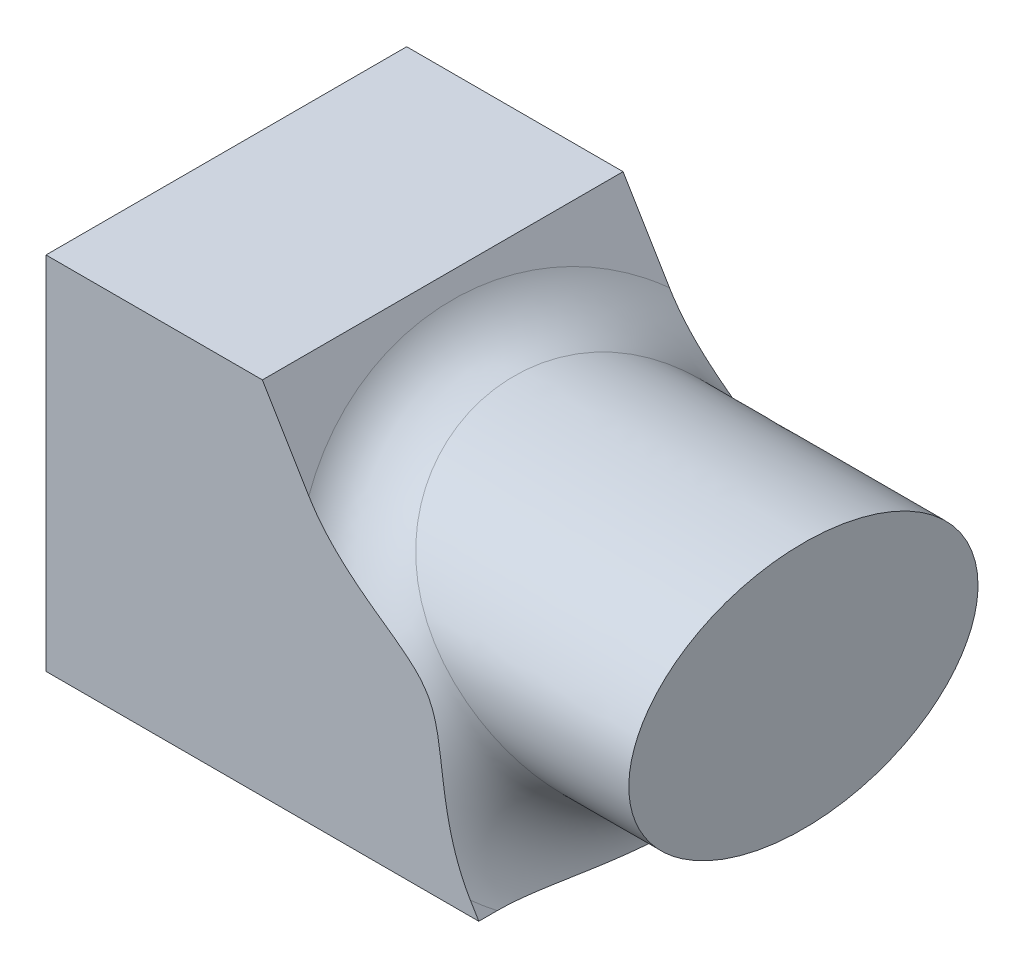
ISO-10303-21;
HEADER;
FILE_DESCRIPTION(('STEP AP214'),'2;1');
FILE_NAME('part.step','',(''),(''),'','','');
FILE_SCHEMA(('AUTOMOTIVE_DESIGN { 1 0 10303 214 1 1 1 1 }'));
ENDSEC;
DATA;
#1=APPLICATION_CONTEXT('core data for automotive mechanical design processes');
#2=APPLICATION_PROTOCOL_DEFINITION('international standard','automotive_design',2000,#1);
#3=PRODUCT_CONTEXT('',#1,'mechanical');
#4=PRODUCT('Part','Part','',(#3));
#5=PRODUCT_RELATED_PRODUCT_CATEGORY('part','',(#4));
#6=PRODUCT_DEFINITION_FORMATION('','',#4);
#7=PRODUCT_DEFINITION_CONTEXT('part definition',#1,'design');
#8=PRODUCT_DEFINITION('design','',#6,#7);
#9=PRODUCT_DEFINITION_SHAPE('','',#8);
#10=(LENGTH_UNIT() NAMED_UNIT(*) SI_UNIT(.MILLI.,.METRE.));
#11=(NAMED_UNIT(*) PLANE_ANGLE_UNIT() SI_UNIT($,.RADIAN.));
#12=(NAMED_UNIT(*) SI_UNIT($,.STERADIAN.) SOLID_ANGLE_UNIT());
#13=UNCERTAINTY_MEASURE_WITH_UNIT(LENGTH_MEASURE(1.E-05),#10,'distance_accuracy_value','');
#14=(GEOMETRIC_REPRESENTATION_CONTEXT(3) GLOBAL_UNCERTAINTY_ASSIGNED_CONTEXT((#13)) GLOBAL_UNIT_ASSIGNED_CONTEXT((#10,
#11,#12)) REPRESENTATION_CONTEXT('',''));
#15=CARTESIAN_POINT('',(0.,0.,0.));
#16=DIRECTION('',(0.,0.,1.));
#17=DIRECTION('',(1.,0.,0.));
#18=AXIS2_PLACEMENT_3D('',#15,#16,#17);
#19=CARTESIAN_POINT('',(60.,0.,25.));
#20=DIRECTION('',(-0.857492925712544,-0.514495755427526,0.));
#21=DIRECTION('',(0.514495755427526,-0.857492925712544,0.));
#22=AXIS2_PLACEMENT_3D('',#19,#20,#21);
#23=PLANE('',#22);
#24=DIRECTION('',(-0.514495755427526,0.857492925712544,0.));
#25=VECTOR('',#24,1.);
#26=CARTESIAN_POINT('',(60.,0.,-25.));
#27=LINE('',#26,#25);
#28=CARTESIAN_POINT('',(60.,0.,-25.));
#29=VERTEX_POINT('',#28);
#30=CARTESIAN_POINT('',(58.8337867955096,1.9436886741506,-25.));
#31=VERTEX_POINT('',#30);
#32=EDGE_CURVE('E113',#29,#31,#27,.T.);
#33=ORIENTED_EDGE('',*,*,#32,.T.);
#34=CARTESIAN_POINT('',(61.0989201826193,21.2138348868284,-23.3401120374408));
#35=CARTESIAN_POINT('',(56.9970875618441,19.073266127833,-22.5117894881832));
#36=CARTESIAN_POINT('',(54.379736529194,16.4013118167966,-25.3584221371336));
#37=CARTESIAN_POINT('',(51.7623854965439,13.7293575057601,-28.205054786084));
#38=CARTESIAN_POINT('',(52.5239909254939,12.4600151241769,-32.666210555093));
#39=CARTESIAN_POINT('',(60.6772421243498,21.6170960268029,-23.4961611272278));
#40=CARTESIAN_POINT('',(56.6300190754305,19.4507669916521,-22.7367688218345));
#41=CARTESIAN_POINT('',(54.0216388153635,16.8807854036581,-25.6087039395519));
#42=CARTESIAN_POINT('',(51.4145763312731,14.3090394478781,-28.4797171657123));
#43=CARTESIAN_POINT('',(52.1023128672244,13.1628118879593,-32.9381700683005));
#44=CARTESIAN_POINT('',(60.2495863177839,22.0216000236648,-23.6303638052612));
#45=CARTESIAN_POINT('',(56.2554228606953,19.8369132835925,-22.9436417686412));
#46=CARTESIAN_POINT('',(53.6566925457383,17.3699308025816,-25.8359177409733));
#47=CARTESIAN_POINT('',(51.0593464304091,14.9010892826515,-28.7274364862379));
#48=CARTESIAN_POINT('',(51.6746570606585,13.8755715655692,-33.1750238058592));
#49=CARTESIAN_POINT('',(59.3854193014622,22.8319114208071,-23.8563250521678));
#50=CARTESIAN_POINT('',(55.4947851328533,20.6247988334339,-23.318075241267));
#51=CARTESIAN_POINT('',(52.9153466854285,18.3655862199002,-26.2417084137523));
#52=CARTESIAN_POINT('',(50.3372863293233,16.1045227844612,-29.1645868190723));
#53=CARTESIAN_POINT('',(50.8104900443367,15.3158499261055,-33.5766523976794));
#54=CARTESIAN_POINT('',(58.9489085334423,23.2377187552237,-23.9480857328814));
#55=CARTESIAN_POINT('',(55.1087992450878,21.0264664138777,-23.4857774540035));
#56=CARTESIAN_POINT('',(52.5389476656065,18.8720953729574,-26.4202877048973));
#57=CARTESIAN_POINT('',(49.9705116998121,16.7158138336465,-29.3542298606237));
#58=CARTESIAN_POINT('',(50.3739792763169,16.0433678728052,-33.741430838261));
#59=CARTESIAN_POINT('',(58.0702658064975,24.0498835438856,-24.0901699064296));
#60=CARTESIAN_POINT('',(54.3281006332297,21.8445119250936,-23.7795344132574));
#61=CARTESIAN_POINT('',(51.7772433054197,19.900044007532,-26.7262884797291));
#62=CARTESIAN_POINT('',(49.227796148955,17.9536730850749,-29.6724754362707));
#63=CARTESIAN_POINT('',(49.495336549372,17.5077724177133,-33.9976195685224));
#64=CARTESIAN_POINT('',(57.6281343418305,24.4562409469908,-24.1404970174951));
#65=CARTESIAN_POINT('',(53.9334122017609,22.2608433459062,-23.9057499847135));
#66=CARTESIAN_POINT('',(51.3919387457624,20.4214821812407,-26.8537144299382));
#67=CARTESIAN_POINT('',(48.8518816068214,18.5801973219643,-29.8013124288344));
#68=CARTESIAN_POINT('',(49.0532050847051,18.2446581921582,-34.0890362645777));
#69=CARTESIAN_POINT('',(56.7414630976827,25.2691491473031,-24.2003414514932));
#70=CARTESIAN_POINT('',(53.1381831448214,23.1069449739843,-24.1140277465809));
#71=CARTESIAN_POINT('',(50.6151415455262,21.4765048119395,-27.0550082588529));
#72=CARTESIAN_POINT('',(48.0935111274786,19.8441481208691,-29.9956225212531));
#73=CARTESIAN_POINT('',(48.1665338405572,19.7224435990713,-34.1978263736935));
#74=CARTESIAN_POINT('',(56.2969233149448,25.6756999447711,-24.2098587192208));
#75=CARTESIAN_POINT('',(52.7376337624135,23.5366983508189,-24.1962578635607));
#76=CARTESIAN_POINT('',(50.2236488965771,22.0100892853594,-27.1288760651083));
#77=CARTESIAN_POINT('',(47.7110503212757,20.4815827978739,-30.061332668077));
#78=CARTESIAN_POINT('',(47.7219940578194,20.4633432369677,-34.2151996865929));
#79=CARTESIAN_POINT('',(55.4162325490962,26.4818554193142,-24.1883866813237));
#80=CARTESIAN_POINT('',(51.9405505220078,24.4004605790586,-24.3129615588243));
#81=CARTESIAN_POINT('',(49.4440797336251,23.077023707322,-27.2200423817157));
#82=CARTESIAN_POINT('',(46.9489447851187,21.7517586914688,-30.1269664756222));
#83=CARTESIAN_POINT('',(46.8413032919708,21.9311611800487,-34.1761056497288));
#84=CARTESIAN_POINT('',(54.9800668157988,26.8814613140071,-24.1580795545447));
#85=CARTESIAN_POINT('',(51.5440485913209,24.8342615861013,-24.3483799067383));
#86=CARTESIAN_POINT('',(49.0560573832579,23.6102250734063,-27.2382762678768));
#87=CARTESIAN_POINT('',(46.5693511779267,22.3844147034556,-30.1282050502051));
#88=CARTESIAN_POINT('',(46.4051375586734,22.6581040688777,-34.1208818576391));
#89=CARTESIAN_POINT('',(54.1116894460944,27.6803147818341,-24.0577741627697));
#90=CARTESIAN_POINT('',(50.7514221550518,25.7108103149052,-24.3715922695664));
#91=CARTESIAN_POINT('',(48.2798244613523,24.6816993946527,-27.2189830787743));
#92=CARTESIAN_POINT('',(45.8095079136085,23.6508201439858,-30.066405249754));
#93=CARTESIAN_POINT('',(45.5367601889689,24.1053996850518,-33.9391578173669));
#94=CARTESIAN_POINT('',(53.679477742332,28.0795623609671,-23.9877765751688));
#95=CARTESIAN_POINT('',(50.3552340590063,26.153597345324,-24.359545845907));
#96=CARTESIAN_POINT('',(47.8916138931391,25.2199722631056,-27.1814569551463));
#97=CARTESIAN_POINT('',(45.429200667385,24.2846655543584,-30.0035749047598));
#98=CARTESIAN_POINT('',(45.1045484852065,24.8257525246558,-33.8126587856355));
#99=CARTESIAN_POINT('',(52.8221186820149,28.8771483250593,-23.80731185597));
#100=CARTESIAN_POINT('',(49.5663768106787,27.0453004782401,-24.285587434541));
#101=CARTESIAN_POINT('',(47.1180614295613,26.2976972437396,-27.0491895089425));
#102=CARTESIAN_POINT('',(44.670949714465,25.5484171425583,-29.8129969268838));
#103=CARTESIAN_POINT('',(44.2471894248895,26.2546842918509,-33.4893456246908));
#104=CARTESIAN_POINT('',(52.3969706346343,29.275486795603,-23.6968487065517));
#105=CARTESIAN_POINT('',(49.1736219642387,27.4942810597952,-24.2238282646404));
#106=CARTESIAN_POINT('',(46.7327192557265,26.8371492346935,-26.9544538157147));
#107=CARTESIAN_POINT('',(44.2929269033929,26.1784551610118,-29.6854393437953));
#108=CARTESIAN_POINT('',(43.8220413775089,26.9632643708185,-33.2925384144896));
#109=CARTESIAN_POINT('',(51.5567005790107,30.0703993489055,-23.4343650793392));
#110=CARTESIAN_POINT('',(48.3947069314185,28.3951426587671,-24.0485390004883));
#111=CARTESIAN_POINT('',(45.9679206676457,27.9131487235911,-26.7067956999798));
#112=CARTESIAN_POINT('',(43.5422423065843,27.4295961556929,-29.3654107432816));
#113=CARTESIAN_POINT('',(42.9817713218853,28.3637144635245,-32.8301066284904));
#114=CARTESIAN_POINT('',(51.141578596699,30.4669734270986,-23.2823444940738));
#115=CARTESIAN_POINT('',(48.0084444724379,28.8471115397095,-23.935139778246));
#116=CARTESIAN_POINT('',(45.5884642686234,28.4496962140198,-26.5538731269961));
#117=CARTESIAN_POINT('',(43.1694848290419,28.0508586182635,-29.1730931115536));
#118=CARTESIAN_POINT('',(42.5666493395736,29.055584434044,-32.5644818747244));
#119=CARTESIAN_POINT('',(50.3242467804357,31.2569782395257,-22.9355344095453));
#120=CARTESIAN_POINT('',(47.2455679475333,29.7502519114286,-23.6551408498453));
#121=CARTESIAN_POINT('',(44.8384564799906,29.5155490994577,-26.189445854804));
#122=CARTESIAN_POINT('',(42.4323440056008,29.279426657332,-28.7242359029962));
#123=CARTESIAN_POINT('',(41.7493175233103,30.4178041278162,-31.9664748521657));
#124=CARTESIAN_POINT('',(49.9220375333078,31.6504088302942,-22.7407429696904));
#125=CARTESIAN_POINT('',(46.8688407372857,30.2015295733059,-23.4886479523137));
#126=CARTESIAN_POINT('',(44.4679054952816,30.0448541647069,-25.977938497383));
#127=CARTESIAN_POINT('',(42.0678538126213,29.8869103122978,-28.4678124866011));
#128=CARTESIAN_POINT('',(41.3471082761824,31.0881528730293,-31.6340895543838));
#129=CARTESIAN_POINT('',(49.1333071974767,32.4321471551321,-22.3072972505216));
#130=CARTESIAN_POINT('',(46.1280168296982,31.0991857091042,-23.1016782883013));
#131=CARTESIAN_POINT('',(43.7386792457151,31.0917061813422,-25.4966405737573));
#132=CARTESIAN_POINT('',(41.3502238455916,31.0829602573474,-27.8921848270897));
#133=CARTESIAN_POINT('',(40.5583779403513,32.4027034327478,-30.9052232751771));
#134=CARTESIAN_POINT('',(48.7467860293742,32.8204549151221,-22.0686431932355));
#135=CARTESIAN_POINT('',(45.7638010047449,31.5456833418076,-22.8812859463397));
#136=CARTESIAN_POINT('',(43.3800039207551,31.6092531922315,-25.2268503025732));
#137=CARTESIAN_POINT('',(40.9969708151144,31.6717153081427,-27.5730637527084));
#138=CARTESIAN_POINT('',(40.1718567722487,33.0469053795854,-30.5087426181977));
#139=CARTESIAN_POINT('',(47.9919919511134,33.589424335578,-21.5467163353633));
#140=CARTESIAN_POINT('',(45.0507954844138,32.4294487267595,-22.3864979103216));
#141=CARTESIAN_POINT('',(42.6773351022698,32.6280794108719,-24.6300342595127));
#142=CARTESIAN_POINT('',(40.3046376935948,32.8256038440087,-26.8742184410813));
#143=CARTESIAN_POINT('',(39.4170626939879,34.3048955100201,-29.6549051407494));
#144=CARTESIAN_POINT('',(47.6237186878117,33.9700861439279,-21.2634443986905));
#145=CARTESIAN_POINT('',(44.7018863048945,32.8668429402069,-22.1121608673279));
#146=CARTESIAN_POINT('',(42.3333413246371,33.1293589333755,-24.303009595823));
#147=CARTESIAN_POINT('',(39.9654433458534,33.3909277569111,-26.4945427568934));
#148=CARTESIAN_POINT('',(39.0487894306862,34.9186842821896,-29.1975494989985));
#149=CARTESIAN_POINT('',(46.9077186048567,34.7207732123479,-20.6520693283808));
#150=CARTESIAN_POINT('',(44.0220447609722,33.7279857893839,-21.5103014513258));
#151=CARTESIAN_POINT('',(41.6626154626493,34.1112722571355,-23.5935381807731));
#152=CARTESIAN_POINT('',(39.3038324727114,34.493612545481,-25.677458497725));
#153=CARTESIAN_POINT('',(38.3327893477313,36.1120177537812,-28.2256790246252));
#154=CARTESIAN_POINT('',(46.5599920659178,35.0907983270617,-20.3239655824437));
#155=CARTESIAN_POINT('',(43.6909979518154,34.1518619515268,-21.1828098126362));
#156=CARTESIAN_POINT('',(41.3358836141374,34.5919057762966,-23.2110906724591));
#157=CARTESIAN_POINT('',(38.9813059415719,35.0311567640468,-25.2400639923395));
#158=CARTESIAN_POINT('',(37.9850628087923,36.6915619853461,-27.7111634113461));
#159=CARTESIAN_POINT('',(45.8815174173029,35.8229026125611,-19.6175989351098));
#160=CARTESIAN_POINT('',(43.0438373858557,34.9884806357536,-20.4704623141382));
#161=CARTESIAN_POINT('',(40.6967382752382,35.5361552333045,-22.3865410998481));
#162=CARTESIAN_POINT('',(38.350193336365,36.0830111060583,-24.3033346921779));
#163=CARTESIAN_POINT('',(37.3065881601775,37.8223530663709,-26.620131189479));
#164=CARTESIAN_POINT('',(45.5511477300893,36.1847473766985,-19.2385927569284));
#165=CARTESIAN_POINT('',(42.7279432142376,35.4010618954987,-20.0847407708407));
#166=CARTESIAN_POINT('',(40.38465317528,35.9993553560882,-21.9435529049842));
#167=CARTESIAN_POINT('',(38.0418120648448,36.5969798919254,-23.8030639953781));
#168=CARTESIAN_POINT('',(36.9762184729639,38.3729692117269,-26.0427259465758));
#169=CARTESIAN_POINT('',(44.9155485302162,36.8902843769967,-18.4361245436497));
#170=CARTESIAN_POINT('',(42.119171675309,36.2032128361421,-19.2627257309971));
#171=CARTESIAN_POINT('',(39.7828596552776,36.8961104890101,-21.0063751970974));
#172=CARTESIAN_POINT('',(37.4469961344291,37.5883397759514,-22.7507232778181));
#173=CARTESIAN_POINT('',(36.3406192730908,39.4323012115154,-24.8378605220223));
#174=CARTESIAN_POINT('',(44.6103191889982,37.233976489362,-18.0126622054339));
#175=CARTESIAN_POINT('',(41.8261939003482,36.5929039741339,-18.8264176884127));
#176=CARTESIAN_POINT('',(39.4931513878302,37.3296652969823,-20.5121853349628));
#177=CARTESIAN_POINT('',(37.16046417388,38.0658930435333,-22.1986154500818));
#178=CARTESIAN_POINT('',(36.0353899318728,39.9410167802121,-24.2103999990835));
#179=CARTESIAN_POINT('',(44.0264240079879,37.8995873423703,-17.1234013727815));
#180=CARTESIAN_POINT('',(41.2649317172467,37.3453217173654,-17.9065756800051));
#181=CARTESIAN_POINT('',(38.9378502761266,38.163657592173,-19.4765373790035));
#182=CARTESIAN_POINT('',(36.6111238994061,38.9814601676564,-21.0471614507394));
#183=CARTESIAN_POINT('',(35.4514947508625,40.9141754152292,-22.9102568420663));
#184=CARTESIAN_POINT('',(43.7477627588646,38.2215023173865,-16.6575955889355));
#185=CARTESIAN_POINT('',(40.9965636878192,37.708153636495,-17.4230016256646));
#186=CARTESIAN_POINT('',(38.6722615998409,38.5640893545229,-18.9350711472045));
#187=CARTESIAN_POINT('',(36.3482342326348,39.4196096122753,-20.4477519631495));
#188=CARTESIAN_POINT('',(35.1728335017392,41.3786108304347,-22.2375664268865));
#189=CARTESIAN_POINT('',(43.2182170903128,38.8400152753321,-15.6866543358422));
#190=CARTESIAN_POINT('',(40.4859623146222,38.4032263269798,-16.4127339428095));
#191=CARTESIAN_POINT('',(38.1667031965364,39.3287219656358,-17.8094122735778));
#192=CARTESIAN_POINT('',(35.8477184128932,40.2538026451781,-19.2067018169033));
#193=CARTESIAN_POINT('',(34.6432878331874,42.2611869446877,-20.8521005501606));
#194=CARTESIAN_POINT('',(42.96733364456,39.1366123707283,-15.1815174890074));
#195=CARTESIAN_POINT('',(40.2436551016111,38.735562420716,-15.8859937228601));
#196=CARTESIAN_POINT('',(37.9267343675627,39.6929215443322,-17.2252181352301));
#197=CARTESIAN_POINT('',(35.6100202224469,40.6499662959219,-18.5649926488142));
#198=CARTESIAN_POINT('',(34.3924043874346,42.6793260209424,-20.1393236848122));
#199=CARTESIAN_POINT('',(42.4804286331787,39.7177918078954,-14.1049726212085));
#200=CARTESIAN_POINT('',(39.772936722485,39.3849701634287,-14.7620743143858));
#201=CARTESIAN_POINT('',(37.4603474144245,40.4026699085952,-15.9836947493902));
#202=CARTESIAN_POINT('',(35.1479894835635,41.4200175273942,-17.2059309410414));
#203=CARTESIAN_POINT('',(33.9054993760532,43.4908343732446,-18.636135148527));
#204=CARTESIAN_POINT('',(42.2461258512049,40.0006659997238,-13.5314179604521));
#205=CARTESIAN_POINT('',(39.5460740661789,39.7001357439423,-14.1624849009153));
#206=CARTESIAN_POINT('',(37.2355345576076,40.7458940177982,-15.324087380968));
#207=CARTESIAN_POINT('',(34.9251607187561,41.7913988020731,-16.4862257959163));
#208=CARTESIAN_POINT('',(33.6711965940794,43.8813390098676,-17.8436199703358));
#209=CARTESIAN_POINT('',(41.8103639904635,40.5312657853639,-12.3490383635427));
#210=CARTESIAN_POINT('',(39.1237967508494,40.2897909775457,-12.9257419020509));
#211=CARTESIAN_POINT('',(36.8169074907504,41.3865357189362,-13.9682097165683));
#212=CARTESIAN_POINT('',(34.5101834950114,42.4830275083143,-15.0112134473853));
#213=CARTESIAN_POINT('',(33.2354347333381,44.6076087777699,-16.2252125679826));
#214=CARTESIAN_POINT('',(41.6089059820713,40.7789902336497,-11.7402122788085));
#215=CARTESIAN_POINT('',(38.9283238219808,40.5643595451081,-12.2885158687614));
#216=CARTESIAN_POINT('',(36.6230942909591,41.6839518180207,-13.271938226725));
#217=CARTESIAN_POINT('',(34.3179779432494,42.8033700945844,-14.2558128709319));
#218=CARTESIAN_POINT('',(33.0339767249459,44.9433721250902,-15.3993192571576));
#219=CARTESIAN_POINT('',(41.2392876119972,41.2366603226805,-10.4923058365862));
#220=CARTESIAN_POINT('',(38.5694542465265,41.0705246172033,-10.9822054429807));
#221=CARTESIAN_POINT('',(36.2671527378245,42.2312123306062,-11.8484481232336));
#222=CARTESIAN_POINT('',(33.9649642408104,43.391726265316,-12.7151431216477));
#223=CARTESIAN_POINT('',(32.6643583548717,45.5594027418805,-13.719619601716));
#224=CARTESIAN_POINT('',(41.0711361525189,41.4465958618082,-9.85321744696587));
#225=CARTESIAN_POINT('',(38.406019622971,41.3021738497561,-10.3130375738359));
#226=CARTESIAN_POINT('',(36.1050328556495,42.4810440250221,-11.1212212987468));
#227=CARTESIAN_POINT('',(33.8041187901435,43.6598020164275,-11.9297726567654));
#228=CARTESIAN_POINT('',(32.4962068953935,45.8396551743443,-12.865805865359));
#229=CARTESIAN_POINT('',(40.7685055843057,41.8264814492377,-8.55030457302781));
#230=CARTESIAN_POINT('',(38.111738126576,41.72061784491,-8.94889258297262));
#231=CARTESIAN_POINT('',(35.8130372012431,42.9316909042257,-9.64180759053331));
#232=CARTESIAN_POINT('',(33.5144086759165,44.1426522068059,-10.3350901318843));
#233=CARTESIAN_POINT('',(32.1935763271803,46.3440394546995,-11.1358903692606));
#234=CARTESIAN_POINT('',(40.6340295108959,41.9964278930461,-7.88647786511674));
#235=CARTESIAN_POINT('',(37.9808587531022,41.9074582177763,-8.25383673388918));
#236=CARTESIAN_POINT('',(35.6831643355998,43.1325016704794,-8.88961846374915));
#237=CARTESIAN_POINT('',(33.385512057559,44.3574799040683,-9.52568350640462));
#238=CARTESIAN_POINT('',(32.0591002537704,46.568166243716,-10.2597866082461));
#239=CARTESIAN_POINT('',(40.3885859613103,42.3078417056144,-6.48021994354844));
#240=CARTESIAN_POINT('',(37.7419083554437,42.2493701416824,-6.78167730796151));
#241=CARTESIAN_POINT('',(35.4459932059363,43.4996170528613,-7.29886494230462));
#242=CARTESIAN_POINT('',(33.1501281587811,44.7497864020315,-7.81638788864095));
#243=CARTESIAN_POINT('',(31.8136567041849,46.9772388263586,-8.41253881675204));
#244=CARTESIAN_POINT('',(40.2807367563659,42.4454767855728,-5.73601881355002));
#245=CARTESIAN_POINT('',(37.6368298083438,42.4002392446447,-6.00262221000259));
#246=CARTESIAN_POINT('',(35.3416950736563,43.6613180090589,-6.45853242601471));
#247=CARTESIAN_POINT('',(33.0465833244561,44.9223611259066,-6.91467103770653));
#248=CARTESIAN_POINT('',(31.7058074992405,47.1569875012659,-7.43982600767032));
#249=CARTESIAN_POINT('',(40.1052868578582,42.6699683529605,-4.23203902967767));
#250=CARTESIAN_POINT('',(37.4658609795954,42.6460861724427,-4.42850015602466));
#251=CARTESIAN_POINT('',(35.1719615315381,43.9246567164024,-4.76242893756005));
#252=CARTESIAN_POINT('',(32.8780847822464,45.2031920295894,-5.09658583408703));
#253=CARTESIAN_POINT('',(31.5303576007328,47.4494039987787,-5.48077641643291));
#254=CARTESIAN_POINT('',(40.0376883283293,42.756822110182,-3.47225954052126));
#255=CARTESIAN_POINT('',(37.3999511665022,42.7410919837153,-3.63333452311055));
#256=CARTESIAN_POINT('',(35.1065282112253,44.0262912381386,-3.90665713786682));
#257=CARTESIAN_POINT('',(32.8131118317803,45.3114802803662,-4.18010268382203));
#258=CARTESIAN_POINT('',(31.4627590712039,47.5620682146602,-4.49443890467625));
#259=CARTESIAN_POINT('',(39.9427852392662,42.8788851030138,-1.94400583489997));
#260=CARTESIAN_POINT('',(37.3074199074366,42.8745521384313,-2.03413192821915));
#261=CARTESIAN_POINT('',(35.0146518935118,44.1690391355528,-2.18649714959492));
#262=CARTESIAN_POINT('',(32.721890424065,45.4635159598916,-2.33898508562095));
#263=CARTESIAN_POINT('',(31.3678559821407,47.7202400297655,-2.51409661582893));
#264=CARTESIAN_POINT('',(39.9154958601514,42.9140748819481,-1.17552845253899));
#265=CARTESIAN_POINT('',(37.2808019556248,42.9130014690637,-1.2299946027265));
#266=CARTESIAN_POINT('',(34.9882235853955,44.2101297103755,-1.32210583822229));
#267=CARTESIAN_POINT('',(32.6956454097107,45.5072576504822,-1.4142355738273));
#268=CARTESIAN_POINT('',(31.340566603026,47.76572232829,-1.5200890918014));
#269=CARTESIAN_POINT('',(39.9012779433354,42.9324003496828,0.362675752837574));
#270=CARTESIAN_POINT('',(37.2669361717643,42.9330249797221,0.379469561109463));
#271=CARTESIAN_POINT('',(34.9744551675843,44.2315340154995,0.407905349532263));
#272=CARTESIAN_POINT('',(32.6819742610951,45.5300428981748,0.43632291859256));
#273=CARTESIAN_POINT('',(31.32634868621,47.7894188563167,0.469002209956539));
#274=CARTESIAN_POINT('',(39.9143496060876,42.9155357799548,1.13240258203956));
#275=CARTESIAN_POINT('',(37.2796868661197,42.9146012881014,1.18489312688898));
#276=CARTESIAN_POINT('',(34.9871152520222,44.2118474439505,1.27352523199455));
#277=CARTESIAN_POINT('',(32.6945466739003,45.5090888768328,1.36224312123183));
#278=CARTESIAN_POINT('',(31.3394203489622,47.7676327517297,1.46408599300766));
#279=CARTESIAN_POINT('',(39.9829042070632,42.8272642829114,2.71339442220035));
#280=CARTESIAN_POINT('',(37.3465365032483,42.8181203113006,2.83920811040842));
#281=CARTESIAN_POINT('',(35.0534934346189,44.1086846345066,3.05232387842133));
#282=CARTESIAN_POINT('',(32.7604541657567,45.3992430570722,3.26553677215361));
#283=CARTESIAN_POINT('',(31.4079749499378,47.6533750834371,3.51054465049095));
#284=CARTESIAN_POINT('',(40.040957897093,42.7525514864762,3.52428716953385));
#285=CARTESIAN_POINT('',(37.403150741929,42.7364355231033,3.68781741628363));
#286=CARTESIAN_POINT('',(35.109700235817,44.0213418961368,3.96513626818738));
#287=CARTESIAN_POINT('',(32.8162689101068,45.3062184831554,4.24267776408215));
#288=CARTESIAN_POINT('',(31.4660286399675,47.5566189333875,4.5615984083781));
#289=CARTESIAN_POINT('',(40.2025158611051,42.5454560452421,5.13089492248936));
#290=CARTESIAN_POINT('',(37.5606136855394,42.5097675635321,5.36924172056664));
#291=CARTESIAN_POINT('',(35.2660336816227,43.7786712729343,5.77575201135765));
#292=CARTESIAN_POINT('',(32.971472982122,45.0475450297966,6.18248537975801));
#293=CARTESIAN_POINT('',(31.6275866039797,47.2873556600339,6.65049168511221));
#294=CARTESIAN_POINT('',(40.3060224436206,42.4130704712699,5.92660915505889));
#295=CARTESIAN_POINT('',(37.6614868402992,42.364749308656,6.20217279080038));
#296=CARTESIAN_POINT('',(35.3661625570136,43.6233399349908,6.67355460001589));
#297=CARTESIAN_POINT('',(33.0708864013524,44.8818559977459,7.14528702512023));
#298=CARTESIAN_POINT('',(31.7310931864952,47.1148446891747,7.68833053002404));
#299=CARTESIAN_POINT('',(40.5583649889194,42.0921934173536,7.49428428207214));
#300=CARTESIAN_POINT('',(37.9072177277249,42.0126785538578,7.84326142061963));
#301=CARTESIAN_POINT('',(35.6100748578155,43.2455597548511,8.44549591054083));
#302=CARTESIAN_POINT('',(33.3129804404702,44.4783659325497,9.04808140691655));
#303=CARTESIAN_POINT('',(31.983435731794,46.6942737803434,9.74307276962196));
#304=CARTESIAN_POINT('',(40.7072029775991,41.9036994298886,8.26624411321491));
#305=CARTESIAN_POINT('',(38.0521139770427,41.8055713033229,8.6515357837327));
#306=CARTESIAN_POINT('',(35.753860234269,43.0231079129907,9.31963357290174));
#307=CARTESIAN_POINT('',(33.4556989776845,44.2405017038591,9.98821218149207));
#308=CARTESIAN_POINT('',(32.1322737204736,46.4462104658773,10.7599752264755));
#309=CARTESIAN_POINT('',(41.0499390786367,41.4729951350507,9.77780244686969));
#310=CARTESIAN_POINT('',(38.3854355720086,41.3313068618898,10.2341299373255));
#311=CARTESIAN_POINT('',(36.084603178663,42.5125053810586,11.0353016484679));
#312=CARTESIAN_POINT('',(33.7838637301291,43.6935604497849,11.8369544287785));
#313=CARTESIAN_POINT('',(32.4750098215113,45.8749836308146,12.7647002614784));
#314=CARTESIAN_POINT('',(41.2438355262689,41.2307868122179,10.517402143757));
#315=CARTESIAN_POINT('',(38.573912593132,41.0640771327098,11.0085689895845));
#316=CARTESIAN_POINT('',(36.2715591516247,42.2243571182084,11.8768332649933));
#317=CARTESIAN_POINT('',(33.9693607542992,43.3843987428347,12.7457094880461));
#318=CARTESIAN_POINT('',(32.6689062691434,45.5518228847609,13.752523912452));
#319=CARTESIAN_POINT('',(41.6727406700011,40.7002301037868,11.9443859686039));
#320=CARTESIAN_POINT('',(38.9902959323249,40.4771366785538,12.5022866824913));
#321=CARTESIAN_POINT('',(36.6845357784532,41.5895788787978,13.5051214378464));
#322=CARTESIAN_POINT('',(34.3789261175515,42.7017898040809,14.5085489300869));
#323=CARTESIAN_POINT('',(33.0978114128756,44.8369809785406,15.6751586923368));
#324=CARTESIAN_POINT('',(41.9070420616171,40.4126818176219,12.6324161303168));
#325=CARTESIAN_POINT('',(39.217595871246,40.1582337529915,13.2223692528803));
#326=CARTESIAN_POINT('',(36.9098836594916,41.2439581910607,14.2925388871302));
#327=CARTESIAN_POINT('',(34.6024012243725,42.3293312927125,15.3634240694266));
#328=CARTESIAN_POINT('',(33.3321128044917,44.4464786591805,16.6105650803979));
#329=CARTESIAN_POINT('',(42.4180319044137,39.7928275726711,13.96151200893));
#330=CARTESIAN_POINT('',(39.7125557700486,39.4686576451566,14.6121979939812));
#331=CARTESIAN_POINT('',(37.400510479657,40.4939252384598,15.8183807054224));
#332=CARTESIAN_POINT('',(35.0886955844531,41.5188406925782,17.025278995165));
#333=CARTESIAN_POINT('',(33.8431026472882,43.5948289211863,18.4366770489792));
#334=CARTESIAN_POINT('',(42.6947209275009,39.4605210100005,14.6025770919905));
#335=CARTESIAN_POINT('',(39.9803077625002,39.0978604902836,15.2820467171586));
#336=CARTESIAN_POINT('',(37.6657899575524,40.0895121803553,16.5568044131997));
#337=CARTESIAN_POINT('',(35.3516049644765,41.0806583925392,17.8323931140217));
#338=CARTESIAN_POINT('',(34.1197916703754,43.1336805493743,19.3273820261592));
#339=CARTESIAN_POINT('',(43.2892439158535,38.7561892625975,15.8307983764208));
#340=CARTESIAN_POINT('',(40.5545627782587,38.3092447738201,16.5630746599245));
#341=CARTESIAN_POINT('',(38.234617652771,39.2257038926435,17.975997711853));
#342=CARTESIAN_POINT('',(35.9150058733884,40.141656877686,19.3897517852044));
#343=CARTESIAN_POINT('',(34.714314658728,42.14280890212,21.055270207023));
#344=CARTESIAN_POINT('',(43.6070738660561,38.3841679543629,16.4179598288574));
#345=CARTESIAN_POINT('',(40.8611784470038,37.8912781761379,17.1743491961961));
#346=CARTESIAN_POINT('',(38.5381621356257,38.7663140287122,18.6567729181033));
#347=CARTESIAN_POINT('',(36.2156074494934,39.6406542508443,20.1401277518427));
#348=CARTESIAN_POINT('',(35.0321446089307,41.6130923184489,21.8924586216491));
#349=CARTESIAN_POINT('',(44.2821260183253,37.6062189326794,17.5326152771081));
#350=CARTESIAN_POINT('',(41.5109793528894,37.0141270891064,18.3307402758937));
#351=CARTESIAN_POINT('',(39.181279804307,37.7973762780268,19.9525484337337));
#352=CARTESIAN_POINT('',(36.8520424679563,38.5799292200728,21.5752868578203));
#353=CARTESIAN_POINT('',(35.7071967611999,40.4880053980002,23.5044900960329));
#354=CARTESIAN_POINT('',(44.6393431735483,37.200295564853,18.0601168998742));
#355=CARTESIAN_POINT('',(41.8543034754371,36.5547657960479,18.8759320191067));
#356=CARTESIAN_POINT('',(39.5208483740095,37.2878348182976,20.5675571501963));
#357=CARTESIAN_POINT('',(37.1880111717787,38.0199813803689,22.2601849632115));
#358=CARTESIAN_POINT('',(36.0644139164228,39.8926434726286,24.2793411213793));
#359=CARTESIAN_POINT('',(45.3592999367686,36.3960489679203,19.0096971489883));
#360=CARTESIAN_POINT('',(42.5444251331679,35.6416383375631,19.8511878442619));
#361=CARTESIAN_POINT('',(40.2032495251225,36.2690458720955,21.6760731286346));
#362=CARTESIAN_POINT('',(37.8625925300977,36.8956791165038,23.5018018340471));
#363=CARTESIAN_POINT('',(36.7843706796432,38.692715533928,25.6960931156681));
#364=CARTESIAN_POINT('',(45.7190737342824,35.9999343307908,19.4369044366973));
#365=CARTESIAN_POINT('',(42.8887087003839,35.1903952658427,20.2871603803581));
#366=CARTESIAN_POINT('',(40.5434290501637,35.7633448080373,22.1754417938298));
#367=CARTESIAN_POINT('',(38.1988070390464,36.3353216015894,24.0645931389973));
#368=CARTESIAN_POINT('',(37.1441444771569,38.0930925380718,26.3436936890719));
#369=CARTESIAN_POINT('',(46.4673820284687,35.1894996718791,20.2357017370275));
#370=CARTESIAN_POINT('',(43.6028860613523,34.264802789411,21.0946784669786));
#371=CARTESIAN_POINT('',(41.2488401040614,34.7200111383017,23.1081786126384));
#372=CARTESIAN_POINT('',(38.8954525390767,35.1742457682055,25.1225489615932));
#373=CARTESIAN_POINT('',(37.8924527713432,36.8459120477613,27.5729583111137));
#374=CARTESIAN_POINT('',(46.8559182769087,34.7751785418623,20.6072883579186));
#375=CARTESIAN_POINT('',(43.9729301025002,33.7902781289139,21.4662136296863));
#376=CARTESIAN_POINT('',(41.6140731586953,34.1823765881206,23.5415427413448));
#377=CARTESIAN_POINT('',(39.2560286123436,34.5732856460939,25.6177322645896));
#378=CARTESIAN_POINT('',(38.2809890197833,36.1983516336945,28.1546183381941));
#379=CARTESIAN_POINT('',(47.6579844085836,33.9340670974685,21.2932405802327));
#380=CARTESIAN_POINT('',(44.7345181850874,32.8254307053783,22.1416441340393));
#381=CARTESIAN_POINT('',(42.3654573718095,33.0823028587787,24.3376151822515));
#382=CARTESIAN_POINT('',(39.9972062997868,33.3379895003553,26.5344444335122));
#383=CARTESIAN_POINT('',(39.0830551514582,34.8615747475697,29.2447924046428));
#384=CARTESIAN_POINT('',(48.0714566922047,33.5073066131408,21.6077317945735));
#385=CARTESIAN_POINT('',(45.1261753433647,32.3349638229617,22.445645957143));
#386=CARTESIAN_POINT('',(42.7515601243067,32.5199215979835,24.7004787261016));
#387=CARTESIAN_POINT('',(40.3779180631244,32.7034698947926,26.956116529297));
#388=CARTESIAN_POINT('',(39.4965274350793,34.1724542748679,29.7534664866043));
#389=CARTESIAN_POINT('',(48.9207373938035,32.644804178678,22.1807257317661));
#390=CARTESIAN_POINT('',(45.9279469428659,31.3436494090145,22.9859283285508));
#391=CARTESIAN_POINT('',(43.5416076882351,31.3756614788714,25.3541071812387));
#392=CARTESIAN_POINT('',(41.156241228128,31.4062646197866,27.7230909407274));
#393=CARTESIAN_POINT('',(40.3458081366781,32.7569864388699,30.6938051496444));
#394=CARTESIAN_POINT('',(49.3565344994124,32.209066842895,22.4392564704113));
#395=CARTESIAN_POINT('',(46.3382200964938,30.8426300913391,23.2221583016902));
#396=CARTESIAN_POINT('',(43.945543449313,30.7937925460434,25.6449081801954));
#397=CARTESIAN_POINT('',(41.5540047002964,30.7433254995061,28.0683603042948));
#398=CARTESIAN_POINT('',(40.781605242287,32.0306579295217,31.1255082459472));
#399=CARTESIAN_POINT('',(50.1672947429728,31.4103305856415,22.8603062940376));
#400=CARTESIAN_POINT('',(47.0984841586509,29.9263065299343,23.5910542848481));
#401=CARTESIAN_POINT('',(44.6938814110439,29.721997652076,26.1078683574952));
#402=CARTESIAN_POINT('',(42.290047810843,29.5165869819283,28.6251596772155));
#403=CARTESIAN_POINT('',(41.5923654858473,30.6793908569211,31.8378229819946));
#404=CARTESIAN_POINT('',(50.5392017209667,31.0482572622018,23.0317272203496));
#405=CARTESIAN_POINT('',(47.4463923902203,29.5114083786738,23.7346836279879));
#406=CARTESIAN_POINT('',(45.0360136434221,29.2342356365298,26.2919441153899));
#407=CARTESIAN_POINT('',(42.6264919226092,28.9558467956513,28.8495996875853));
#408=CARTESIAN_POINT('',(41.9642724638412,30.059545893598,32.1316484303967));
#409=CARTESIAN_POINT('',(51.2936744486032,30.3215332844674,23.3386779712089));
#410=CARTESIAN_POINT('',(48.1499026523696,28.6814504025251,23.9774305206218));
#411=CARTESIAN_POINT('',(45.7275258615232,28.2529944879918,26.6107366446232));
#412=CARTESIAN_POINT('',(43.3060089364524,27.823318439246,29.244439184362));
#413=CARTESIAN_POINT('',(42.7187451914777,28.8020913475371,32.6627678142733));
#414=CARTESIAN_POINT('',(51.6762433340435,29.9568818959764,23.4741971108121));
#415=CARTESIAN_POINT('',(48.5055936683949,28.2663104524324,24.0764472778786));
#416=CARTESIAN_POINT('',(46.0769079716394,27.7595136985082,26.7454387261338));
#417=CARTESIAN_POINT('',(43.6491655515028,27.2513907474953,29.4147259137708));
#418=CARTESIAN_POINT('',(43.1013140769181,28.1644765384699,32.9000449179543));
#419=CARTESIAN_POINT('',(52.5518010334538,29.1296757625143,23.7413606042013));
#420=CARTESIAN_POINT('',(49.317106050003,27.3292408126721,24.2515319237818));
#421=CARTESIAN_POINT('',(46.8733621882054,26.6397420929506,26.9948113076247));
#422=CARTESIAN_POINT('',(44.4311247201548,25.9481254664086,29.7385618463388));
#423=CARTESIAN_POINT('',(43.9768717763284,26.7052137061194,33.3713259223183));
#424=CARTESIAN_POINT('',(53.0472934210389,28.6666724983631,23.8625502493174));
#425=CARTESIAN_POINT('',(49.7743678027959,26.8083286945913,24.3143886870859));
#426=CARTESIAN_POINT('',(47.3218893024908,26.0127604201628,27.0948214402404));
#427=CARTESIAN_POINT('',(44.8710608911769,25.2148985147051,29.8754785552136));
#428=CARTESIAN_POINT('',(44.4723641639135,25.8793930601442,33.5879512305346));
#429=CARTESIAN_POINT('',(54.0470772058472,27.7394590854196,24.0506633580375));
#430=CARTESIAN_POINT('',(50.6926245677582,25.7756813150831,24.3739158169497));
#431=CARTESIAN_POINT('',(48.2220580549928,24.7613686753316,27.2180438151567));
#432=CARTESIAN_POINT('',(45.7531492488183,23.7447512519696,30.0624002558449));
#433=CARTESIAN_POINT('',(45.4721479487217,24.2130867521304,33.9260105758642));
#434=CARTESIAN_POINT('',(54.5513737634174,27.275248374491,24.1175538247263));
#435=CARTESIAN_POINT('',(51.1537475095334,25.2638597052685,24.3703088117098));
#436=CARTESIAN_POINT('',(48.6737014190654,24.1369603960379,27.2412093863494));
#437=CARTESIAN_POINT('',(46.1954184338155,23.0076359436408,30.1120542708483));
#438=CARTESIAN_POINT('',(45.9764445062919,23.3725924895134,34.0473867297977));
#439=CARTESIAN_POINT('',(55.5645567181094,26.3457090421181,24.1980822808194));
#440=CARTESIAN_POINT('',(52.0755239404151,24.2527994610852,24.3004431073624));
#441=CARTESIAN_POINT('',(49.5759499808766,22.8958281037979,27.2131115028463));
#442=CARTESIAN_POINT('',(47.0781513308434,21.5364144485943,30.125725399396));
#443=CARTESIAN_POINT('',(46.9896274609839,21.6839542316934,34.1936762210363));
#444=CARTESIAN_POINT('',(56.073449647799,25.8803798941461,24.2116260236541));
#445=CARTESIAN_POINT('',(52.5362569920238,23.7535425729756,24.2338198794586));
#446=CARTESIAN_POINT('',(50.0265519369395,22.2791196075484,27.1617165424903));
#447=CARTESIAN_POINT('',(47.5186834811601,20.8021941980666,30.0892539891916));
#448=CARTESIAN_POINT('',(47.4985203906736,20.8357993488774,34.2184188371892));
#449=CARTESIAN_POINT('',(57.0899099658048,24.9499155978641,24.185422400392));
#450=CARTESIAN_POINT('',(53.4516812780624,22.7717643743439,24.0416823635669));
#451=CARTESIAN_POINT('',(50.9212632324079,21.0598981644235,26.9874020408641));
#452=CARTESIAN_POINT('',(48.3926864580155,19.3455225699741,29.9327643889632));
#453=CARTESIAN_POINT('',(48.5149807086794,19.1416988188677,34.170707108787));
#454=CARTESIAN_POINT('',(57.5974776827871,24.4847804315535,24.1456898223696));
#455=CARTESIAN_POINT('',(53.906409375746,22.2892429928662,23.9159288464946));
#456=CARTESIAN_POINT('',(51.3653743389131,20.4573813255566,26.8645023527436));
#457=CARTESIAN_POINT('',(48.8261875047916,18.6230208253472,29.8124144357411));
#458=CARTESIAN_POINT('',(49.0225484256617,18.2957526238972,34.0982797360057));
#459=CARTESIAN_POINT('',(58.5353709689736,23.6206289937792,24.0217169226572));
#460=CARTESIAN_POINT('',(54.7419324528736,21.4099316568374,23.6310778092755));
#461=CARTESIAN_POINT('',(52.181097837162,19.3545303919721,26.5728777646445));
#462=CARTESIAN_POINT('',(49.6216363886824,17.2972726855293,29.5141873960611));
#463=CARTESIAN_POINT('',(49.9604417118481,16.7325971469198,33.8740417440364));
#464=CARTESIAN_POINT('',(58.9665081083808,23.2215260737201,23.9445324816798));
#465=CARTESIAN_POINT('',(55.1243202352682,21.0104511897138,23.4789317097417));
#466=CARTESIAN_POINT('',(52.5541122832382,18.8517554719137,26.4130436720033));
#467=CARTESIAN_POINT('',(49.9852499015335,16.6912501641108,29.3464832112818));
#468=CARTESIAN_POINT('',(50.3915788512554,16.0140352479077,33.7348468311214));
#469=CARTESIAN_POINT('',(59.8211970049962,22.424337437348,23.7495175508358));
#470=CARTESIAN_POINT('',(55.8789207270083,20.2262323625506,23.1362493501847));
#471=CARTESIAN_POINT('',(53.2898172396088,17.8623043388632,26.0456114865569));
#472=CARTESIAN_POINT('',(50.7020630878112,15.4965615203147,28.9543001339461));
#473=CARTESIAN_POINT('',(51.2462677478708,14.5895537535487,33.3863769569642));
#474=CARTESIAN_POINT('',(60.2447494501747,22.0262516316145,23.6316907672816));
#475=CARTESIAN_POINT('',(56.2510920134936,19.8415519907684,22.9455777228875));
#476=CARTESIAN_POINT('',(53.6525086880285,17.3756266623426,25.8380177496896));
#477=CARTESIAN_POINT('',(51.0552207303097,14.9079654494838,28.7296202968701));
#478=CARTESIAN_POINT('',(51.6698201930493,13.8836330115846,33.1771083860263));
#479=CARTESIAN_POINT('',(61.0808949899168,21.2324389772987,23.3544038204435));
#480=CARTESIAN_POINT('',(56.9825820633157,19.0878145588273,22.5280410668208));
#481=CARTESIAN_POINT('',(54.3650122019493,16.4208266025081,25.3776795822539));
#482=CARTESIAN_POINT('',(51.7487408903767,13.7520985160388,28.2264796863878));
#483=CARTESIAN_POINT('',(52.5059657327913,12.4900571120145,32.6903221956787));
#484=CARTESIAN_POINT('',(61.4934981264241,20.8367102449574,23.1949833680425));
#485=CARTESIAN_POINT('',(57.3418436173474,18.7188228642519,22.3010913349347));
#486=CARTESIAN_POINT('',(54.7148361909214,15.9526870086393,25.1249782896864));
#487=CARTESIAN_POINT('',(52.0890475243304,13.1849207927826,27.9478894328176));
#488=CARTESIAN_POINT('',(52.9185688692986,11.8023852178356,32.4128696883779));
#489=CARTESIAN_POINT('',(62.3053077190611,20.0487044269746,22.8332528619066));
#490=CARTESIAN_POINT('',(58.0458226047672,17.996349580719,21.8125468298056));
#491=CARTESIAN_POINT('',(55.4000205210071,15.0361247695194,24.5766289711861));
#492=CARTESIAN_POINT('',(52.7554422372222,12.0742629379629,27.3397321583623));
#493=CARTESIAN_POINT('',(53.7303784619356,10.4493692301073,31.7917775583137));
#494=CARTESIAN_POINT('',(62.7045138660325,19.6564274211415,22.6309418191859));
#495=CARTESIAN_POINT('',(58.3904453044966,17.6429673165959,21.5508567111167));
#496=CARTESIAN_POINT('',(55.7353805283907,14.5877025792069,24.2809799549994));
#497=CARTESIAN_POINT('',(53.0814390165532,11.5309349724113,27.0100181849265));
#498=CARTESIAN_POINT('',(54.129584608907,9.7840256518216,31.4481364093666));
#499=CARTESIAN_POINT('',(63.4879422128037,18.876256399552,22.1817267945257));
#500=CARTESIAN_POINT('',(59.0643058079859,16.9509099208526,20.9933947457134));
#501=CARTESIAN_POINT('',(56.3908858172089,13.7107135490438,23.6480702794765));
#502=CARTESIAN_POINT('',(53.7186004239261,10.4689992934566,26.3016507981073));
#503=CARTESIAN_POINT('',(54.9130129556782,8.4783117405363,30.6963235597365));
#504=CARTESIAN_POINT('',(63.8721174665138,18.4883784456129,21.9346948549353));
#505=CARTESIAN_POINT('',(59.3933785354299,16.6123973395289,20.6974604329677));
#506=CARTESIAN_POINT('',(56.7109840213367,13.282208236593,23.3106911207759));
#507=CARTESIAN_POINT('',(54.0296071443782,9.95065475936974,25.9227549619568));
#508=CARTESIAN_POINT('',(55.2971882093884,7.83801965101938,30.2879671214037));
#509=CARTESIAN_POINT('',(64.621719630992,17.720801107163,21.3957577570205));
#510=CARTESIAN_POINT('',(60.0334969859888,15.9514336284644,20.0732451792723));
#511=CARTESIAN_POINT('',(57.3334685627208,12.4476833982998,22.5971675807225));
#512=CARTESIAN_POINT('',(54.6344620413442,8.94256326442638,25.1199190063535));
#513=CARTESIAN_POINT('',(56.0467903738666,6.5886827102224,29.4107785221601));
#514=CARTESIAN_POINT('',(64.9871466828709,17.341101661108,21.1038529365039));
#515=CARTESIAN_POINT('',(60.3444158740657,15.6291050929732,19.744924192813));
#516=CARTESIAN_POINT('',(57.6358550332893,12.0416637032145,22.2210234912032));
#517=CARTESIAN_POINT('',(54.9281899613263,8.45301673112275,24.6959160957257));
#518=CARTESIAN_POINT('',(56.4122174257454,5.9796376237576,28.9419468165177));
#519=CARTESIAN_POINT('',(65.697050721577,16.5928984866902,20.4750174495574));
#520=CARTESIAN_POINT('',(60.9469746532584,15.0008854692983,19.0568082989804));
#521=CARTESIAN_POINT('',(58.2217629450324,11.2531722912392,21.4319653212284));
#522=CARTESIAN_POINT('',(55.497450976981,7.5042483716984,23.8059109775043));
#523=CARTESIAN_POINT('',(57.1221214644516,4.79646422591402,27.9475410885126));
#524=CARTESIAN_POINT('',(66.0415236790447,16.2243969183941,20.1380781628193));
#525=CARTESIAN_POINT('',(61.2384775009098,14.6951252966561,18.6969951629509));
#526=CARTESIAN_POINT('',(58.5052807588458,10.8707051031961,21.0190442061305));
#527=CARTESIAN_POINT('',(55.7728546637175,7.04524222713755,23.3398809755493));
#528=CARTESIAN_POINT('',(57.4665944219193,4.22234263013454,27.4219562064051));
#529=CARTESIAN_POINT('',(66.7074641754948,15.5020737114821,19.4198595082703));
#530=CARTESIAN_POINT('',(61.801047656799,14.1008243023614,17.9468541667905));
#531=CARTESIAN_POINT('',(59.0523785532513,10.1305328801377,20.1585352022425));
#532=CARTESIAN_POINT('',(56.3044830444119,6.15919492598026,22.368999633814));
#533=CARTESIAN_POINT('',(58.1325349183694,3.11244180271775,26.3183667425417));
#534=CARTESIAN_POINT('',(67.0289312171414,15.1482523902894,19.038579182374));
#535=CARTESIAN_POINT('',(62.0719814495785,13.8124120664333,17.5565395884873));
#536=CARTESIAN_POINT('',(59.3159581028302,9.77282838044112,19.7109465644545));
#537=CARTESIAN_POINT('',(56.5605819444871,5.73236342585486,21.8641674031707));
#538=CARTESIAN_POINT('',(58.454001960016,2.57666339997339,25.7403610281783));
#539=CARTESIAN_POINT('',(67.6554753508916,14.4495954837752,18.222315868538));
#540=CARTESIAN_POINT('',(62.5995002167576,13.2463244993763,16.7355237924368));
#541=CARTESIAN_POINT('',(59.8291185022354,9.07411044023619,18.7707492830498));
#542=CARTESIAN_POINT('',(57.0594215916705,4.90096401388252,20.8047204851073));
#543=CARTESIAN_POINT('',(59.0805460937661,1.53242317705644,24.5203465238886));
#544=CARTESIAN_POINT('',(67.9598818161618,14.105255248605,17.786167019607));
#545=CARTESIAN_POINT('',(62.8553507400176,12.9692978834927,16.3040894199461));
#546=CARTESIAN_POINT('',(60.0781344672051,8.73380175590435,18.2772552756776));
#547=CARTESIAN_POINT('',(57.3014741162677,4.49754313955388,20.2492295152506));
#548=CARTESIAN_POINT('',(59.3849525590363,1.0250790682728,23.8770371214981));
#549=CARTESIAN_POINT('',(68.5411957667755,13.4395934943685,16.8710606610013));
#550=CARTESIAN_POINT('',(63.3437242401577,12.4359009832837,15.4115058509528));
#551=CARTESIAN_POINT('',(60.5534651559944,8.08186313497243,17.2583231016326));
#552=CARTESIAN_POINT('',(57.7637637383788,3.72706043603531,19.103944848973));
#553=CARTESIAN_POINT('',(59.9662665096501,0.0562224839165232,22.545122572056));
#554=CARTESIAN_POINT('',(68.8181028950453,13.118272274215,16.3921025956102));
#555=CARTESIAN_POINT('',(63.5761192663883,12.1796590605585,14.9504196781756));
#556=CARTESIAN_POINT('',(60.7797795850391,7.77023357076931,16.7328845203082));
#557=CARTESIAN_POINT('',(57.9838803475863,3.36019942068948,18.5142410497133));
#558=CARTESIAN_POINT('',(60.2431736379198,-0.405289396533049,21.8565168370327));
#559=CARTESIAN_POINT('',(69.3433264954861,12.5021455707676,15.3944636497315));
#560=CARTESIAN_POINT('',(64.0169461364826,11.6894203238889,14.0001871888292));
#561=CARTESIAN_POINT('',(61.2090904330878,7.1769516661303,15.6525492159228));
#562=CARTESIAN_POINT('',(58.4016764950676,2.66387250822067,17.3037995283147));
#563=CARTESIAN_POINT('',(60.7683972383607,-1.28066206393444,20.4391067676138));
#564=CARTESIAN_POINT('',(69.5916371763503,12.2073454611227,14.8757747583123));
#565=CARTESIAN_POINT('',(64.2252588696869,11.45554600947,13.511117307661));
#566=CARTESIAN_POINT('',(61.4120821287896,6.89530539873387,15.0976465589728));
#567=CARTESIAN_POINT('',(58.5992437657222,2.33459372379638,16.6831698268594));
#568=CARTESIAN_POINT('',(61.0167079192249,-1.69451319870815,19.7102943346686));
#569=CARTESIAN_POINT('',(70.0587536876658,11.6475235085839,13.8025579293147));
#570=CARTESIAN_POINT('',(64.6173072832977,11.0118385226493,12.507165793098));
#571=CARTESIAN_POINT('',(61.7941384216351,6.36339813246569,13.9612986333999));
#572=CARTESIAN_POINT('',(58.9713085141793,1.71448580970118,15.4144228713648));
#573=CARTESIAN_POINT('',(61.4838244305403,-2.4730407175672,18.2178041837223));
#574=CARTESIAN_POINT('',(70.2775583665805,11.3825028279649,13.2480285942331));
#575=CARTESIAN_POINT('',(64.8009428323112,10.8021118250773,11.9923794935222));
#576=CARTESIAN_POINT('',(61.9732020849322,6.11313835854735,13.3798523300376));
#577=CARTESIAN_POINT('',(59.1457114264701,1.42381428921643,14.7664354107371));
#578=CARTESIAN_POINT('',(61.7026291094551,-2.83771518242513,17.4541251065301));
#579=CARTESIAN_POINT('',(70.6995104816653,10.8673461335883,12.0668970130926));
#580=CARTESIAN_POINT('',(65.1553361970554,10.3944365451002,10.9021412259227));
#581=CARTESIAN_POINT('',(62.3187722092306,5.6286733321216,12.1513556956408));
#582=CARTESIAN_POINT('',(59.4824959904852,0.86250668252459,13.3995478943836));
#583=CARTESIAN_POINT('',(62.1245812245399,-3.54096870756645,15.8417378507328));
#584=CARTESIAN_POINT('',(70.9004453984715,10.6196004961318,11.4379726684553));
#585=CARTESIAN_POINT('',(65.324136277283,10.1985115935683,10.3251655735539));
#586=CARTESIAN_POINT('',(62.4834861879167,5.39686714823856,11.5025777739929));
#587=CARTESIAN_POINT('',(59.6430334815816,0.59494419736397,12.679124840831));
#588=CARTESIAN_POINT('',(62.325516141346,-3.87586023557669,14.9908412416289));
#589=CARTESIAN_POINT('',(71.2672612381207,10.16423415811,10.1495076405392));
#590=CARTESIAN_POINT('',(65.6325595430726,9.83819191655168,9.14817906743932));
#591=CARTESIAN_POINT('',(62.7844479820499,4.97212376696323,10.1820847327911));
#592=CARTESIAN_POINT('',(59.9365337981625,0.105777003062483,11.2151234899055));
#593=CARTESIAN_POINT('',(62.6923319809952,-4.48721996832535,13.2609890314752));
#594=CARTESIAN_POINT('',(71.4331407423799,9.95661508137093,9.48996571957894));
#595=CARTESIAN_POINT('',(65.7720984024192,9.67389224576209,8.54830808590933));
#596=CARTESIAN_POINT('',(62.9206946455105,4.77918814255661,9.51036868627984));
#597=CARTESIAN_POINT('',(60.0694166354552,-0.115694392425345,10.4717266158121));
#598=CARTESIAN_POINT('',(62.8582114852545,-4.76368580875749,12.3820322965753));
#599=CARTESIAN_POINT('',(71.7295742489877,9.58364325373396,8.14590851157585));
#600=CARTESIAN_POINT('',(66.0216782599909,9.37850015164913,7.32936932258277));
#601=CARTESIAN_POINT('',(63.1643805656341,4.43333213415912,8.14802529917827));
#602=CARTESIAN_POINT('',(60.3072087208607,-0.512014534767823,8.96597737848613));
#603=CARTESIAN_POINT('',(63.1546449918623,-5.25774165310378,10.601631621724));
#604=CARTESIAN_POINT('',(71.8601176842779,9.41830314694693,7.4613858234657));
#605=CARTESIAN_POINT('',(66.1316457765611,9.24749242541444,6.7104428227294));
#606=CARTESIAN_POINT('',(63.2718112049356,4.28042372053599,7.45739236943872));
#607=CARTESIAN_POINT('',(60.4120481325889,-0.686746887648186,8.20380588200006));
#608=CARTESIAN_POINT('',(63.2851884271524,-5.47531404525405,9.70018104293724));
#609=CARTESIAN_POINT('',(72.0856382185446,9.13160158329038,6.07347157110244));
#610=CARTESIAN_POINT('',(66.3217672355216,9.02013564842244,5.45784713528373));
#611=CARTESIAN_POINT('',(63.4575335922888,4.01564263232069,6.06176416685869));
#612=CARTESIAN_POINT('',(60.5933711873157,-0.988951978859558,6.66514461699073));
#613=CARTESIAN_POINT('',(63.5107089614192,-5.85118160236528,7.88061194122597));
#614=CARTESIAN_POINT('',(72.1806130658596,9.01024291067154,5.37007881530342));
#615=CARTESIAN_POINT('',(66.4018718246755,8.9238447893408,4.82432731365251));
#616=CARTESIAN_POINT('',(63.5358234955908,3.90377255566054,5.35676798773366));
#617=CARTESIAN_POINT('',(60.6698078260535,-1.11634637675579,5.88884148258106));
#618=CARTESIAN_POINT('',(63.6056838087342,-6.00947301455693,6.96249236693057));
#619=CARTESIAN_POINT('',(72.3416175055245,8.80404310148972,3.88850889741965));
#620=CARTESIAN_POINT('',(66.5377528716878,8.76012281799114,3.49133828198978));
#621=CARTESIAN_POINT('',(63.6686056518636,3.71384143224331,3.87500265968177));
#622=CARTESIAN_POINT('',(60.7994975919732,-1.33249598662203,4.25823299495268));
#623=CARTESIAN_POINT('',(63.7666882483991,-6.27781374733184,5.03444832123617));
#624=CARTESIAN_POINT('',(72.404403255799,8.72330609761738,3.10915654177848));
#625=CARTESIAN_POINT('',(66.5907587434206,8.69598847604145,2.79115331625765));
#626=CARTESIAN_POINT('',(63.7204293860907,3.63957641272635,3.09733293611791));
#627=CARTESIAN_POINT('',(60.8501096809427,-1.41684946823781,3.40329675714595));
#628=CARTESIAN_POINT('',(63.8294739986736,-6.38245666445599,4.02349615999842));
#629=CARTESIAN_POINT('',(72.4877562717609,8.61603768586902,1.54287572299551));
#630=CARTESIAN_POINT('',(66.6611573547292,8.61074032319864,1.38461447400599));
#631=CARTESIAN_POINT('',(63.7892413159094,3.54093134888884,1.53616362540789));
#632=CARTESIAN_POINT('',(60.9173346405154,-1.52889106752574,1.68749715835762));
#633=CARTESIAN_POINT('',(63.9128270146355,-6.52137835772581,1.99501619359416));
#634=CARTESIAN_POINT('',(72.5083211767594,8.58950930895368,0.755946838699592));
#635=CARTESIAN_POINT('',(66.6785283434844,8.58965281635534,0.678456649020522));
#636=CARTESIAN_POINT('',(63.8062275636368,3.51655409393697,0.752663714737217));
#637=CARTESIAN_POINT('',(60.9339267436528,-1.55654457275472,0.826873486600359));
#638=CARTESIAN_POINT('',(63.933391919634,-6.55565319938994,0.977488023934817));
#639=CARTESIAN_POINT('',(72.5072134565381,8.59093730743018,-0.818097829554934));
#640=CARTESIAN_POINT('',(66.6775925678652,8.59078799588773,-0.734234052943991));
#641=CARTESIAN_POINT('',(63.8053127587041,3.51786653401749,-0.814544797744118));
#642=CARTESIAN_POINT('',(60.9330329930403,-1.55505498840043,-0.894852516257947));
#643=CARTESIAN_POINT('',(63.9322841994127,-6.55380699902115,-1.05785321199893));
#644=CARTESIAN_POINT('',(72.4855257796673,8.61891309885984,-1.60521358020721));
#645=CARTESIAN_POINT('',(66.6592733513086,8.61302579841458,-1.4405701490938));
#646=CARTESIAN_POINT('',(63.7873992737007,3.54357407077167,-1.59825337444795));
#647=CARTESIAN_POINT('',(60.9155352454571,-1.52589207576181,-1.75571502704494));
#648=CARTESIAN_POINT('',(63.9105965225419,-6.51766087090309,-2.07566625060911));
#649=CARTESIAN_POINT('',(72.399898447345,8.72909803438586,-3.17168694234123));
#650=CARTESIAN_POINT('',(66.5869547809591,8.70059042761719,-2.84732733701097));
#651=CARTESIAN_POINT('',(63.7167111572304,3.64490442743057,-3.15970767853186));
#652=CARTESIAN_POINT('',(60.8464775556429,-1.41079592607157,-3.47186622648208));
#653=CARTESIAN_POINT('',(63.8249691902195,-6.37494865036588,-4.10456894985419));
#654=CARTESIAN_POINT('',(72.3359582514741,8.81130787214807,-3.95104445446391));
#655=CARTESIAN_POINT('',(66.5329752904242,8.76589323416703,-3.5475517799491));
#656=CARTESIAN_POINT('',(63.6639360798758,3.72052788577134,-3.93745332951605));
#657=CARTESIAN_POINT('',(60.794936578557,-1.32489429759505,-4.32691457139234));
#658=CARTESIAN_POINT('',(63.7610289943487,-6.26838165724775,-5.11565852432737));
#659=CARTESIAN_POINT('',(72.1622649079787,9.03372251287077,-5.52711584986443));
#660=CARTESIAN_POINT('',(66.3863948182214,8.94247724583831,-4.96561511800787));
#661=CARTESIAN_POINT('',(63.52069415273,3.92540552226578,-5.51393085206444));
#662=CARTESIAN_POINT('',(60.6550372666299,-1.09172877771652,-6.06176818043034));
#663=CARTESIAN_POINT('',(63.5873356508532,-5.97889275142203,-7.16704509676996));
#664=CARTESIAN_POINT('',(72.0506821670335,9.17624112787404,-6.32316204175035));
#665=CARTESIAN_POINT('',(66.292295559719,9.0555399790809,-5.68274085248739));
#666=CARTESIAN_POINT('',(63.4287223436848,4.05680011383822,-6.312152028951));
#667=CARTESIAN_POINT('',(60.5652508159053,-0.942084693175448,-6.94083797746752));
#668=CARTESIAN_POINT('',(63.4757529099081,-5.79292151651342,-8.20675988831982));
#669=CARTESIAN_POINT('',(71.7817983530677,9.51756227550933,-7.88980538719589));
#670=CARTESIAN_POINT('',(66.0656629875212,9.32615205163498,-7.09757606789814));
#671=CARTESIAN_POINT('',(63.20734964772,4.372200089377,-7.88925926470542));
#672=CARTESIAN_POINT('',(60.3491381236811,-0.581896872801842,-8.68021788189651));
#673=CARTESIAN_POINT('',(63.2068690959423,-5.34478182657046,-10.2636946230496));
#674=CARTESIAN_POINT('',(71.624495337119,9.71636720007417,-8.6604014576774));
#675=CARTESIAN_POINT('',(65.933201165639,9.48361725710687,-7.79506641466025));
#676=CARTESIAN_POINT('',(63.0779471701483,4.55620770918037,-8.6681445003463));
#677=CARTESIAN_POINT('',(60.2228799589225,-0.371466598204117,-9.5402541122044));
#678=CARTESIAN_POINT('',(63.0495660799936,-5.08261013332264,-11.2809136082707));
#679=CARTESIAN_POINT('',(71.2644892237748,10.1676686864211,-10.1674019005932));
#680=CARTESIAN_POINT('',(65.6302195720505,9.84092646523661,-9.16433625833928));
#681=CARTESIAN_POINT('',(62.7821696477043,4.975340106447,-10.200137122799));
#682=CARTESIAN_POINT('',(59.9343065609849,0.109489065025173,-11.2349712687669));
#683=CARTESIAN_POINT('',(62.6895599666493,-4.48259994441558,-13.2844886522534));
#684=CARTESIAN_POINT('',(71.0617904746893,10.4201601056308,-10.9038095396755));
#685=CARTESIAN_POINT('',(65.4598055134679,10.0406491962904,-9.83590628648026));
#686=CARTESIAN_POINT('',(62.615798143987,5.21045998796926,-10.9532469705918));
#687=CARTESIAN_POINT('',(59.772091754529,0.379847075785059,-12.0693841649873));
#688=CARTESIAN_POINT('',(62.4868612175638,-4.14476869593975,-14.2708476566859));
#689=CARTESIAN_POINT('',(70.6115355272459,10.9753261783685,-12.3340502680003));
#690=CARTESIAN_POINT('',(65.0814289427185,10.4798770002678,-11.1476813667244));
#691=CARTESIAN_POINT('',(62.2466791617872,5.72995830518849,-12.4276724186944));
#692=CARTESIAN_POINT('',(59.412230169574,0.979616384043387,-13.7064632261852));
#693=CARTESIAN_POINT('',(62.0366062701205,-3.39434378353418,-16.2041228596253));
#694=CARTESIAN_POINT('',(70.3639820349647,11.2779978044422,-13.0278859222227));
#695=CARTESIAN_POINT('',(64.8736022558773,10.7192308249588,-11.7876881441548));
#696=CARTESIAN_POINT('',(62.0439338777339,6.01433376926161,-13.1489899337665));
#697=CARTESIAN_POINT('',(59.2147120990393,1.30881316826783,-14.5088694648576));
#698=CARTESIAN_POINT('',(61.7890527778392,-2.98175462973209,-17.1510414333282));
#699=CARTESIAN_POINT('',(69.8358983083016,11.9157470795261,-14.3378556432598));
#700=CARTESIAN_POINT('',(64.4302805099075,11.2242897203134,-13.006101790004));
#701=CARTESIAN_POINT('',(61.6118162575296,6.61762942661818,-14.5255926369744));
#702=CARTESIAN_POINT('',(58.7937616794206,2.01039720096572,-16.0437779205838));
#703=CARTESIAN_POINT('',(61.2609690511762,-2.10161508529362,-18.9588861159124));
#704=CARTESIAN_POINT('',(69.5571190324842,12.249005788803,-14.9560023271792));
#705=CARTESIAN_POINT('',(64.1964224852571,11.4883451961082,-13.5857442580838));
#706=CARTESIAN_POINT('',(61.3838624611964,6.93467395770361,-15.1823703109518));
#707=CARTESIAN_POINT('',(58.5718688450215,2.38021859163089,-16.7775160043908));
#708=CARTESIAN_POINT('',(60.9821897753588,-1.6369829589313,-19.8217433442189));
#709=CARTESIAN_POINT('',(68.9603342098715,12.9526907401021,-16.1395707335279));
#710=CARTESIAN_POINT('',(63.6955728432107,12.0476152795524,-14.707910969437));
#711=CARTESIAN_POINT('',(60.8960255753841,7.60999596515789,-16.4569050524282));
#712=CARTESIAN_POINT('',(58.0970430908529,3.17159484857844,-18.204424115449));
#713=CARTESIAN_POINT('',(60.3854049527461,-0.64234158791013,-21.4946846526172));
#714=CARTESIAN_POINT('',(68.64232917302,13.3231164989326,-16.704993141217));
#715=CARTESIAN_POINT('',(63.4287571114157,12.3426470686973,-15.2503001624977));
#716=CARTESIAN_POINT('',(60.6361429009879,7.96827290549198,-17.0746626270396));
#717=CARTESIAN_POINT('',(57.8442760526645,3.59287324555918,-18.8974069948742));
#718=CARTESIAN_POINT('',(60.0673999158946,-0.112333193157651,-22.3047694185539));
#719=CARTESIAN_POINT('',(67.9690325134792,14.0953440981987,-17.7775865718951));
#720=CARTESIAN_POINT('',(62.8631591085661,12.9610923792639,-16.2947228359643));
#721=CARTESIAN_POINT('',(60.0856315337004,8.72368340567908,-18.2666420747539));
#722=CARTESIAN_POINT('',(57.308847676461,4.48525387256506,-20.236950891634));
#723=CARTESIAN_POINT('',(59.3941032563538,1.00982790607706,-23.8633993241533));
#724=CARTESIAN_POINT('',(67.613762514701,14.4971277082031,-18.2847910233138));
#725=CARTESIAN_POINT('',(62.5645964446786,13.2842872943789,-16.7966762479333));
#726=CARTESIAN_POINT('',(59.7950206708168,9.1207944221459,-18.8408888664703));
#727=CARTESIAN_POINT('',(57.0263930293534,4.95601161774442,-20.8833917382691));
#728=CARTESIAN_POINT('',(59.0388332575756,1.60194457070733,-24.6119797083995));
#729=CARTESIAN_POINT('',(66.8681347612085,15.3262336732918,-19.2374881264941));
#730=CARTESIAN_POINT('',(61.9366528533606,13.9569783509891,-17.7583055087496));
#731=CARTESIAN_POINT('',(59.1841746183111,9.95193125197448,-19.942424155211));
#732=CARTESIAN_POINT('',(56.4326396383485,5.94560060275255,-22.1248418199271));
#733=CARTESIAN_POINT('',(58.293205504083,2.84465749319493,-26.0399274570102));
#734=CARTESIAN_POINT('',(66.4777804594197,15.7535535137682,-19.6829868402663));
#735=CARTESIAN_POINT('',(61.6074950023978,14.3062568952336,-18.2179246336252));
#736=CARTESIAN_POINT('',(58.8639423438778,10.3859534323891,-20.469717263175));
#737=CARTESIAN_POINT('',(56.1215508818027,6.46408186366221,-22.7197678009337));
#738=CARTESIAN_POINT('',(57.9028512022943,3.49524799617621,-26.7193016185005));
#739=CARTESIAN_POINT('',(65.702230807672,16.5876031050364,-20.4721997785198));
#740=CARTESIAN_POINT('',(60.9513844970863,14.9964268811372,-19.053133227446));
#741=CARTESIAN_POINT('',(58.2260181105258,11.2475196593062,-21.4277852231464));
#742=CARTESIAN_POINT('',(55.501605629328,7.49732395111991,-23.8010029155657));
#743=CARTESIAN_POINT('',(57.1273015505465,4.7878307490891,-27.9423875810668));
#744=CARTESIAN_POINT('',(65.3198390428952,16.9926327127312,-20.8214997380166));
#745=CARTESIAN_POINT('',(60.627266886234,15.3348829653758,-19.4324343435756));
#746=CARTESIAN_POINT('',(57.9107811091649,11.672014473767,-21.862976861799));
#747=CARTESIAN_POINT('',(55.1954145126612,8.00764247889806,-24.2921021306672));
#748=CARTESIAN_POINT('',(56.7449097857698,5.42515035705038,-28.4928258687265));
#749=CARTESIAN_POINT('',(64.5312456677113,17.8145099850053,-21.4669368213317));
#750=CARTESIAN_POINT('',(59.9564479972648,16.0313377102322,-20.1534763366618));
#751=CARTESIAN_POINT('',(57.2584955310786,12.5483697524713,-22.6890868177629));
#752=CARTESIAN_POINT('',(54.5616567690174,9.06390538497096,-25.2232866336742));
#753=CARTESIAN_POINT('',(55.9563164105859,6.73947264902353,-29.5249832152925));
#754=CARTESIAN_POINT('',(64.1250455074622,18.2313569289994,-21.7630771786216));
#755=CARTESIAN_POINT('',(59.6099169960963,16.3891731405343,-20.4952488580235));
#756=CARTESIAN_POINT('',(56.921448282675,13.0002285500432,-23.0800078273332));
#757=CARTESIAN_POINT('',(54.2342511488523,9.60958141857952,-25.6634214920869));
#758=CARTESIAN_POINT('',(55.5501162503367,7.41647291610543,-30.0067064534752));
#759=CARTESIAN_POINT('',(63.2920018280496,19.073034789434,-22.3026014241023));
#760=CARTESIAN_POINT('',(58.8962002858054,17.1238355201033,-21.1398015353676));
#761=CARTESIAN_POINT('',(56.2273080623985,13.9296973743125,-23.814790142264));
#762=CARTESIAN_POINT('',(53.5596809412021,10.7338650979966,-26.4884388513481));
#763=CARTESIAN_POINT('',(54.7170725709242,8.80487904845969,-30.8966816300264));
#764=CARTESIAN_POINT('',(62.8651636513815,19.4978636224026,-22.5459988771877));
#765=CARTESIAN_POINT('',(58.5291763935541,17.500504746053,-21.4426601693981));
#766=CARTESIAN_POINT('',(55.8702202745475,14.4073007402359,-24.158663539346));
#767=CARTESIAN_POINT('',(53.212670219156,11.3122163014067,-26.8734426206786));
#768=CARTESIAN_POINT('',(54.2902343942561,9.51627600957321,-31.304952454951));
#769=CARTESIAN_POINT('',(61.9941362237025,20.3525994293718,-22.9812980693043));
#770=CARTESIAN_POINT('',(57.7766114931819,18.2726293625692,-22.0078208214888));
#771=CARTESIAN_POINT('',(55.1379450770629,15.3866856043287,-24.7966277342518));
#772=CARTESIAN_POINT('',(52.5006774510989,12.4988709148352,-27.5842153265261));
#773=CARTESIAN_POINT('',(53.419206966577,10.9679883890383,-32.0442713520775));
#774=CARTESIAN_POINT('',(61.5499476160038,20.7825062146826,-23.1732017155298));
#775=CARTESIAN_POINT('',(57.3912050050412,18.6679475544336,-22.2702316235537));
#776=CARTESIAN_POINT('',(54.7627583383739,15.8884662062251,-25.0907203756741));
#777=CARTESIAN_POINT('',(52.1358244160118,13.1069593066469,-27.9101527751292));
#778=CARTESIAN_POINT('',(52.9750183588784,11.7083027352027,-32.3753222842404));
#779=CARTESIAN_POINT('',(61.0989201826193,21.2138348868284,-23.3401120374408));
#780=CARTESIAN_POINT('',(56.9970875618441,19.073266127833,-22.5117894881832));
#781=CARTESIAN_POINT('',(54.379736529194,16.4013118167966,-25.3584221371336));
#782=CARTESIAN_POINT('',(51.7623854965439,13.7293575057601,-28.205054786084));
#783=CARTESIAN_POINT('',(52.5239909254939,12.4600151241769,-32.666210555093));
#784=(BOUNDED_SURFACE() B_SPLINE_SURFACE(3,2,((#34,#35,#36,#37,#38),(#39,#40,#41,#42,#43),(#44,
#45,#46,#47,#48),(#49,#50,#51,#52,#53),(#54,#55,#56,#57,#58),(#59,#60,#61,#62,#63),(#64,#65,#66,
#67,#68),(#69,#70,#71,#72,#73),(#74,#75,#76,#77,#78),(#79,#80,#81,#82,#83),(#84,#85,#86,#87,
#88),(#89,#90,#91,#92,#93),(#94,#95,#96,#97,#98),(#99,#100,#101,#102,#103),(#104,#105,#106,#107,
#108),(#109,#110,#111,#112,#113),(#114,#115,#116,#117,#118),(#119,#120,#121,#122,#123),(#124,
#125,#126,#127,#128),(#129,#130,#131,#132,#133),(#134,#135,#136,#137,#138),(#139,#140,#141,#142,
#143),(#144,#145,#146,#147,#148),(#149,#150,#151,#152,#153),(#154,#155,#156,#157,#158),(#159,
#160,#161,#162,#163),(#164,#165,#166,#167,#168),(#169,#170,#171,#172,#173),(#174,#175,#176,#177,
#178),(#179,#180,#181,#182,#183),(#184,#185,#186,#187,#188),(#189,#190,#191,#192,#193),(#194,
#195,#196,#197,#198),(#199,#200,#201,#202,#203),(#204,#205,#206,#207,#208),(#209,#210,#211,#212,
#213),(#214,#215,#216,#217,#218),(#219,#220,#221,#222,#223),(#224,#225,#226,#227,#228),(#229,
#230,#231,#232,#233),(#234,#235,#236,#237,#238),(#239,#240,#241,#242,#243),(#244,#245,#246,#247,
#248),(#249,#250,#251,#252,#253),(#254,#255,#256,#257,#258),(#259,#260,#261,#262,#263),(#264,
#265,#266,#267,#268),(#269,#270,#271,#272,#273),(#274,#275,#276,#277,#278),(#279,#280,#281,#282,
#283),(#284,#285,#286,#287,#288),(#289,#290,#291,#292,#293),(#294,#295,#296,#297,#298),(#299,
#300,#301,#302,#303),(#304,#305,#306,#307,#308),(#309,#310,#311,#312,#313),(#314,#315,#316,#317,
#318),(#319,#320,#321,#322,#323),(#324,#325,#326,#327,#328),(#329,#330,#331,#332,#333),(#334,
#335,#336,#337,#338),(#339,#340,#341,#342,#343),(#344,#345,#346,#347,#348),(#349,#350,#351,#352,
#353),(#354,#355,#356,#357,#358),(#359,#360,#361,#362,#363),(#364,#365,#366,#367,#368),(#369,
#370,#371,#372,#373),(#374,#375,#376,#377,#378),(#379,#380,#381,#382,#383),(#384,#385,#386,#387,
#388),(#389,#390,#391,#392,#393),(#394,#395,#396,#397,#398),(#399,#400,#401,#402,#403),(#404,
#405,#406,#407,#408),(#409,#410,#411,#412,#413),(#414,#415,#416,#417,#418),(#419,#420,#421,#422,
#423),(#424,#425,#426,#427,#428),(#429,#430,#431,#432,#433),(#434,#435,#436,#437,#438),(#439,
#440,#441,#442,#443),(#444,#445,#446,#447,#448),(#449,#450,#451,#452,#453),(#454,#455,#456,#457,
#458),(#459,#460,#461,#462,#463),(#464,#465,#466,#467,#468),(#469,#470,#471,#472,#473),(#474,
#475,#476,#477,#478),(#479,#480,#481,#482,#483),(#484,#485,#486,#487,#488),(#489,#490,#491,#492,
#493),(#494,#495,#496,#497,#498),(#499,#500,#501,#502,#503),(#504,#505,#506,#507,#508),(#509,
#510,#511,#512,#513),(#514,#515,#516,#517,#518),(#519,#520,#521,#522,#523),(#524,#525,#526,#527,
#528),(#529,#530,#531,#532,#533),(#534,#535,#536,#537,#538),(#539,#540,#541,#542,#543),(#544,
#545,#546,#547,#548),(#549,#550,#551,#552,#553),(#554,#555,#556,#557,#558),(#559,#560,#561,#562,
#563),(#564,#565,#566,#567,#568),(#569,#570,#571,#572,#573),(#574,#575,#576,#577,#578),(#579,
#580,#581,#582,#583),(#584,#585,#586,#587,#588),(#589,#590,#591,#592,#593),(#594,#595,#596,#597,
#598),(#599,#600,#601,#602,#603),(#604,#605,#606,#607,#608),(#609,#610,#611,#612,#613),(#614,
#615,#616,#617,#618),(#619,#620,#621,#622,#623),(#624,#625,#626,#627,#628),(#629,#630,#631,#632,
#633),(#634,#635,#636,#637,#638),(#639,#640,#641,#642,#643),(#644,#645,#646,#647,#648),(#649,
#650,#651,#652,#653),(#654,#655,#656,#657,#658),(#659,#660,#661,#662,#663),(#664,#665,#666,#667,
#668),(#669,#670,#671,#672,#673),(#674,#675,#676,#677,#678),(#679,#680,#681,#682,#683),(#684,
#685,#686,#687,#688),(#689,#690,#691,#692,#693),(#694,#695,#696,#697,#698),(#699,#700,#701,#702,
#703),(#704,#705,#706,#707,#708),(#709,#710,#711,#712,#713),(#714,#715,#716,#717,#718),(#719,
#720,#721,#722,#723),(#724,#725,#726,#727,#728),(#729,#730,#731,#732,#733),(#734,#735,#736,#737,
#738),(#739,#740,#741,#742,#743),(#744,#745,#746,#747,#748),(#749,#750,#751,#752,#753),(#754,
#755,#756,#757,#758),(#759,#760,#761,#762,#763),(#764,#765,#766,#767,#768),(#769,#770,#771,#772,
#773),(#774,#775,#776,#777,#778),(#779,#780,#781,#782,#783)),.UNSPECIFIED.,.T.,.F.,
.F.) B_SPLINE_SURFACE_WITH_KNOTS((4,2,2,2,2,2,2,2,2,2,2,2,2,2,2,2,2,2,2,2,2,2,2,2,2,2,2,2,2,2,2,
2,2,2,2,2,2,2,2,2,2,2,2,2,2,2,2,2,2,2,2,2,2,2,2,2,2,2,2,2,2,2,2,2,2,2,2,2,2,2,2,2,2,2,4),(3,2,
3),(0.,2.58977001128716,5.17941114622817,7.76882611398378,10.3582445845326,12.9038802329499,
15.4494724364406,17.9948141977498,20.5401625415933,23.0856263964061,25.6310773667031,
28.1764790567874,30.7219155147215,33.3096741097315,35.897450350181,38.4856729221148,
41.0739861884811,43.8131752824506,46.5524536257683,49.2924631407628,52.0327195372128,
55.0145906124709,57.996621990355,60.9797761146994,63.9629450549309,67.1304488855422,
70.2981136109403,73.4659199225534,76.6336092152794,79.7506241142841,82.8676810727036,
85.984434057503,89.1007881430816,91.9562543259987,94.8118945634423,97.6611740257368,
100.50902372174,102.84764540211,105.186962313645,108.143443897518,111.101720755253,
114.065221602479,117.027900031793,119.573353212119,122.118574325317,124.661374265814,
127.20423284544,129.754485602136,132.304719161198,134.855441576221,137.406219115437,
140.025394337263,142.644603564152,145.264342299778,147.884183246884,150.689912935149,
153.495756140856,156.302437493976,159.109296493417,162.160768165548,165.212410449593,
168.265140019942,171.317908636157,174.500271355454,177.682769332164,180.864962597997,
184.046963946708,187.099533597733,190.152063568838,193.202831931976,196.253300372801,
199.024306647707,201.795144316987,204.565268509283,207.335290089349),(0.,0.5,1.),
.UNSPECIFIED.) GEOMETRIC_REPRESENTATION_ITEM() RATIONAL_B_SPLINE_SURFACE(((1.,0.905011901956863,
1.,0.905011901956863,1.),(1.,0.906679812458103,1.,0.906679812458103,1.),(1.,0.908367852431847,
1.,0.908367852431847,1.),(1.,0.911758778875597,1.,0.911758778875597,1.),(1.,0.913461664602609,
1.,0.913461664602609,1.),(1.,0.916856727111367,1.,0.916856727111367,1.),(1.,0.918548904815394,
1.,0.918548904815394,1.),(1.,0.921898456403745,1.,0.921898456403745,1.),(1.,0.923555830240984,
1.,0.923555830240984,1.),(1.,0.926786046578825,1.,0.926786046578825,1.),(1.,0.928359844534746,
1.,0.928359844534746,1.),(1.,0.931433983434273,1.,0.931433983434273,1.),(1.,0.932934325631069,
1.,0.932934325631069,1.),(1.,0.935846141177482,1.,0.935846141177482,1.),(1.,0.937257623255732,
1.,0.937257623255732,1.),(1.,0.939980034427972,1.,0.939980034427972,1.),(1.,0.941290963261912,
1.,0.941290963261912,1.),(1.,0.94380408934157,1.,0.94380408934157,1.),(1.,0.945006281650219,1.,
0.945006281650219,1.),(1.,0.947297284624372,1.,0.947297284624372,1.),(1.,0.948386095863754,1.,
0.948386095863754,1.),(1.,0.95044924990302,1.,0.95044924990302,1.),(1.,0.951423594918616,1.,
0.951423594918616,1.),(1.,0.953259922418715,1.,0.953259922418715,1.),(1.,0.954121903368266,1.,
0.954121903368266,1.),(1.,0.955751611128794,1.,0.955751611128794,1.),(1.,0.956517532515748,1.,
0.956517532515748,1.),(1.,0.957945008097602,1.,0.957945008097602,1.),(1.,0.958606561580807,1.,
0.958606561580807,1.),(1.,0.959833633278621,1.,0.959833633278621,1.),(1.,0.96039913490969,1.,
0.96039913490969,1.),(1.,0.961442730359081,1.,0.961442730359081,1.),(1.,0.961920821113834,1.,
0.961920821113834,1.),(1.,0.96282383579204,1.,0.96282383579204,1.),(1.,0.963244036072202,1.,
0.963244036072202,1.),(1.,0.964005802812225,1.,0.964005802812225,1.),(1.,0.964347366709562,1.,
0.964347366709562,1.),(1.,0.964960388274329,1.,0.964960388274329,1.),(1.,0.96523182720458,1.,
0.96523182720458,1.),(1.,0.965711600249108,1.,0.965711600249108,1.),(1.,0.965919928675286,1.,
0.965919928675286,1.),(1.,0.966294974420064,1.,0.966294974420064,1.),(1.,0.966456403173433,1.,
0.966456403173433,1.),(1.,0.966716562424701,1.,0.966716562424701,1.),(1.,0.966815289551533,1.,
0.966815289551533,1.),(1.,0.966953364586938,1.,0.966953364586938,1.),(1.,0.966992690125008,1.,
0.966992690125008,1.),(1.,0.967013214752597,1.,0.967013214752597,1.),(1.,0.966994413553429,1.,
0.966994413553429,1.),(1.,0.966895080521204,1.,0.966895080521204,1.),(1.,0.966810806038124,1.,
0.966810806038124,1.),(1.,0.966572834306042,1.,0.966572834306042,1.),(1.,0.966419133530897,1.,
0.966419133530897,1.),(1.,0.966036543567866,1.,0.966036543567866,1.),(1.,0.965807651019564,1.,
0.965807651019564,1.),(1.,0.965266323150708,1.,0.965266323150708,1.),(1.,0.964953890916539,1.,
0.964953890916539,1.),(1.,0.9642402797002,1.,0.9642402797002,1.),(1.,0.96384060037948,1.,
0.96384060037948,1.),(1.,0.962937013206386,1.,0.962937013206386,1.),(1.,0.962433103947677,1.,
0.962433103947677,1.),(1.,0.961306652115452,1.,0.961306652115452,1.),(1.,0.960684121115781,1.,
0.960684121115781,1.),(1.,0.95930509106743,1.,0.95930509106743,1.),(1.,0.958548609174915,1.,
0.958548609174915,1.),(1.,0.956956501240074,1.,0.956956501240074,1.),(1.,0.956132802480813,1.,
0.956132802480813,1.),(1.,0.954350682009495,1.,0.954350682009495,1.),(1.,0.953392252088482,1.,
0.953392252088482,1.),(1.,0.951336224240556,1.,0.951336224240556,1.),(1.,0.950238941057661,1.,
0.950238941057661,1.),(1.,0.947901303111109,1.,0.947901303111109,1.),(1.,0.946661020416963,1.,
0.946661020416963,1.),(1.,0.944274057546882,1.,0.944274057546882,1.),(1.,0.943150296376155,1.,
0.943150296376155,1.),(1.,0.940811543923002,1.,0.940811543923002,1.),(1.,0.93959652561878,1.,
0.93959652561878,1.),(1.,0.936750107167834,1.,0.936750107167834,1.),(1.,0.935093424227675,1.,
0.935093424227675,1.),(1.,0.931663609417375,1.,0.931663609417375,1.),(1.,0.929890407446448,1.,
0.929890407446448,1.),(1.,0.926250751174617,1.,0.926250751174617,1.),(1.,0.924384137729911,1.,
0.924384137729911,1.),(1.,0.920592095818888,1.,0.920592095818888,1.),(1.,0.918666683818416,1.,
0.918666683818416,1.),(1.,0.915065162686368,1.,0.915065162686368,1.),(1.,0.913392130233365,1.,
0.913392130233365,1.),(1.,0.910052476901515,1.,0.910052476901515,1.),(1.,0.908385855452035,1.,
0.908385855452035,1.),(1.,0.905084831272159,1.,0.905084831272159,1.),(1.,0.903450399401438,1.,
0.903450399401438,1.),(1.,0.900235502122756,1.,0.900235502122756,1.),(1.,0.898655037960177,1.,
0.898655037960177,1.),(1.,0.89556501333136,1.,0.89556501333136,1.),(1.,0.894055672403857,1.,
0.894055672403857,1.),(1.,0.891131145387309,1.,0.891131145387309,1.),(1.,0.889715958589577,1.,
0.889715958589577,1.),(1.,0.88699361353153,1.,0.88699361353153,1.),(1.,0.885686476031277,1.,
0.885686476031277,1.),(1.,0.883190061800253,1.,0.883190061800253,1.),(1.,0.882000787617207,1.,
0.882000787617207,1.),(1.,0.879714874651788,1.,0.879714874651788,1.),(1.,0.878621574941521,1.,
0.878621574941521,1.),(1.,0.876565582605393,1.,0.876565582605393,1.),(1.,0.875602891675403,1.,
0.875602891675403,1.),(1.,0.873805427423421,1.,0.873805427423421,1.),(1.,0.872970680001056,1.,
0.872970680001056,1.),(1.,0.871424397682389,1.,0.871424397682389,1.),(1.,0.870712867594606,1.,
0.870712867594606,1.),(1.,0.869360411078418,1.,0.869360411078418,1.),(1.,0.868728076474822,1.,
0.868728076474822,1.),(1.,0.86758934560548,1.,0.86758934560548,1.),(1.,0.867082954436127,1.,
0.867082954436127,1.),(1.,0.866188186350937,1.,0.866188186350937,1.),(1.,0.865799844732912,1.,
0.865799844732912,1.),(1.,0.865134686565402,1.,0.865134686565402,1.),(1.,0.86485787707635,1.,
0.86485787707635,1.),(1.,0.864391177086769,1.,0.864391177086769,1.),(1.,0.864210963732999,1.,
0.864210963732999,1.),(1.,0.863972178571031,1.,0.863972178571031,1.),(1.,0.863913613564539,1.,
0.863913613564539,1.),(1.,0.863916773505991,1.,0.863916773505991,1.),(1.,0.863978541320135,1.,
0.863978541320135,1.),(1.,0.864223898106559,1.,0.864223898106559,1.),(1.,0.864407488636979,1.,
0.864407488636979,1.),(1.,0.864911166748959,1.,0.864911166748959,1.),(1.,0.865236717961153,1.,
0.865236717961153,1.),(1.,0.866032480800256,1.,0.866032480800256,1.),(1.,0.866502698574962,1.,
0.866502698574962,1.),(1.,0.867597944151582,1.,0.867597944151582,1.),(1.,0.868222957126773,1.,
0.868222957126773,1.),(1.,0.869639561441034,1.,0.869639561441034,1.),(1.,0.87043114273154,1.,
0.87043114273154,1.),(1.,0.87215683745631,1.,0.87215683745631,1.),(1.,0.873083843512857,1.,
0.873083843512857,1.),(1.,0.875110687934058,1.,0.875110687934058,1.),(1.,0.876210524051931,1.,
0.876210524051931,1.),(1.,0.878586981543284,1.,0.878586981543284,1.),(1.,0.879863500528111,1.,
0.879863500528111,1.),(1.,0.882592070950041,1.,0.882592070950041,1.),(1.,0.884044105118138,1.,
0.884044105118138,1.),(1.,0.886972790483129,1.,0.886972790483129,1.),(1.,0.888434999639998,1.,
0.888434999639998,1.),(1.,0.891481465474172,1.,0.891481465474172,1.),(1.,0.893065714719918,1.,
0.893065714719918,1.),(1.,0.896335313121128,1.,0.896335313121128,1.),(1.,0.898020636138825,1.,
0.898020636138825,1.),(1.,0.901466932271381,1.,0.901466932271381,1.),(1.,0.903227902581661,1.,
0.903227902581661,1.),(1.,0.905011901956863,1.,0.905011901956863,1.))) REPRESENTATION_ITEM('') SURFACE());
#785=CARTESIAN_POINT('',(52.5239909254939,12.4600151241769,-32.666210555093));
#786=CARTESIAN_POINT('',(52.9750183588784,11.7083027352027,-32.3753222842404));
#787=CARTESIAN_POINT('',(53.419206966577,10.9679883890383,-32.0442713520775));
#788=CARTESIAN_POINT('',(54.2902343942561,9.51627600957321,-31.304952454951));
#789=CARTESIAN_POINT('',(54.7170725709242,8.80487904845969,-30.8966816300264));
#790=CARTESIAN_POINT('',(55.5501162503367,7.41647291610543,-30.0067064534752));
#791=CARTESIAN_POINT('',(55.9563164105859,6.73947264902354,-29.5249832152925));
#792=CARTESIAN_POINT('',(56.7449097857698,5.42515035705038,-28.4928258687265));
#793=CARTESIAN_POINT('',(57.1273015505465,4.7878307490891,-27.9423875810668));
#794=CARTESIAN_POINT('',(57.9028512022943,3.4952479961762,-26.7193016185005));
#795=CARTESIAN_POINT('',(58.293205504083,2.84465749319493,-26.0399274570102));
#796=CARTESIAN_POINT('',(59.0388332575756,1.60194457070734,-24.6119797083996));
#797=CARTESIAN_POINT('',(59.3941032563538,1.00982790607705,-23.8633993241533));
#798=CARTESIAN_POINT('',(60.0673999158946,-0.112333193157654,-22.3047694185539));
#799=CARTESIAN_POINT('',(60.3854049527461,-0.642341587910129,-21.4946846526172));
#800=CARTESIAN_POINT('',(60.9821897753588,-1.6369829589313,-19.8217433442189));
#801=CARTESIAN_POINT('',(61.2609690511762,-2.10161508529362,-18.9588861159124));
#802=CARTESIAN_POINT('',(61.7890527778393,-2.9817546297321,-17.1510414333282));
#803=CARTESIAN_POINT('',(62.0366062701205,-3.39434378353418,-16.2041228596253));
#804=CARTESIAN_POINT('',(62.4868612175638,-4.14476869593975,-14.2708476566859));
#805=CARTESIAN_POINT('',(62.6895599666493,-4.48259994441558,-13.2844886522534));
#806=CARTESIAN_POINT('',(63.0495660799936,-5.08261013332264,-11.2809136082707));
#807=CARTESIAN_POINT('',(63.2068690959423,-5.34478182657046,-10.2636946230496));
#808=CARTESIAN_POINT('',(63.4757529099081,-5.79292151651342,-8.20675988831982));
#809=CARTESIAN_POINT('',(63.5873356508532,-5.97889275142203,-7.16704509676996));
#810=CARTESIAN_POINT('',(63.7610289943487,-6.26838165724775,-5.11565852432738));
#811=CARTESIAN_POINT('',(63.8249691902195,-6.37494865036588,-4.10456894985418));
#812=CARTESIAN_POINT('',(63.9105965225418,-6.51766087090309,-2.0756662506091));
#813=CARTESIAN_POINT('',(63.9322841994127,-6.55380699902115,-1.05785321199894));
#814=CARTESIAN_POINT('',(63.933391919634,-6.55565319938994,0.977488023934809));
#815=CARTESIAN_POINT('',(63.9128270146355,-6.52137835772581,1.99501619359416));
#816=CARTESIAN_POINT('',(63.8294739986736,-6.38245666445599,4.02349615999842));
#817=CARTESIAN_POINT('',(63.7666882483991,-6.27781374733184,5.03444832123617));
#818=CARTESIAN_POINT('',(63.6056838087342,-6.00947301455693,6.96249236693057));
#819=CARTESIAN_POINT('',(63.5107089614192,-5.85118160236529,7.88061194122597));
#820=CARTESIAN_POINT('',(63.2851884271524,-5.47531404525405,9.70018104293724));
#821=CARTESIAN_POINT('',(63.1546449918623,-5.25774165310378,10.601631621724));
#822=CARTESIAN_POINT('',(62.8582114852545,-4.76368580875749,12.3820322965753));
#823=CARTESIAN_POINT('',(62.6923319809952,-4.48721996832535,13.2609890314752));
#824=CARTESIAN_POINT('',(62.325516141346,-3.87586023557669,14.9908412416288));
#825=CARTESIAN_POINT('',(62.1245812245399,-3.54096870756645,15.8417378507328));
#826=CARTESIAN_POINT('',(61.7026291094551,-2.83771518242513,17.4541251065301));
#827=CARTESIAN_POINT('',(61.4838244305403,-2.4730407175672,18.2178041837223));
#828=CARTESIAN_POINT('',(61.0167079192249,-1.69451319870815,19.7102943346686));
#829=CARTESIAN_POINT('',(60.7683972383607,-1.28066206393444,20.4391067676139));
#830=CARTESIAN_POINT('',(60.2431736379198,-0.405289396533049,21.8565168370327));
#831=CARTESIAN_POINT('',(59.9662665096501,0.0562224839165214,22.545122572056));
#832=CARTESIAN_POINT('',(59.3849525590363,1.0250790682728,23.8770371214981));
#833=CARTESIAN_POINT('',(59.0805460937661,1.53242317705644,24.5203465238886));
#834=CARTESIAN_POINT('',(58.454001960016,2.5766633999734,25.7403610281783));
#835=CARTESIAN_POINT('',(58.1325349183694,3.11244180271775,26.3183667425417));
#836=CARTESIAN_POINT('',(57.4665944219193,4.22234263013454,27.4219562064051));
#837=CARTESIAN_POINT('',(57.1221214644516,4.79646422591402,27.9475410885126));
#838=CARTESIAN_POINT('',(56.4122174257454,5.9796376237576,28.9419468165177));
#839=CARTESIAN_POINT('',(56.0467903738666,6.5886827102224,29.4107785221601));
#840=CARTESIAN_POINT('',(55.2971882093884,7.83801965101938,30.2879671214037));
#841=CARTESIAN_POINT('',(54.9130129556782,8.4783117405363,30.6963235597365));
#842=CARTESIAN_POINT('',(54.129584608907,9.7840256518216,31.4481364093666));
#843=CARTESIAN_POINT('',(53.7303784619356,10.4493692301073,31.7917775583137));
#844=CARTESIAN_POINT('',(52.9185688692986,11.8023852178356,32.4128696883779));
#845=CARTESIAN_POINT('',(52.5059657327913,12.4900571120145,32.6903221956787));
#846=CARTESIAN_POINT('',(51.6698201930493,13.8836330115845,33.1771083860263));
#847=CARTESIAN_POINT('',(51.2462677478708,14.5895537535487,33.3863769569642));
#848=CARTESIAN_POINT('',(50.3915788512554,16.0140352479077,33.7348468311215));
#849=CARTESIAN_POINT('',(49.9604417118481,16.7325971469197,33.8740417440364));
#850=CARTESIAN_POINT('',(49.0225484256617,18.2957526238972,34.0982797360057));
#851=CARTESIAN_POINT('',(48.5149807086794,19.1416988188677,34.170707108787));
#852=CARTESIAN_POINT('',(47.4985203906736,20.8357993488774,34.2184188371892));
#853=CARTESIAN_POINT('',(46.9896274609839,21.6839542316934,34.1936762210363));
#854=CARTESIAN_POINT('',(45.9764445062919,23.3725924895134,34.0473867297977));
#855=CARTESIAN_POINT('',(45.4721479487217,24.2130867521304,33.9260105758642));
#856=CARTESIAN_POINT('',(44.4723641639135,25.8793930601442,33.5879512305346));
#857=CARTESIAN_POINT('',(43.9768717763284,26.7052137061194,33.3713259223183));
#858=CARTESIAN_POINT('',(43.1013140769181,28.1644765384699,32.9000449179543));
#859=CARTESIAN_POINT('',(42.7187451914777,28.8020913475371,32.6627678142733));
#860=CARTESIAN_POINT('',(41.9642724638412,30.059545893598,32.1316484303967));
#861=CARTESIAN_POINT('',(41.5923654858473,30.6793908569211,31.8378229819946));
#862=CARTESIAN_POINT('',(40.781605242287,32.0306579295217,31.1255082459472));
#863=CARTESIAN_POINT('',(40.3458081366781,32.7569864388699,30.6938051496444));
#864=CARTESIAN_POINT('',(39.4965274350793,34.1724542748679,29.7534664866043));
#865=CARTESIAN_POINT('',(39.0830551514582,34.8615747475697,29.2447924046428));
#866=CARTESIAN_POINT('',(38.2809890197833,36.1983516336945,28.1546183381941));
#867=CARTESIAN_POINT('',(37.8924527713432,36.8459120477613,27.5729583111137));
#868=CARTESIAN_POINT('',(37.1441444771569,38.0930925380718,26.3436936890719));
#869=CARTESIAN_POINT('',(36.7843706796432,38.692715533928,25.6960931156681));
#870=CARTESIAN_POINT('',(36.0644139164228,39.8926434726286,24.2793411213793));
#871=CARTESIAN_POINT('',(35.7071967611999,40.4880053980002,23.5044900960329));
#872=CARTESIAN_POINT('',(35.0321446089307,41.6130923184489,21.8924586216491));
#873=CARTESIAN_POINT('',(34.714314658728,42.14280890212,21.055270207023));
#874=CARTESIAN_POINT('',(34.1197916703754,43.1336805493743,19.3273820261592));
#875=CARTESIAN_POINT('',(33.8431026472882,43.5948289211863,18.4366770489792));
#876=CARTESIAN_POINT('',(33.3321128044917,44.4464786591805,16.6105650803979));
#877=CARTESIAN_POINT('',(33.0978114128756,44.8369809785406,15.6751586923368));
#878=CARTESIAN_POINT('',(32.6689062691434,45.5518228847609,13.752523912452));
#879=CARTESIAN_POINT('',(32.4750098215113,45.8749836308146,12.7647002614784));
#880=CARTESIAN_POINT('',(32.1322737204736,46.4462104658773,10.7599752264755));
#881=CARTESIAN_POINT('',(31.983435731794,46.6942737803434,9.74307276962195));
#882=CARTESIAN_POINT('',(31.7310931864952,47.1148446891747,7.68833053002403));
#883=CARTESIAN_POINT('',(31.6275866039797,47.2873556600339,6.65049168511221));
#884=CARTESIAN_POINT('',(31.4660286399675,47.5566189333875,4.56159840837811));
#885=CARTESIAN_POINT('',(31.4079749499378,47.6533750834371,3.51054465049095));
#886=CARTESIAN_POINT('',(31.3394203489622,47.7676327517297,1.46408599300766));
#887=CARTESIAN_POINT('',(31.32634868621,47.7894188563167,0.469002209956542));
#888=CARTESIAN_POINT('',(31.340566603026,47.76572232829,-1.5200890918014));
#889=CARTESIAN_POINT('',(31.3678559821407,47.7202400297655,-2.51409661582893));
#890=CARTESIAN_POINT('',(31.4627590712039,47.5620682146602,-4.49443890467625));
#891=CARTESIAN_POINT('',(31.5303576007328,47.4494039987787,-5.48077641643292));
#892=CARTESIAN_POINT('',(31.7058074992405,47.1569875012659,-7.43982600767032));
#893=CARTESIAN_POINT('',(31.8136567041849,46.9772388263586,-8.41253881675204));
#894=CARTESIAN_POINT('',(32.0591002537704,46.568166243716,-10.2597866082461));
#895=CARTESIAN_POINT('',(32.1935763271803,46.3440394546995,-11.1358903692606));
#896=CARTESIAN_POINT('',(32.4962068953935,45.8396551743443,-12.865805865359));
#897=CARTESIAN_POINT('',(32.6643583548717,45.5594027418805,-13.719619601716));
#898=CARTESIAN_POINT('',(33.0339767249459,44.9433721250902,-15.3993192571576));
#899=CARTESIAN_POINT('',(33.2354347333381,44.6076087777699,-16.2252125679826));
#900=CARTESIAN_POINT('',(33.6711965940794,43.8813390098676,-17.8436199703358));
#901=CARTESIAN_POINT('',(33.9054993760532,43.4908343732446,-18.636135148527));
#902=CARTESIAN_POINT('',(34.3924043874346,42.6793260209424,-20.1393236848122));
#903=CARTESIAN_POINT('',(34.6432878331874,42.2611869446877,-20.8521005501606));
#904=CARTESIAN_POINT('',(35.1728335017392,41.3786108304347,-22.2375664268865));
#905=CARTESIAN_POINT('',(35.4514947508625,40.9141754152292,-22.9102568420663));
#906=CARTESIAN_POINT('',(36.0353899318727,39.9410167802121,-24.2103999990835));
#907=CARTESIAN_POINT('',(36.3406192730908,39.4323012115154,-24.8378605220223));
#908=CARTESIAN_POINT('',(36.9762184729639,38.3729692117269,-26.0427259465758));
#909=CARTESIAN_POINT('',(37.3065881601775,37.8223530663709,-26.620131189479));
#910=CARTESIAN_POINT('',(37.9850628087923,36.6915619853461,-27.711163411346));
#911=CARTESIAN_POINT('',(38.3327893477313,36.1120177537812,-28.2256790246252));
#912=CARTESIAN_POINT('',(39.0487894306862,34.9186842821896,-29.1975494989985));
#913=CARTESIAN_POINT('',(39.4170626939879,34.3048955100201,-29.6549051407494));
#914=CARTESIAN_POINT('',(40.1718567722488,33.0469053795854,-30.5087426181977));
#915=CARTESIAN_POINT('',(40.5583779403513,32.4027034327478,-30.9052232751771));
#916=CARTESIAN_POINT('',(41.3471082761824,31.0881528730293,-31.6340895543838));
#917=CARTESIAN_POINT('',(41.7493175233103,30.4178041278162,-31.9664748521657));
#918=CARTESIAN_POINT('',(42.5666493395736,29.055584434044,-32.5644818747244));
#919=CARTESIAN_POINT('',(42.9817713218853,28.3637144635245,-32.8301066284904));
#920=CARTESIAN_POINT('',(43.8220413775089,26.9632643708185,-33.2925384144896));
#921=CARTESIAN_POINT('',(44.2471894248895,26.2546842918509,-33.4893456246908));
#922=CARTESIAN_POINT('',(45.1045484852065,24.8257525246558,-33.8126587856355));
#923=CARTESIAN_POINT('',(45.5367601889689,24.1053996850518,-33.9391578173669));
#924=CARTESIAN_POINT('',(46.4051375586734,22.6581040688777,-34.1208818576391));
#925=CARTESIAN_POINT('',(46.8413032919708,21.9311611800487,-34.1761056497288));
#926=CARTESIAN_POINT('',(47.7219940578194,20.4633432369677,-34.2151996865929));
#927=CARTESIAN_POINT('',(48.1665338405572,19.7224435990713,-34.1978263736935));
#928=CARTESIAN_POINT('',(49.0532050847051,18.2446581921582,-34.0890362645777));
#929=CARTESIAN_POINT('',(49.495336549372,17.5077724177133,-33.9976195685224));
#930=CARTESIAN_POINT('',(50.3739792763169,16.0433678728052,-33.741430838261));
#931=CARTESIAN_POINT('',(50.8104900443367,15.3158499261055,-33.5766523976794));
#932=CARTESIAN_POINT('',(51.6746570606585,13.8755715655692,-33.1750238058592));
#933=CARTESIAN_POINT('',(52.1023128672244,13.1628118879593,-32.9381700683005));
#934=CARTESIAN_POINT('',(52.5239909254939,12.4600151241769,-32.666210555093));
#935=B_SPLINE_CURVE_WITH_KNOTS('',3,(#785,#786,#787,#788,#789,#790,#791,#792,#793,#794,#795,
#796,#797,#798,#799,#800,#801,#802,#803,#804,#805,#806,#807,#808,#809,#810,#811,#812,#813,#814,
#815,#816,#817,#818,#819,#820,#821,#822,#823,#824,#825,#826,#827,#828,#829,#830,#831,#832,#833,
#834,#835,#836,#837,#838,#839,#840,#841,#842,#843,#844,#845,#846,#847,#848,#849,#850,#851,#852,
#853,#854,#855,#856,#857,#858,#859,#860,#861,#862,#863,#864,#865,#866,#867,#868,#869,#870,#871,
#872,#873,#874,#875,#876,#877,#878,#879,#880,#881,#882,#883,#884,#885,#886,#887,#888,#889,#890,
#891,#892,#893,#894,#895,#896,#897,#898,#899,#900,#901,#902,#903,#904,#905,#906,#907,#908,#909,
#910,#911,#912,#913,#914,#915,#916,#917,#918,#919,#920,#921,#922,#923,#924,#925,#926,#927,#928,
#929,#930,#931,#932,#933,#934),.UNSPECIFIED.,.T.,.F.,(4,2,2,2,2,2,2,2,2,2,2,2,2,2,2,2,2,2,2,2,2,
2,2,2,2,2,2,2,2,2,2,2,2,2,2,2,2,2,2,2,2,2,2,2,2,2,2,2,2,2,2,2,2,2,2,2,2,2,2,2,2,2,2,2,2,2,2,2,2,
2,2,2,2,2,4),(0.,2.77002158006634,5.5401457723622,8.31098344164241,11.081989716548,
14.1324581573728,17.1832265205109,20.2357564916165,23.2883261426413,26.4703274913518,
29.6525207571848,32.8350187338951,36.0173814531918,39.0701500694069,42.1228796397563,
45.1745219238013,48.2259935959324,51.032852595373,53.8395339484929,56.6453771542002,
59.4511068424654,62.0709477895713,64.6906865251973,67.3098957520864,69.9290709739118,
72.4798485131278,75.030570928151,77.5808044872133,80.1310572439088,82.6739158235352,
85.2167157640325,87.7619368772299,90.3073900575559,93.2700684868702,96.2335693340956,
99.1918461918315,102.148327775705,104.487644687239,106.826266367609,109.674116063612,
112.523395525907,115.37903576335,118.234501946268,121.350856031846,124.467609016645,
127.584665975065,130.70168087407,133.869370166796,137.037176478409,140.204841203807,
143.372345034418,146.35551397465,149.338668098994,152.320699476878,155.302570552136,
158.042826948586,160.782836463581,163.522114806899,166.261303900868,168.849617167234,
171.437839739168,174.025615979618,176.613374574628,179.158811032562,181.704212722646,
184.249663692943,186.795127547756,189.340475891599,191.885817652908,194.431409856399,
196.977045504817,199.566463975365,202.155878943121,204.745520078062,207.335290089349),.UNSPECIFIED.);
#936=CARTESIAN_POINT('',(60.,0.,-22.4445914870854));
#937=VERTEX_POINT('',#936);
#938=EDGE_CURVE('E216',#31,#937,#935,.T.);
#939=ORIENTED_EDGE('',*,*,#938,.T.);
#940=DIRECTION('',(0.,0.,-1.));
#941=VECTOR('',#940,1.);
#942=CARTESIAN_POINT('',(60.,0.,25.));
#943=LINE('',#942,#941);
#944=EDGE_CURVE('E165',#937,#29,#943,.T.);
#945=ORIENTED_EDGE('',*,*,#944,.T.);
#946=EDGE_LOOP('',(#33,#939,#945));
#947=FACE_BOUND('',#946,.T.);
#948=ADVANCED_FACE('F41',(#947),#23,.F.);
#949=CARTESIAN_POINT('',(60.,0.,25.));
#950=VERTEX_POINT('',#949);
#951=CARTESIAN_POINT('',(60.,0.,22.4445914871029));
#952=VERTEX_POINT('',#951);
#953=EDGE_CURVE('E126',#950,#952,#943,.T.);
#954=ORIENTED_EDGE('',*,*,#953,.T.);
#955=CARTESIAN_POINT('',(52.5239909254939,12.4600151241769,-32.666210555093));
#956=CARTESIAN_POINT('',(52.9750183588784,11.7083027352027,-32.3753222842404));
#957=CARTESIAN_POINT('',(53.419206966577,10.9679883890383,-32.0442713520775));
#958=CARTESIAN_POINT('',(54.2902343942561,9.51627600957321,-31.304952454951));
#959=CARTESIAN_POINT('',(54.7170725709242,8.80487904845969,-30.8966816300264));
#960=CARTESIAN_POINT('',(55.5501162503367,7.41647291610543,-30.0067064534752));
#961=CARTESIAN_POINT('',(55.9563164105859,6.73947264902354,-29.5249832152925));
#962=CARTESIAN_POINT('',(56.7449097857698,5.42515035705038,-28.4928258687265));
#963=CARTESIAN_POINT('',(57.1273015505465,4.7878307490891,-27.9423875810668));
#964=CARTESIAN_POINT('',(57.9028512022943,3.4952479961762,-26.7193016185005));
#965=CARTESIAN_POINT('',(58.293205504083,2.84465749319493,-26.0399274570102));
#966=CARTESIAN_POINT('',(59.0388332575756,1.60194457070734,-24.6119797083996));
#967=CARTESIAN_POINT('',(59.3941032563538,1.00982790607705,-23.8633993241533));
#968=CARTESIAN_POINT('',(60.0673999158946,-0.112333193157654,-22.3047694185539));
#969=CARTESIAN_POINT('',(60.3854049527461,-0.642341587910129,-21.4946846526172));
#970=CARTESIAN_POINT('',(60.9821897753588,-1.6369829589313,-19.8217433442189));
#971=CARTESIAN_POINT('',(61.2609690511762,-2.10161508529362,-18.9588861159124));
#972=CARTESIAN_POINT('',(61.7890527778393,-2.9817546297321,-17.1510414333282));
#973=CARTESIAN_POINT('',(62.0366062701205,-3.39434378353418,-16.2041228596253));
#974=CARTESIAN_POINT('',(62.4868612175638,-4.14476869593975,-14.2708476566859));
#975=CARTESIAN_POINT('',(62.6895599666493,-4.48259994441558,-13.2844886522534));
#976=CARTESIAN_POINT('',(63.0495660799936,-5.08261013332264,-11.2809136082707));
#977=CARTESIAN_POINT('',(63.2068690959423,-5.34478182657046,-10.2636946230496));
#978=CARTESIAN_POINT('',(63.4757529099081,-5.79292151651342,-8.20675988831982));
#979=CARTESIAN_POINT('',(63.5873356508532,-5.97889275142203,-7.16704509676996));
#980=CARTESIAN_POINT('',(63.7610289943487,-6.26838165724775,-5.11565852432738));
#981=CARTESIAN_POINT('',(63.8249691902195,-6.37494865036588,-4.10456894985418));
#982=CARTESIAN_POINT('',(63.9105965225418,-6.51766087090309,-2.0756662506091));
#983=CARTESIAN_POINT('',(63.9322841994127,-6.55380699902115,-1.05785321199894));
#984=CARTESIAN_POINT('',(63.933391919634,-6.55565319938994,0.977488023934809));
#985=CARTESIAN_POINT('',(63.9128270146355,-6.52137835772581,1.99501619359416));
#986=CARTESIAN_POINT('',(63.8294739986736,-6.38245666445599,4.02349615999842));
#987=CARTESIAN_POINT('',(63.7666882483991,-6.27781374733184,5.03444832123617));
#988=CARTESIAN_POINT('',(63.6056838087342,-6.00947301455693,6.96249236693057));
#989=CARTESIAN_POINT('',(63.5107089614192,-5.85118160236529,7.88061194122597));
#990=CARTESIAN_POINT('',(63.2851884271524,-5.47531404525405,9.70018104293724));
#991=CARTESIAN_POINT('',(63.1546449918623,-5.25774165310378,10.601631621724));
#992=CARTESIAN_POINT('',(62.8582114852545,-4.76368580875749,12.3820322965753));
#993=CARTESIAN_POINT('',(62.6923319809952,-4.48721996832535,13.2609890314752));
#994=CARTESIAN_POINT('',(62.325516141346,-3.87586023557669,14.9908412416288));
#995=CARTESIAN_POINT('',(62.1245812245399,-3.54096870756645,15.8417378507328));
#996=CARTESIAN_POINT('',(61.7026291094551,-2.83771518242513,17.4541251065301));
#997=CARTESIAN_POINT('',(61.4838244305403,-2.4730407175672,18.2178041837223));
#998=CARTESIAN_POINT('',(61.0167079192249,-1.69451319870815,19.7102943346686));
#999=CARTESIAN_POINT('',(60.7683972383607,-1.28066206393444,20.4391067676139));
#1000=CARTESIAN_POINT('',(60.2431736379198,-0.405289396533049,21.8565168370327));
#1001=CARTESIAN_POINT('',(59.9662665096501,0.0562224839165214,22.545122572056));
#1002=CARTESIAN_POINT('',(59.3849525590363,1.0250790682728,23.8770371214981));
#1003=CARTESIAN_POINT('',(59.0805460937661,1.53242317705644,24.5203465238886));
#1004=CARTESIAN_POINT('',(58.454001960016,2.5766633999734,25.7403610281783));
#1005=CARTESIAN_POINT('',(58.1325349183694,3.11244180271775,26.3183667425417));
#1006=CARTESIAN_POINT('',(57.4665944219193,4.22234263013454,27.4219562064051));
#1007=CARTESIAN_POINT('',(57.1221214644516,4.79646422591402,27.9475410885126));
#1008=CARTESIAN_POINT('',(56.4122174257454,5.9796376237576,28.9419468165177));
#1009=CARTESIAN_POINT('',(56.0467903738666,6.5886827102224,29.4107785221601));
#1010=CARTESIAN_POINT('',(55.2971882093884,7.83801965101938,30.2879671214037));
#1011=CARTESIAN_POINT('',(54.9130129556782,8.4783117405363,30.6963235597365));
#1012=CARTESIAN_POINT('',(54.129584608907,9.7840256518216,31.4481364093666));
#1013=CARTESIAN_POINT('',(53.7303784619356,10.4493692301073,31.7917775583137));
#1014=CARTESIAN_POINT('',(52.9185688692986,11.8023852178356,32.4128696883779));
#1015=CARTESIAN_POINT('',(52.5059657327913,12.4900571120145,32.6903221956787));
#1016=CARTESIAN_POINT('',(51.6698201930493,13.8836330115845,33.1771083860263));
#1017=CARTESIAN_POINT('',(51.2462677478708,14.5895537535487,33.3863769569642));
#1018=CARTESIAN_POINT('',(50.3915788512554,16.0140352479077,33.7348468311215));
#1019=CARTESIAN_POINT('',(49.9604417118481,16.7325971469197,33.8740417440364));
#1020=CARTESIAN_POINT('',(49.0225484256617,18.2957526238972,34.0982797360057));
#1021=CARTESIAN_POINT('',(48.5149807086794,19.1416988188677,34.170707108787));
#1022=CARTESIAN_POINT('',(47.4985203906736,20.8357993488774,34.2184188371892));
#1023=CARTESIAN_POINT('',(46.9896274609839,21.6839542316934,34.1936762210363));
#1024=CARTESIAN_POINT('',(45.9764445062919,23.3725924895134,34.0473867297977));
#1025=CARTESIAN_POINT('',(45.4721479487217,24.2130867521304,33.9260105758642));
#1026=CARTESIAN_POINT('',(44.4723641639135,25.8793930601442,33.5879512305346));
#1027=CARTESIAN_POINT('',(43.9768717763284,26.7052137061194,33.3713259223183));
#1028=CARTESIAN_POINT('',(43.1013140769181,28.1644765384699,32.9000449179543));
#1029=CARTESIAN_POINT('',(42.7187451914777,28.8020913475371,32.6627678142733));
#1030=CARTESIAN_POINT('',(41.9642724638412,30.059545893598,32.1316484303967));
#1031=CARTESIAN_POINT('',(41.5923654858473,30.6793908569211,31.8378229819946));
#1032=CARTESIAN_POINT('',(40.781605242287,32.0306579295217,31.1255082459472));
#1033=CARTESIAN_POINT('',(40.3458081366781,32.7569864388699,30.6938051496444));
#1034=CARTESIAN_POINT('',(39.4965274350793,34.1724542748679,29.7534664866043));
#1035=CARTESIAN_POINT('',(39.0830551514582,34.8615747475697,29.2447924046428));
#1036=CARTESIAN_POINT('',(38.2809890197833,36.1983516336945,28.1546183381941));
#1037=CARTESIAN_POINT('',(37.8924527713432,36.8459120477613,27.5729583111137));
#1038=CARTESIAN_POINT('',(37.1441444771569,38.0930925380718,26.3436936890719));
#1039=CARTESIAN_POINT('',(36.7843706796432,38.692715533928,25.6960931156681));
#1040=CARTESIAN_POINT('',(36.0644139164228,39.8926434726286,24.2793411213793));
#1041=CARTESIAN_POINT('',(35.7071967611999,40.4880053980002,23.5044900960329));
#1042=CARTESIAN_POINT('',(35.0321446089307,41.6130923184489,21.8924586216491));
#1043=CARTESIAN_POINT('',(34.714314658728,42.14280890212,21.055270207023));
#1044=CARTESIAN_POINT('',(34.1197916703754,43.1336805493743,19.3273820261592));
#1045=CARTESIAN_POINT('',(33.8431026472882,43.5948289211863,18.4366770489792));
#1046=CARTESIAN_POINT('',(33.3321128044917,44.4464786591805,16.6105650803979));
#1047=CARTESIAN_POINT('',(33.0978114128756,44.8369809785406,15.6751586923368));
#1048=CARTESIAN_POINT('',(32.6689062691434,45.5518228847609,13.752523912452));
#1049=CARTESIAN_POINT('',(32.4750098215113,45.8749836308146,12.7647002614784));
#1050=CARTESIAN_POINT('',(32.1322737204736,46.4462104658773,10.7599752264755));
#1051=CARTESIAN_POINT('',(31.983435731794,46.6942737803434,9.74307276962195));
#1052=CARTESIAN_POINT('',(31.7310931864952,47.1148446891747,7.68833053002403));
#1053=CARTESIAN_POINT('',(31.6275866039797,47.2873556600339,6.65049168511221));
#1054=CARTESIAN_POINT('',(31.4660286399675,47.5566189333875,4.56159840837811));
#1055=CARTESIAN_POINT('',(31.4079749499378,47.6533750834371,3.51054465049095));
#1056=CARTESIAN_POINT('',(31.3394203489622,47.7676327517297,1.46408599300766));
#1057=CARTESIAN_POINT('',(31.32634868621,47.7894188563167,0.469002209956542));
#1058=CARTESIAN_POINT('',(31.340566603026,47.76572232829,-1.5200890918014));
#1059=CARTESIAN_POINT('',(31.3678559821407,47.7202400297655,-2.51409661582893));
#1060=CARTESIAN_POINT('',(31.4627590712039,47.5620682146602,-4.49443890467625));
#1061=CARTESIAN_POINT('',(31.5303576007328,47.4494039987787,-5.48077641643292));
#1062=CARTESIAN_POINT('',(31.7058074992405,47.1569875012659,-7.43982600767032));
#1063=CARTESIAN_POINT('',(31.8136567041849,46.9772388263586,-8.41253881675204));
#1064=CARTESIAN_POINT('',(32.0591002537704,46.568166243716,-10.2597866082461));
#1065=CARTESIAN_POINT('',(32.1935763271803,46.3440394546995,-11.1358903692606));
#1066=CARTESIAN_POINT('',(32.4962068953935,45.8396551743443,-12.865805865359));
#1067=CARTESIAN_POINT('',(32.6643583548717,45.5594027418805,-13.719619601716));
#1068=CARTESIAN_POINT('',(33.0339767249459,44.9433721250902,-15.3993192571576));
#1069=CARTESIAN_POINT('',(33.2354347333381,44.6076087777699,-16.2252125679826));
#1070=CARTESIAN_POINT('',(33.6711965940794,43.8813390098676,-17.8436199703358));
#1071=CARTESIAN_POINT('',(33.9054993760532,43.4908343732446,-18.636135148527));
#1072=CARTESIAN_POINT('',(34.3924043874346,42.6793260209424,-20.1393236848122));
#1073=CARTESIAN_POINT('',(34.6432878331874,42.2611869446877,-20.8521005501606));
#1074=CARTESIAN_POINT('',(35.1728335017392,41.3786108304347,-22.2375664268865));
#1075=CARTESIAN_POINT('',(35.4514947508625,40.9141754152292,-22.9102568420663));
#1076=CARTESIAN_POINT('',(36.0353899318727,39.9410167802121,-24.2103999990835));
#1077=CARTESIAN_POINT('',(36.3406192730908,39.4323012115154,-24.8378605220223));
#1078=CARTESIAN_POINT('',(36.9762184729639,38.3729692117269,-26.0427259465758));
#1079=CARTESIAN_POINT('',(37.3065881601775,37.8223530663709,-26.620131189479));
#1080=CARTESIAN_POINT('',(37.9850628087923,36.6915619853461,-27.711163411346));
#1081=CARTESIAN_POINT('',(38.3327893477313,36.1120177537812,-28.2256790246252));
#1082=CARTESIAN_POINT('',(39.0487894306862,34.9186842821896,-29.1975494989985));
#1083=CARTESIAN_POINT('',(39.4170626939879,34.3048955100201,-29.6549051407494));
#1084=CARTESIAN_POINT('',(40.1718567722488,33.0469053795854,-30.5087426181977));
#1085=CARTESIAN_POINT('',(40.5583779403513,32.4027034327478,-30.9052232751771));
#1086=CARTESIAN_POINT('',(41.3471082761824,31.0881528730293,-31.6340895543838));
#1087=CARTESIAN_POINT('',(41.7493175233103,30.4178041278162,-31.9664748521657));
#1088=CARTESIAN_POINT('',(42.5666493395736,29.055584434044,-32.5644818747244));
#1089=CARTESIAN_POINT('',(42.9817713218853,28.3637144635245,-32.8301066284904));
#1090=CARTESIAN_POINT('',(43.8220413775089,26.9632643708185,-33.2925384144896));
#1091=CARTESIAN_POINT('',(44.2471894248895,26.2546842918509,-33.4893456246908));
#1092=CARTESIAN_POINT('',(45.1045484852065,24.8257525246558,-33.8126587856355));
#1093=CARTESIAN_POINT('',(45.5367601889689,24.1053996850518,-33.9391578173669));
#1094=CARTESIAN_POINT('',(46.4051375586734,22.6581040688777,-34.1208818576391));
#1095=CARTESIAN_POINT('',(46.8413032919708,21.9311611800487,-34.1761056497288));
#1096=CARTESIAN_POINT('',(47.7219940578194,20.4633432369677,-34.2151996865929));
#1097=CARTESIAN_POINT('',(48.1665338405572,19.7224435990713,-34.1978263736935));
#1098=CARTESIAN_POINT('',(49.0532050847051,18.2446581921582,-34.0890362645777));
#1099=CARTESIAN_POINT('',(49.495336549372,17.5077724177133,-33.9976195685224));
#1100=CARTESIAN_POINT('',(50.3739792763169,16.0433678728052,-33.741430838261));
#1101=CARTESIAN_POINT('',(50.8104900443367,15.3158499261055,-33.5766523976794));
#1102=CARTESIAN_POINT('',(51.6746570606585,13.8755715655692,-33.1750238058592));
#1103=CARTESIAN_POINT('',(52.1023128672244,13.1628118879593,-32.9381700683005));
#1104=CARTESIAN_POINT('',(52.5239909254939,12.4600151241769,-32.666210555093));
#1105=B_SPLINE_CURVE_WITH_KNOTS('',3,(#955,#956,#957,#958,#959,#960,#961,#962,#963,#964,#965,
#966,#967,#968,#969,#970,#971,#972,#973,#974,#975,#976,#977,#978,#979,#980,#981,#982,#983,#984,
#985,#986,#987,#988,#989,#990,#991,#992,#993,#994,#995,#996,#997,#998,#999,#1000,#1001,#1002,
#1003,#1004,#1005,#1006,#1007,#1008,#1009,#1010,#1011,#1012,#1013,#1014,#1015,#1016,#1017,#1018,
#1019,#1020,#1021,#1022,#1023,#1024,#1025,#1026,#1027,#1028,#1029,#1030,#1031,#1032,#1033,#1034,
#1035,#1036,#1037,#1038,#1039,#1040,#1041,#1042,#1043,#1044,#1045,#1046,#1047,#1048,#1049,#1050,
#1051,#1052,#1053,#1054,#1055,#1056,#1057,#1058,#1059,#1060,#1061,#1062,#1063,#1064,#1065,#1066,
#1067,#1068,#1069,#1070,#1071,#1072,#1073,#1074,#1075,#1076,#1077,#1078,#1079,#1080,#1081,#1082,
#1083,#1084,#1085,#1086,#1087,#1088,#1089,#1090,#1091,#1092,#1093,#1094,#1095,#1096,#1097,#1098,
#1099,#1100,#1101,#1102,#1103,#1104),.UNSPECIFIED.,.T.,.F.,(4,2,2,2,2,2,2,2,2,2,2,2,2,2,2,2,2,2,
2,2,2,2,2,2,2,2,2,2,2,2,2,2,2,2,2,2,2,2,2,2,2,2,2,2,2,2,2,2,2,2,2,2,2,2,2,2,2,2,2,2,2,2,2,2,2,2,
2,2,2,2,2,2,2,2,4),(0.,2.77002158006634,5.5401457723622,8.31098344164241,11.081989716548,
14.1324581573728,17.1832265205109,20.2357564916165,23.2883261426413,26.4703274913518,
29.6525207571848,32.8350187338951,36.0173814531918,39.0701500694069,42.1228796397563,
45.1745219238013,48.2259935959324,51.032852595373,53.8395339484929,56.6453771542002,
59.4511068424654,62.0709477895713,64.6906865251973,67.3098957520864,69.9290709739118,
72.4798485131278,75.030570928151,77.5808044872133,80.1310572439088,82.6739158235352,
85.2167157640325,87.7619368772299,90.3073900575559,93.2700684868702,96.2335693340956,
99.1918461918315,102.148327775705,104.487644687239,106.826266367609,109.674116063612,
112.523395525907,115.37903576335,118.234501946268,121.350856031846,124.467609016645,
127.584665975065,130.70168087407,133.869370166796,137.037176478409,140.204841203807,
143.372345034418,146.35551397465,149.338668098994,152.320699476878,155.302570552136,
158.042826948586,160.782836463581,163.522114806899,166.261303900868,168.849617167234,
171.437839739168,174.025615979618,176.613374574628,179.158811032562,181.704212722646,
184.249663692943,186.795127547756,189.340475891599,191.885817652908,194.431409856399,
196.977045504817,199.566463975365,202.155878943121,204.745520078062,207.335290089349),.UNSPECIFIED.);
#1106=CARTESIAN_POINT('',(58.8337867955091,1.94368867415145,25.));
#1107=VERTEX_POINT('',#1106);
#1108=EDGE_CURVE('E211',#952,#1107,#1105,.T.);
#1109=ORIENTED_EDGE('',*,*,#1108,.T.);
#1110=DIRECTION('',(-0.514495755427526,0.857492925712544,0.));
#1111=VECTOR('',#1110,1.);
#1112=CARTESIAN_POINT('',(60.,0.,25.));
#1113=LINE('',#1112,#1111);
#1114=EDGE_CURVE('E152',#950,#1107,#1113,.T.);
#1115=ORIENTED_EDGE('',*,*,#1114,.F.);
#1116=EDGE_LOOP('',(#954,#1109,#1115));
#1117=FACE_BOUND('',#1116,.T.);
#1118=ADVANCED_FACE('F204',(#1117),#23,.F.);
#1119=CARTESIAN_POINT('',(0.,50.,25.));
#1120=DIRECTION('',(1.,0.,0.));
#1121=DIRECTION('',(0.,1.,0.));
#1122=AXIS2_PLACEMENT_3D('',#1119,#1120,#1121);
#1123=PLANE('',#1122);
#1124=DIRECTION('',(0.,-1.,0.));
#1125=VECTOR('',#1124,1.);
#1126=CARTESIAN_POINT('',(0.,50.,-25.));
#1127=LINE('',#1126,#1125);
#1128=CARTESIAN_POINT('',(0.,50.,-25.));
#1129=VERTEX_POINT('',#1128);
#1130=CARTESIAN_POINT('',(0.,0.,-25.));
#1131=VERTEX_POINT('',#1130);
#1132=EDGE_CURVE('E111',#1129,#1131,#1127,.T.);
#1133=ORIENTED_EDGE('',*,*,#1132,.T.);
#1134=DIRECTION('',(0.,0.,-1.));
#1135=VECTOR('',#1134,1.);
#1136=CARTESIAN_POINT('',(0.,0.,25.));
#1137=LINE('',#1136,#1135);
#1138=CARTESIAN_POINT('',(0.,0.,25.));
#1139=VERTEX_POINT('',#1138);
#1140=EDGE_CURVE('E118',#1139,#1131,#1137,.T.);
#1141=ORIENTED_EDGE('',*,*,#1140,.F.);
#1142=DIRECTION('',(0.,-1.,0.));
#1143=VECTOR('',#1142,1.);
#1144=CARTESIAN_POINT('',(0.,50.,25.));
#1145=LINE('',#1144,#1143);
#1146=CARTESIAN_POINT('',(0.,50.,25.));
#1147=VERTEX_POINT('',#1146);
#1148=EDGE_CURVE('E146',#1147,#1139,#1145,.T.);
#1149=ORIENTED_EDGE('',*,*,#1148,.F.);
#1150=DIRECTION('',(0.,0.,-1.));
#1151=VECTOR('',#1150,1.);
#1152=CARTESIAN_POINT('',(0.,50.,25.));
#1153=LINE('',#1152,#1151);
#1154=EDGE_CURVE('E131',#1147,#1129,#1153,.T.);
#1155=ORIENTED_EDGE('',*,*,#1154,.T.);
#1156=EDGE_LOOP('',(#1133,#1141,#1149,#1155));
#1157=FACE_BOUND('',#1156,.T.);
#1158=ADVANCED_FACE('F129',(#1157),#1123,.F.);
#1159=CARTESIAN_POINT('',(0.,0.,25.));
#1160=DIRECTION('',(0.,1.,0.));
#1161=DIRECTION('',(0.,0.,1.));
#1162=AXIS2_PLACEMENT_3D('',#1159,#1160,#1161);
#1163=PLANE('',#1162);
#1164=DIRECTION('',(1.,0.,0.));
#1165=VECTOR('',#1164,1.);
#1166=CARTESIAN_POINT('',(0.,0.,-25.));
#1167=LINE('',#1166,#1165);
#1168=EDGE_CURVE('E106',#1131,#29,#1167,.T.);
#1169=ORIENTED_EDGE('',*,*,#1168,.T.);
#1170=ORIENTED_EDGE('',*,*,#944,.F.);
#1171=CARTESIAN_POINT('',(60.,0.,-22.4445914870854));
#1172=CARTESIAN_POINT('',(60.00000598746,0.,-22.2434242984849));
#1173=CARTESIAN_POINT('',(60.0027513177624,0.,-22.0422757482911));
#1174=CARTESIAN_POINT('',(60.0131822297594,0.,-21.6401339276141));
#1175=CARTESIAN_POINT('',(60.0208670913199,0.,-21.4391406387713));
#1176=CARTESIAN_POINT('',(60.0505095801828,0.,-20.8367934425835));
#1177=CARTESIAN_POINT('',(60.079056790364,0.,-20.4357607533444));
#1178=CARTESIAN_POINT('',(60.1498949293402,0.,-19.6359707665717));
#1179=CARTESIAN_POINT('',(60.1921516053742,0.,-19.2372102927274));
#1180=CARTESIAN_POINT('',(60.2872500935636,0.,-18.4408887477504));
#1181=CARTESIAN_POINT('',(60.3400941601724,0.,-18.0433279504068));
#1182=CARTESIAN_POINT('',(60.4536452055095,0.,-17.2489427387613));
#1183=CARTESIAN_POINT('',(60.5143600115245,0.,-16.8521194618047));
#1184=CARTESIAN_POINT('',(60.6411723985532,0.,-16.0593312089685));
#1185=CARTESIAN_POINT('',(60.7072701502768,0.,-15.6633662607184));
#1186=CARTESIAN_POINT('',(60.8427359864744,0.,-14.8717499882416));
#1187=CARTESIAN_POINT('',(60.9121060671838,0.,-14.4760990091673));
#1188=CARTESIAN_POINT('',(61.0521490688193,0.,-13.6850235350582));
#1189=CARTESIAN_POINT('',(61.1228220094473,0.,-13.2895990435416));
#1190=CARTESIAN_POINT('',(61.2626863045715,0.,-12.5045504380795));
#1191=CARTESIAN_POINT('',(61.3318840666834,0.,-12.1149274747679));
#1192=CARTESIAN_POINT('',(61.4683602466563,0.,-11.335342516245));
#1193=CARTESIAN_POINT('',(61.5356386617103,0.,-10.9453805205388));
#1194=CARTESIAN_POINT('',(61.6668972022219,0.,-10.1649719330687));
#1195=CARTESIAN_POINT('',(61.7308779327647,0.,-9.77452544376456));
#1196=CARTESIAN_POINT('',(61.8543225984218,0.,-8.99292025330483));
#1197=CARTESIAN_POINT('',(61.9137865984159,0.,-8.60176156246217));
#1198=CARTESIAN_POINT('',(62.0270022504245,0.,-7.81920387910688));
#1199=CARTESIAN_POINT('',(62.0807622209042,0.,-7.42780609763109));
#1200=CARTESIAN_POINT('',(62.1816892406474,0.,-6.64416050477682));
#1201=CARTESIAN_POINT('',(62.2288563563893,0.,-6.25191270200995));
#1202=CARTESIAN_POINT('',(62.31574458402,0.,-5.46659907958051));
#1203=CARTESIAN_POINT('',(62.3554659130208,0.,-5.07353328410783));
#1204=CARTESIAN_POINT('',(62.4267494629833,0.,-4.28666310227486));
#1205=CARTESIAN_POINT('',(62.4583117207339,0.,-3.89285871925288));
#1206=CARTESIAN_POINT('',(62.5227088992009,0.,-2.9596064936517));
#1207=CARTESIAN_POINT('',(62.5517383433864,0.,-2.41988933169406));
#1208=CARTESIAN_POINT('',(62.5924580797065,0.,-1.33981811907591));
#1209=CARTESIAN_POINT('',(62.6041490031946,0.,-0.79946409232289));
#1210=CARTESIAN_POINT('',(62.6098026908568,0.,0.281665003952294));
#1211=CARTESIAN_POINT('',(62.6037547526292,0.,0.822440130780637));
#1212=CARTESIAN_POINT('',(62.5741110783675,0.,1.90350603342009));
#1213=CARTESIAN_POINT('',(62.5505152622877,0.,2.44379680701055));
#1214=CARTESIAN_POINT('',(62.4865389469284,0.,3.52399344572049));
#1215=CARTESIAN_POINT('',(62.446139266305,0.,4.06389816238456));
#1216=CARTESIAN_POINT('',(62.3499189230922,0.,5.14231719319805));
#1217=CARTESIAN_POINT('',(62.2940982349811,0.,5.68083150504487));
#1218=CARTESIAN_POINT('',(62.1689186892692,0.,6.75627809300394));
#1219=CARTESIAN_POINT('',(62.0995595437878,0.,7.29321033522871));
#1220=CARTESIAN_POINT('',(61.9496643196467,0.,8.36550053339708));
#1221=CARTESIAN_POINT('',(61.8691281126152,0.,8.90085847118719));
#1222=CARTESIAN_POINT('',(61.698661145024,0.,9.97664779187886));
#1223=CARTESIAN_POINT('',(61.608629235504,0.,10.517062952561));
#1224=CARTESIAN_POINT('',(61.4233436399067,0.,11.5969711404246));
#1225=CARTESIAN_POINT('',(61.3280900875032,0.,12.1364641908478));
#1226=CARTESIAN_POINT('',(61.1362561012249,0.,13.2148660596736));
#1227=CARTESIAN_POINT('',(61.0396765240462,0.,13.7537750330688));
#1228=CARTESIAN_POINT('',(60.8495101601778,0.,14.8322015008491));
#1229=CARTESIAN_POINT('',(60.7559237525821,0.,15.3717190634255));
#1230=CARTESIAN_POINT('',(60.5769393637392,0.,16.4515220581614));
#1231=CARTESIAN_POINT('',(60.4915324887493,0.,16.9918059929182));
#1232=CARTESIAN_POINT('',(60.3347561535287,0.,18.0742700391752));
#1233=CARTESIAN_POINT('',(60.2633811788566,0.,18.6164493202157));
#1234=CARTESIAN_POINT('',(60.1720976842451,0.,19.4323122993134));
#1235=CARTESIAN_POINT('',(60.1442701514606,0.,19.7051058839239));
#1236=CARTESIAN_POINT('',(60.0949947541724,0.,20.2512523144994));
#1237=CARTESIAN_POINT('',(60.0735463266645,0.,20.5246051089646));
#1238=CARTESIAN_POINT('',(60.0381378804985,0.,21.0721943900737));
#1239=CARTESIAN_POINT('',(60.0241883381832,0.,21.3464315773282));
#1240=CARTESIAN_POINT('',(60.0051304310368,0.,21.8952935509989));
#1241=CARTESIAN_POINT('',(60.0000248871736,0.,22.1699184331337));
#1242=CARTESIAN_POINT('',(60.0000000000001,0.,22.4445914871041));
#1243=B_SPLINE_CURVE_WITH_KNOTS('',3,(#1171,#1172,#1173,#1174,#1175,#1176,#1177,#1178,#1179,
#1180,#1181,#1182,#1183,#1184,#1185,#1186,#1187,#1188,#1189,#1190,#1191,#1192,#1193,#1194,#1195,
#1196,#1197,#1198,#1199,#1200,#1201,#1202,#1203,#1204,#1205,#1206,#1207,#1208,#1209,#1210,#1211,
#1212,#1213,#1214,#1215,#1216,#1217,#1218,#1219,#1220,#1221,#1222,#1223,#1224,#1225,#1226,#1227,
#1228,#1229,#1230,#1231,#1232,#1233,#1234,#1235,#1236,#1237,#1238,#1239,#1240,#1241,#1242),
.UNSPECIFIED.,.F.,.F.,(4,2,2,2,2,2,2,2,2,2,2,2,2,2,2,2,2,2,2,2,2,2,2,2,2,2,2,2,2,2,2,2,2,2,2,4),
(0.,0.603453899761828,1.20681984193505,2.41261826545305,3.61542693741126,4.81849200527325,
6.02276280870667,7.22707181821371,8.43212524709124,9.63719691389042,10.8243557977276,
12.0115164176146,13.198458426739,14.3853833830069,15.5705528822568,16.7557104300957,
17.9408334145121,19.1259510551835,20.7471665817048,22.3683230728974,23.9904578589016,
25.6126000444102,27.2365989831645,28.8606006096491,30.4846367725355,32.1086915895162,
33.7522375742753,35.3957415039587,37.0382294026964,38.6809245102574,40.321812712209,
41.9620547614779,42.7846217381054,43.6071160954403,44.4307565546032,45.2546596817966),.UNSPECIFIED.);
#1244=EDGE_CURVE('E61',#937,#952,#1243,.T.);
#1245=ORIENTED_EDGE('',*,*,#1244,.T.);
#1246=ORIENTED_EDGE('',*,*,#953,.F.);
#1247=DIRECTION('',(1.,0.,0.));
#1248=VECTOR('',#1247,1.);
#1249=CARTESIAN_POINT('',(0.,0.,25.));
#1250=LINE('',#1249,#1248);
#1251=EDGE_CURVE('E120',#1139,#950,#1250,.T.);
#1252=ORIENTED_EDGE('',*,*,#1251,.F.);
#1253=ORIENTED_EDGE('',*,*,#1140,.T.);
#1254=EDGE_LOOP('',(#1169,#1170,#1245,#1246,#1252,#1253));
#1255=FACE_BOUND('',#1254,.T.);
#1256=ADVANCED_FACE('F119',(#1255),#1163,.F.);
#1257=CARTESIAN_POINT('',(36.4306418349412,39.2822636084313,25.));
#1258=VERTEX_POINT('',#1257);
#1259=CARTESIAN_POINT('',(30.,50.,25.));
#1260=VERTEX_POINT('',#1259);
#1261=EDGE_CURVE('E151',#1258,#1260,#1113,.T.);
#1262=ORIENTED_EDGE('',*,*,#1261,.F.);
#1263=CARTESIAN_POINT('',(52.5239909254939,12.4600151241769,-32.666210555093));
#1264=CARTESIAN_POINT('',(52.9750183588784,11.7083027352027,-32.3753222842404));
#1265=CARTESIAN_POINT('',(53.419206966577,10.9679883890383,-32.0442713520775));
#1266=CARTESIAN_POINT('',(54.2902343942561,9.51627600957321,-31.304952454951));
#1267=CARTESIAN_POINT('',(54.7170725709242,8.80487904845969,-30.8966816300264));
#1268=CARTESIAN_POINT('',(55.5501162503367,7.41647291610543,-30.0067064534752));
#1269=CARTESIAN_POINT('',(55.9563164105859,6.73947264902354,-29.5249832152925));
#1270=CARTESIAN_POINT('',(56.7449097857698,5.42515035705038,-28.4928258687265));
#1271=CARTESIAN_POINT('',(57.1273015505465,4.7878307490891,-27.9423875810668));
#1272=CARTESIAN_POINT('',(57.9028512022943,3.4952479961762,-26.7193016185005));
#1273=CARTESIAN_POINT('',(58.293205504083,2.84465749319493,-26.0399274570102));
#1274=CARTESIAN_POINT('',(59.0388332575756,1.60194457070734,-24.6119797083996));
#1275=CARTESIAN_POINT('',(59.3941032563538,1.00982790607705,-23.8633993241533));
#1276=CARTESIAN_POINT('',(60.0673999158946,-0.112333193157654,-22.3047694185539));
#1277=CARTESIAN_POINT('',(60.3854049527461,-0.642341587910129,-21.4946846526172));
#1278=CARTESIAN_POINT('',(60.9821897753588,-1.6369829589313,-19.8217433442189));
#1279=CARTESIAN_POINT('',(61.2609690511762,-2.10161508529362,-18.9588861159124));
#1280=CARTESIAN_POINT('',(61.7890527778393,-2.9817546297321,-17.1510414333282));
#1281=CARTESIAN_POINT('',(62.0366062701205,-3.39434378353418,-16.2041228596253));
#1282=CARTESIAN_POINT('',(62.4868612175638,-4.14476869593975,-14.2708476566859));
#1283=CARTESIAN_POINT('',(62.6895599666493,-4.48259994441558,-13.2844886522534));
#1284=CARTESIAN_POINT('',(63.0495660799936,-5.08261013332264,-11.2809136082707));
#1285=CARTESIAN_POINT('',(63.2068690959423,-5.34478182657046,-10.2636946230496));
#1286=CARTESIAN_POINT('',(63.4757529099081,-5.79292151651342,-8.20675988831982));
#1287=CARTESIAN_POINT('',(63.5873356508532,-5.97889275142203,-7.16704509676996));
#1288=CARTESIAN_POINT('',(63.7610289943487,-6.26838165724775,-5.11565852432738));
#1289=CARTESIAN_POINT('',(63.8249691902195,-6.37494865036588,-4.10456894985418));
#1290=CARTESIAN_POINT('',(63.9105965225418,-6.51766087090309,-2.0756662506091));
#1291=CARTESIAN_POINT('',(63.9322841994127,-6.55380699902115,-1.05785321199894));
#1292=CARTESIAN_POINT('',(63.933391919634,-6.55565319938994,0.977488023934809));
#1293=CARTESIAN_POINT('',(63.9128270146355,-6.52137835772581,1.99501619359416));
#1294=CARTESIAN_POINT('',(63.8294739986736,-6.38245666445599,4.02349615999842));
#1295=CARTESIAN_POINT('',(63.7666882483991,-6.27781374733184,5.03444832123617));
#1296=CARTESIAN_POINT('',(63.6056838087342,-6.00947301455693,6.96249236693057));
#1297=CARTESIAN_POINT('',(63.5107089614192,-5.85118160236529,7.88061194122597));
#1298=CARTESIAN_POINT('',(63.2851884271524,-5.47531404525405,9.70018104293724));
#1299=CARTESIAN_POINT('',(63.1546449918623,-5.25774165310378,10.601631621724));
#1300=CARTESIAN_POINT('',(62.8582114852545,-4.76368580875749,12.3820322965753));
#1301=CARTESIAN_POINT('',(62.6923319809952,-4.48721996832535,13.2609890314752));
#1302=CARTESIAN_POINT('',(62.325516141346,-3.87586023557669,14.9908412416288));
#1303=CARTESIAN_POINT('',(62.1245812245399,-3.54096870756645,15.8417378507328));
#1304=CARTESIAN_POINT('',(61.7026291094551,-2.83771518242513,17.4541251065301));
#1305=CARTESIAN_POINT('',(61.4838244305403,-2.4730407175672,18.2178041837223));
#1306=CARTESIAN_POINT('',(61.0167079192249,-1.69451319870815,19.7102943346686));
#1307=CARTESIAN_POINT('',(60.7683972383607,-1.28066206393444,20.4391067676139));
#1308=CARTESIAN_POINT('',(60.2431736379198,-0.405289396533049,21.8565168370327));
#1309=CARTESIAN_POINT('',(59.9662665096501,0.0562224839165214,22.545122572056));
#1310=CARTESIAN_POINT('',(59.3849525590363,1.0250790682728,23.8770371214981));
#1311=CARTESIAN_POINT('',(59.0805460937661,1.53242317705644,24.5203465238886));
#1312=CARTESIAN_POINT('',(58.454001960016,2.5766633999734,25.7403610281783));
#1313=CARTESIAN_POINT('',(58.1325349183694,3.11244180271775,26.3183667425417));
#1314=CARTESIAN_POINT('',(57.4665944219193,4.22234263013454,27.4219562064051));
#1315=CARTESIAN_POINT('',(57.1221214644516,4.79646422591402,27.9475410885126));
#1316=CARTESIAN_POINT('',(56.4122174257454,5.9796376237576,28.9419468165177));
#1317=CARTESIAN_POINT('',(56.0467903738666,6.5886827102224,29.4107785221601));
#1318=CARTESIAN_POINT('',(55.2971882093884,7.83801965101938,30.2879671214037));
#1319=CARTESIAN_POINT('',(54.9130129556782,8.4783117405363,30.6963235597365));
#1320=CARTESIAN_POINT('',(54.129584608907,9.7840256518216,31.4481364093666));
#1321=CARTESIAN_POINT('',(53.7303784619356,10.4493692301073,31.7917775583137));
#1322=CARTESIAN_POINT('',(52.9185688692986,11.8023852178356,32.4128696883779));
#1323=CARTESIAN_POINT('',(52.5059657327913,12.4900571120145,32.6903221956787));
#1324=CARTESIAN_POINT('',(51.6698201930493,13.8836330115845,33.1771083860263));
#1325=CARTESIAN_POINT('',(51.2462677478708,14.5895537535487,33.3863769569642));
#1326=CARTESIAN_POINT('',(50.3915788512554,16.0140352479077,33.7348468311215));
#1327=CARTESIAN_POINT('',(49.9604417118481,16.7325971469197,33.8740417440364));
#1328=CARTESIAN_POINT('',(49.0225484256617,18.2957526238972,34.0982797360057));
#1329=CARTESIAN_POINT('',(48.5149807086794,19.1416988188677,34.170707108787));
#1330=CARTESIAN_POINT('',(47.4985203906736,20.8357993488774,34.2184188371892));
#1331=CARTESIAN_POINT('',(46.9896274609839,21.6839542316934,34.1936762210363));
#1332=CARTESIAN_POINT('',(45.9764445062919,23.3725924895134,34.0473867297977));
#1333=CARTESIAN_POINT('',(45.4721479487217,24.2130867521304,33.9260105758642));
#1334=CARTESIAN_POINT('',(44.4723641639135,25.8793930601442,33.5879512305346));
#1335=CARTESIAN_POINT('',(43.9768717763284,26.7052137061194,33.3713259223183));
#1336=CARTESIAN_POINT('',(43.1013140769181,28.1644765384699,32.9000449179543));
#1337=CARTESIAN_POINT('',(42.7187451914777,28.8020913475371,32.6627678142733));
#1338=CARTESIAN_POINT('',(41.9642724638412,30.059545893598,32.1316484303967));
#1339=CARTESIAN_POINT('',(41.5923654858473,30.6793908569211,31.8378229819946));
#1340=CARTESIAN_POINT('',(40.781605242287,32.0306579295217,31.1255082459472));
#1341=CARTESIAN_POINT('',(40.3458081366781,32.7569864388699,30.6938051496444));
#1342=CARTESIAN_POINT('',(39.4965274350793,34.1724542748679,29.7534664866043));
#1343=CARTESIAN_POINT('',(39.0830551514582,34.8615747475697,29.2447924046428));
#1344=CARTESIAN_POINT('',(38.2809890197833,36.1983516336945,28.1546183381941));
#1345=CARTESIAN_POINT('',(37.8924527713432,36.8459120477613,27.5729583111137));
#1346=CARTESIAN_POINT('',(37.1441444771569,38.0930925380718,26.3436936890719));
#1347=CARTESIAN_POINT('',(36.7843706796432,38.692715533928,25.6960931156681));
#1348=CARTESIAN_POINT('',(36.0644139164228,39.8926434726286,24.2793411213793));
#1349=CARTESIAN_POINT('',(35.7071967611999,40.4880053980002,23.5044900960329));
#1350=CARTESIAN_POINT('',(35.0321446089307,41.6130923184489,21.8924586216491));
#1351=CARTESIAN_POINT('',(34.714314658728,42.14280890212,21.055270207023));
#1352=CARTESIAN_POINT('',(34.1197916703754,43.1336805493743,19.3273820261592));
#1353=CARTESIAN_POINT('',(33.8431026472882,43.5948289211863,18.4366770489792));
#1354=CARTESIAN_POINT('',(33.3321128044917,44.4464786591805,16.6105650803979));
#1355=CARTESIAN_POINT('',(33.0978114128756,44.8369809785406,15.6751586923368));
#1356=CARTESIAN_POINT('',(32.6689062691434,45.5518228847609,13.752523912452));
#1357=CARTESIAN_POINT('',(32.4750098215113,45.8749836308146,12.7647002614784));
#1358=CARTESIAN_POINT('',(32.1322737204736,46.4462104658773,10.7599752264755));
#1359=CARTESIAN_POINT('',(31.983435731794,46.6942737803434,9.74307276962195));
#1360=CARTESIAN_POINT('',(31.7310931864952,47.1148446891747,7.68833053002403));
#1361=CARTESIAN_POINT('',(31.6275866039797,47.2873556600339,6.65049168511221));
#1362=CARTESIAN_POINT('',(31.4660286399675,47.5566189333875,4.56159840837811));
#1363=CARTESIAN_POINT('',(31.4079749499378,47.6533750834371,3.51054465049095));
#1364=CARTESIAN_POINT('',(31.3394203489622,47.7676327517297,1.46408599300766));
#1365=CARTESIAN_POINT('',(31.32634868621,47.7894188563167,0.469002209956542));
#1366=CARTESIAN_POINT('',(31.340566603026,47.76572232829,-1.5200890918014));
#1367=CARTESIAN_POINT('',(31.3678559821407,47.7202400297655,-2.51409661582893));
#1368=CARTESIAN_POINT('',(31.4627590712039,47.5620682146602,-4.49443890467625));
#1369=CARTESIAN_POINT('',(31.5303576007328,47.4494039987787,-5.48077641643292));
#1370=CARTESIAN_POINT('',(31.7058074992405,47.1569875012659,-7.43982600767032));
#1371=CARTESIAN_POINT('',(31.8136567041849,46.9772388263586,-8.41253881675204));
#1372=CARTESIAN_POINT('',(32.0591002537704,46.568166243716,-10.2597866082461));
#1373=CARTESIAN_POINT('',(32.1935763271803,46.3440394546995,-11.1358903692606));
#1374=CARTESIAN_POINT('',(32.4962068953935,45.8396551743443,-12.865805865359));
#1375=CARTESIAN_POINT('',(32.6643583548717,45.5594027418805,-13.719619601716));
#1376=CARTESIAN_POINT('',(33.0339767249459,44.9433721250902,-15.3993192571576));
#1377=CARTESIAN_POINT('',(33.2354347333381,44.6076087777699,-16.2252125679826));
#1378=CARTESIAN_POINT('',(33.6711965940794,43.8813390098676,-17.8436199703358));
#1379=CARTESIAN_POINT('',(33.9054993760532,43.4908343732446,-18.636135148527));
#1380=CARTESIAN_POINT('',(34.3924043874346,42.6793260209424,-20.1393236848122));
#1381=CARTESIAN_POINT('',(34.6432878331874,42.2611869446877,-20.8521005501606));
#1382=CARTESIAN_POINT('',(35.1728335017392,41.3786108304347,-22.2375664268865));
#1383=CARTESIAN_POINT('',(35.4514947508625,40.9141754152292,-22.9102568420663));
#1384=CARTESIAN_POINT('',(36.0353899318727,39.9410167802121,-24.2103999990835));
#1385=CARTESIAN_POINT('',(36.3406192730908,39.4323012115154,-24.8378605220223));
#1386=CARTESIAN_POINT('',(36.9762184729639,38.3729692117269,-26.0427259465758));
#1387=CARTESIAN_POINT('',(37.3065881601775,37.8223530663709,-26.620131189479));
#1388=CARTESIAN_POINT('',(37.9850628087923,36.6915619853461,-27.711163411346));
#1389=CARTESIAN_POINT('',(38.3327893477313,36.1120177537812,-28.2256790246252));
#1390=CARTESIAN_POINT('',(39.0487894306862,34.9186842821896,-29.1975494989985));
#1391=CARTESIAN_POINT('',(39.4170626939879,34.3048955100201,-29.6549051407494));
#1392=CARTESIAN_POINT('',(40.1718567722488,33.0469053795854,-30.5087426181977));
#1393=CARTESIAN_POINT('',(40.5583779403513,32.4027034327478,-30.9052232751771));
#1394=CARTESIAN_POINT('',(41.3471082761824,31.0881528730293,-31.6340895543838));
#1395=CARTESIAN_POINT('',(41.7493175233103,30.4178041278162,-31.9664748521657));
#1396=CARTESIAN_POINT('',(42.5666493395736,29.055584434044,-32.5644818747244));
#1397=CARTESIAN_POINT('',(42.9817713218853,28.3637144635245,-32.8301066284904));
#1398=CARTESIAN_POINT('',(43.8220413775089,26.9632643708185,-33.2925384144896));
#1399=CARTESIAN_POINT('',(44.2471894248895,26.2546842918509,-33.4893456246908));
#1400=CARTESIAN_POINT('',(45.1045484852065,24.8257525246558,-33.8126587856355));
#1401=CARTESIAN_POINT('',(45.5367601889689,24.1053996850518,-33.9391578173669));
#1402=CARTESIAN_POINT('',(46.4051375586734,22.6581040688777,-34.1208818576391));
#1403=CARTESIAN_POINT('',(46.8413032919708,21.9311611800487,-34.1761056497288));
#1404=CARTESIAN_POINT('',(47.7219940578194,20.4633432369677,-34.2151996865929));
#1405=CARTESIAN_POINT('',(48.1665338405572,19.7224435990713,-34.1978263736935));
#1406=CARTESIAN_POINT('',(49.0532050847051,18.2446581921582,-34.0890362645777));
#1407=CARTESIAN_POINT('',(49.495336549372,17.5077724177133,-33.9976195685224));
#1408=CARTESIAN_POINT('',(50.3739792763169,16.0433678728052,-33.741430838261));
#1409=CARTESIAN_POINT('',(50.8104900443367,15.3158499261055,-33.5766523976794));
#1410=CARTESIAN_POINT('',(51.6746570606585,13.8755715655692,-33.1750238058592));
#1411=CARTESIAN_POINT('',(52.1023128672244,13.1628118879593,-32.9381700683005));
#1412=CARTESIAN_POINT('',(52.5239909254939,12.4600151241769,-32.666210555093));
#1413=B_SPLINE_CURVE_WITH_KNOTS('',3,(#1263,#1264,#1265,#1266,#1267,#1268,#1269,#1270,#1271,
#1272,#1273,#1274,#1275,#1276,#1277,#1278,#1279,#1280,#1281,#1282,#1283,#1284,#1285,#1286,#1287,
#1288,#1289,#1290,#1291,#1292,#1293,#1294,#1295,#1296,#1297,#1298,#1299,#1300,#1301,#1302,#1303,
#1304,#1305,#1306,#1307,#1308,#1309,#1310,#1311,#1312,#1313,#1314,#1315,#1316,#1317,#1318,#1319,
#1320,#1321,#1322,#1323,#1324,#1325,#1326,#1327,#1328,#1329,#1330,#1331,#1332,#1333,#1334,#1335,
#1336,#1337,#1338,#1339,#1340,#1341,#1342,#1343,#1344,#1345,#1346,#1347,#1348,#1349,#1350,#1351,
#1352,#1353,#1354,#1355,#1356,#1357,#1358,#1359,#1360,#1361,#1362,#1363,#1364,#1365,#1366,#1367,
#1368,#1369,#1370,#1371,#1372,#1373,#1374,#1375,#1376,#1377,#1378,#1379,#1380,#1381,#1382,#1383,
#1384,#1385,#1386,#1387,#1388,#1389,#1390,#1391,#1392,#1393,#1394,#1395,#1396,#1397,#1398,#1399,
#1400,#1401,#1402,#1403,#1404,#1405,#1406,#1407,#1408,#1409,#1410,#1411,#1412),.UNSPECIFIED.,
.T.,.F.,(4,2,2,2,2,2,2,2,2,2,2,2,2,2,2,2,2,2,2,2,2,2,2,2,2,2,2,2,2,2,2,2,2,2,2,2,2,2,2,2,2,2,2,
2,2,2,2,2,2,2,2,2,2,2,2,2,2,2,2,2,2,2,2,2,2,2,2,2,2,2,2,2,2,2,4),(0.,2.77002158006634,
5.5401457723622,8.31098344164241,11.081989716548,14.1324581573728,17.1832265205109,
20.2357564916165,23.2883261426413,26.4703274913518,29.6525207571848,32.8350187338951,
36.0173814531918,39.0701500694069,42.1228796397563,45.1745219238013,48.2259935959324,
51.032852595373,53.8395339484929,56.6453771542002,59.4511068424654,62.0709477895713,
64.6906865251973,67.3098957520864,69.9290709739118,72.4798485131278,75.030570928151,
77.5808044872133,80.1310572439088,82.6739158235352,85.2167157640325,87.7619368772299,
90.3073900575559,93.2700684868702,96.2335693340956,99.1918461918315,102.148327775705,
104.487644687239,106.826266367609,109.674116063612,112.523395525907,115.37903576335,
118.234501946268,121.350856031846,124.467609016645,127.584665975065,130.70168087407,
133.869370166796,137.037176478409,140.204841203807,143.372345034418,146.35551397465,
149.338668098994,152.320699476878,155.302570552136,158.042826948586,160.782836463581,
163.522114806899,166.261303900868,168.849617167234,171.437839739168,174.025615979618,
176.613374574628,179.158811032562,181.704212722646,184.249663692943,186.795127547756,
189.340475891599,191.885817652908,194.431409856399,196.977045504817,199.566463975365,
202.155878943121,204.745520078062,207.335290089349),.UNSPECIFIED.);
#1414=CARTESIAN_POINT('',(36.4306418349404,39.2822636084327,-25.));
#1415=VERTEX_POINT('',#1414);
#1416=EDGE_CURVE('E176',#1258,#1415,#1413,.T.);
#1417=ORIENTED_EDGE('',*,*,#1416,.T.);
#1418=CARTESIAN_POINT('',(30.,50.,-25.));
#1419=VERTEX_POINT('',#1418);
#1420=EDGE_CURVE('E115',#1415,#1419,#27,.T.);
#1421=ORIENTED_EDGE('',*,*,#1420,.T.);
#1422=DIRECTION('',(0.,0.,-1.));
#1423=VECTOR('',#1422,1.);
#1424=CARTESIAN_POINT('',(30.,50.,25.));
#1425=LINE('',#1424,#1423);
#1426=EDGE_CURVE('E161',#1260,#1419,#1425,.T.);
#1427=ORIENTED_EDGE('',*,*,#1426,.F.);
#1428=EDGE_LOOP('',(#1262,#1417,#1421,#1427));
#1429=FACE_BOUND('',#1428,.T.);
#1430=ADVANCED_FACE('F198',(#1429),#23,.F.);
#1431=CARTESIAN_POINT('',(30.,50.,25.));
#1432=DIRECTION('',(0.,-1.,0.));
#1433=DIRECTION('',(1.,0.,0.));
#1434=AXIS2_PLACEMENT_3D('',#1431,#1432,#1433);
#1435=PLANE('',#1434);
#1436=DIRECTION('',(-1.,0.,0.));
#1437=VECTOR('',#1436,1.);
#1438=CARTESIAN_POINT('',(30.,50.,-25.));
#1439=LINE('',#1438,#1437);
#1440=EDGE_CURVE('E143',#1419,#1129,#1439,.T.);
#1441=ORIENTED_EDGE('',*,*,#1440,.T.);
#1442=ORIENTED_EDGE('',*,*,#1154,.F.);
#1443=DIRECTION('',(-1.,0.,0.));
#1444=VECTOR('',#1443,1.);
#1445=CARTESIAN_POINT('',(30.,50.,25.));
#1446=LINE('',#1445,#1444);
#1447=EDGE_CURVE('E156',#1260,#1147,#1446,.T.);
#1448=ORIENTED_EDGE('',*,*,#1447,.F.);
#1449=ORIENTED_EDGE('',*,*,#1426,.T.);
#1450=EDGE_LOOP('',(#1441,#1442,#1448,#1449));
#1451=FACE_BOUND('',#1450,.T.);
#1452=ADVANCED_FACE('F202',(#1451),#1435,.F.);
#1453=CARTESIAN_POINT('',(0.,0.,25.));
#1454=DIRECTION('',(0.,0.,1.));
#1455=DIRECTION('',(1.,0.,0.));
#1456=AXIS2_PLACEMENT_3D('',#1453,#1454,#1455);
#1457=PLANE('',#1456);
#1458=ORIENTED_EDGE('',*,*,#1148,.T.);
#1459=ORIENTED_EDGE('',*,*,#1251,.T.);
#1460=ORIENTED_EDGE('',*,*,#1114,.T.);
#1461=CARTESIAN_POINT('',(58.8337867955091,1.94368867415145,25.0000000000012));
#1462=CARTESIAN_POINT('',(58.4926235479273,2.51237291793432,25.0000000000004));
#1463=CARTESIAN_POINT('',(58.1804489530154,3.09752775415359,25.0000000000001));
#1464=CARTESIAN_POINT('',(57.6095200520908,4.29180365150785,24.9999999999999));
#1465=CARTESIAN_POINT('',(57.3506436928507,4.90086606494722,25.));
#1466=CARTESIAN_POINT('',(56.8866172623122,6.1198872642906,25.));
#1467=CARTESIAN_POINT('',(56.6801978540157,6.72937148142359,25.));
#1468=CARTESIAN_POINT('',(56.306467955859,7.96042505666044,25.));
#1469=CARTESIAN_POINT('',(56.1391761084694,8.58200002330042,25.));
#1470=CARTESIAN_POINT('',(55.8815002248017,9.65121517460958,25.));
#1471=CARTESIAN_POINT('',(55.7828931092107,10.0969208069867,25.));
#1472=CARTESIAN_POINT('',(55.5998911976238,10.9912479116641,25.));
#1473=CARTESIAN_POINT('',(55.5154970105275,11.4398695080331,25.));
#1474=CARTESIAN_POINT('',(55.358207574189,12.3393672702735,25.));
#1475=CARTESIAN_POINT('',(55.2853191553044,12.7902446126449,25.));
#1476=CARTESIAN_POINT('',(55.1480042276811,13.6932372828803,25.));
#1477=CARTESIAN_POINT('',(55.0835771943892,14.1453525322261,25.));
#1478=CARTESIAN_POINT('',(54.9589489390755,15.0541665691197,25.));
#1479=CARTESIAN_POINT('',(54.8987894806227,15.5108709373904,25.));
#1480=CARTESIAN_POINT('',(54.7785484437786,16.4243908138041,25.));
#1481=CARTESIAN_POINT('',(54.7184668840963,16.881206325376,25.));
#1482=CARTESIAN_POINT('',(54.6235828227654,17.5655147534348,25.));
#1483=CARTESIAN_POINT('',(54.5911810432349,17.7933352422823,25.));
#1484=CARTESIAN_POINT('',(54.5237279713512,18.2485812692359,25.));
#1485=CARTESIAN_POINT('',(54.4886767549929,18.476006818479,25.));
#1486=CARTESIAN_POINT('',(54.4147275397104,18.9301567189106,25.));
#1487=CARTESIAN_POINT('',(54.3758308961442,19.1568812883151,25.));
#1488=CARTESIAN_POINT('',(54.2927129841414,19.6093454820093,25.));
#1489=CARTESIAN_POINT('',(54.2484922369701,19.8350852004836,25.));
#1490=CARTESIAN_POINT('',(54.1682933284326,20.2130105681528,25.));
#1491=CARTESIAN_POINT('',(54.1342118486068,20.3655961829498,25.));
#1492=CARTESIAN_POINT('',(54.0621845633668,20.669855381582,25.));
#1493=CARTESIAN_POINT('',(54.0242386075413,20.8215289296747,25.));
#1494=CARTESIAN_POINT('',(53.9036085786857,21.2748018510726,25.));
#1495=CARTESIAN_POINT('',(53.8141308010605,21.5746611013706,25.));
#1496=CARTESIAN_POINT('',(53.612820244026,22.1632604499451,25.));
#1497=CARTESIAN_POINT('',(53.501243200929,22.4520863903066,25.));
#1498=CARTESIAN_POINT('',(53.2510115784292,23.0177582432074,25.));
#1499=CARTESIAN_POINT('',(53.1123701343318,23.2946098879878,25.));
#1500=CARTESIAN_POINT('',(52.8050506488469,23.8353812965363,25.));
#1501=CARTESIAN_POINT('',(52.6360451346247,24.0991154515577,25.));
#1502=CARTESIAN_POINT('',(52.2719890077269,24.6079699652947,25.));
#1503=CARTESIAN_POINT('',(52.0769277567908,24.8530826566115,25.));
#1504=CARTESIAN_POINT('',(51.6645647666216,25.3271767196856,25.));
#1505=CARTESIAN_POINT('',(51.4470921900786,25.5560076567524,25.));
#1506=CARTESIAN_POINT('',(50.9971312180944,25.9982632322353,25.));
#1507=CARTESIAN_POINT('',(50.7646402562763,26.2116852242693,25.));
#1508=CARTESIAN_POINT('',(50.2942567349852,26.6224721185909,25.));
#1509=CARTESIAN_POINT('',(50.0565696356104,26.8200750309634,25.));
#1510=CARTESIAN_POINT('',(49.5747766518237,27.2071545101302,25.));
#1511=CARTESIAN_POINT('',(49.330671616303,27.3966321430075,25.));
#1512=CARTESIAN_POINT('',(48.8387132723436,27.7700039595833,25.));
#1513=CARTESIAN_POINT('',(48.5908647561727,27.9539045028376,25.));
#1514=CARTESIAN_POINT('',(48.092882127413,28.3185830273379,25.));
#1515=CARTESIAN_POINT('',(47.8427479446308,28.4993609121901,25.));
#1516=CARTESIAN_POINT('',(47.3739547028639,28.8363029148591,25.));
#1517=CARTESIAN_POINT('',(47.1554095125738,28.9926261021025,25.));
#1518=CARTESIAN_POINT('',(46.718301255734,29.3052426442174,25.));
#1519=CARTESIAN_POINT('',(46.4997381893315,29.4615359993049,25.));
#1520=CARTESIAN_POINT('',(45.8449204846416,29.931660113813,25.));
#1521=CARTESIAN_POINT('',(45.4095459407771,30.2467288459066,25.));
#1522=CARTESIAN_POINT('',(44.5449161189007,30.8856063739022,25.));
#1523=CARTESIAN_POINT('',(44.1156635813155,31.2094189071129,25.));
#1524=CARTESIAN_POINT('',(43.2669206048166,31.8696467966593,25.));
#1525=CARTESIAN_POINT('',(42.8474298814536,32.2060617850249,25.));
#1526=CARTESIAN_POINT('',(42.0244606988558,32.8922637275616,25.));
#1527=CARTESIAN_POINT('',(41.6208902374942,33.2419397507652,25.));
#1528=CARTESIAN_POINT('',(40.830024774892,33.9593999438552,25.));
#1529=CARTESIAN_POINT('',(40.4427313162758,34.3271858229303,25.));
#1530=CARTESIAN_POINT('',(39.68866784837,35.0822796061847,25.));
#1531=CARTESIAN_POINT('',(39.3218696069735,35.4695591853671,25.));
#1532=CARTESIAN_POINT('',(38.6123294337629,36.2654500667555,25.));
#1533=CARTESIAN_POINT('',(38.269579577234,36.6740542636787,25.));
#1534=CARTESIAN_POINT('',(37.668452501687,37.4420877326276,25.));
#1535=CARTESIAN_POINT('',(37.4056469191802,37.798041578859,25.));
#1536=CARTESIAN_POINT('',(36.9010987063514,38.5273991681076,25.));
#1537=CARTESIAN_POINT('',(36.6594777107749,38.9008868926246,25.));
#1538=CARTESIAN_POINT('',(36.4306418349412,39.2822636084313,25.));
#1539=B_SPLINE_CURVE_WITH_KNOTS('',3,(#1461,#1462,#1463,#1464,#1465,#1466,#1467,#1468,#1469,
#1470,#1471,#1472,#1473,#1474,#1475,#1476,#1477,#1478,#1479,#1480,#1481,#1482,#1483,#1484,#1485,
#1486,#1487,#1488,#1489,#1490,#1491,#1492,#1493,#1494,#1495,#1496,#1497,#1498,#1499,#1500,#1501,
#1502,#1503,#1504,#1505,#1506,#1507,#1508,#1509,#1510,#1511,#1512,#1513,#1514,#1515,#1516,#1517,
#1518,#1519,#1520,#1521,#1522,#1523,#1524,#1525,#1526,#1527,#1528,#1529,#1530,#1531,#1532,#1533,
#1534,#1535,#1536,#1537,#1538),.UNSPECIFIED.,.F.,.F.,(4,2,2,2,2,2,2,2,2,2,2,2,2,2,2,2,2,2,2,2,2,
2,2,2,2,2,2,2,2,2,2,2,2,2,2,2,2,2,4),(0.,1.98754039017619,3.97047739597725,5.89950307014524,
7.8294459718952,9.19866067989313,10.5679340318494,11.9380172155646,13.3080154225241,
14.6899640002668,16.0721987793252,16.762528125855,17.4528376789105,18.1429047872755,
18.8329043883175,19.3018942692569,19.7709024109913,20.708895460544,21.6366089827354,
22.5638733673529,23.5018146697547,24.4401401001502,25.3862377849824,26.3324975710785,
27.2595482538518,28.1864769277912,29.1123055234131,30.0381626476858,30.8442580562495,
31.6503473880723,33.2625576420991,34.8754682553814,36.488331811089,38.0898302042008,
39.6914800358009,41.2908662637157,42.8897229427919,44.2163025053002,45.550058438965),.UNSPECIFIED.);
#1540=EDGE_CURVE('E54',#1107,#1258,#1539,.T.);
#1541=ORIENTED_EDGE('',*,*,#1540,.T.);
#1542=ORIENTED_EDGE('',*,*,#1261,.T.);
#1543=ORIENTED_EDGE('',*,*,#1447,.T.);
#1544=EDGE_LOOP('',(#1458,#1459,#1460,#1541,#1542,#1543));
#1545=FACE_BOUND('',#1544,.T.);
#1546=ADVANCED_FACE('F237',(#1545),#1457,.T.);
#1547=CARTESIAN_POINT('',(0.,0.,-25.));
#1548=DIRECTION('',(0.,0.,1.));
#1549=DIRECTION('',(1.,0.,0.));
#1550=AXIS2_PLACEMENT_3D('',#1547,#1548,#1549);
#1551=PLANE('',#1550);
#1552=ORIENTED_EDGE('',*,*,#1132,.F.);
#1553=ORIENTED_EDGE('',*,*,#1440,.F.);
#1554=ORIENTED_EDGE('',*,*,#1420,.F.);
#1555=CARTESIAN_POINT('',(36.4306418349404,39.2822636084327,-25.));
#1556=CARTESIAN_POINT('',(36.7727311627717,38.7121936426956,-25.));
#1557=CARTESIAN_POINT('',(37.1431346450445,38.1600438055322,-25.));
#1558=CARTESIAN_POINT('',(37.9304304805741,37.0917863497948,-25.));
#1559=CARTESIAN_POINT('',(38.3472122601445,36.5755975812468,-25.));
#1560=CARTESIAN_POINT('',(39.2069551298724,35.5903956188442,-25.));
#1561=CARTESIAN_POINT('',(39.6488957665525,35.1204811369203,-25.));
#1562=CARTESIAN_POINT('',(40.5619420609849,34.2095909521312,-25.));
#1563=CARTESIAN_POINT('',(41.0330617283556,33.7686293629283,-25.));
#1564=CARTESIAN_POINT('',(41.8550900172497,33.0390117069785,-25.));
#1565=CARTESIAN_POINT('',(42.2003257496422,32.7438932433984,-25.));
#1566=CARTESIAN_POINT('',(42.8999478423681,32.164698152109,-25.));
#1567=CARTESIAN_POINT('',(43.2543345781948,31.8806219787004,-25.));
#1568=CARTESIAN_POINT('',(43.9704156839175,31.3214599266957,-25.));
#1569=CARTESIAN_POINT('',(44.3321140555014,31.0463791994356,-25.));
#1570=CARTESIAN_POINT('',(45.0605346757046,30.5030320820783,-25.));
#1571=CARTESIAN_POINT('',(45.4272566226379,30.2347652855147,-25.));
#1572=CARTESIAN_POINT('',(46.166760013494,29.6997670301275,-25.));
#1573=CARTESIAN_POINT('',(46.5395663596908,29.43307019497,-25.));
#1574=CARTESIAN_POINT('',(47.2853144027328,28.8997203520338,-25.));
#1575=CARTESIAN_POINT('',(47.6582561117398,28.6330673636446,-25.));
#1576=CARTESIAN_POINT('',(48.4001427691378,28.0950367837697,-25.));
#1577=CARTESIAN_POINT('',(48.7690917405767,27.8236648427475,-25.));
#1578=CARTESIAN_POINT('',(49.3155916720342,27.4075967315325,-25.));
#1579=CARTESIAN_POINT('',(49.4965745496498,27.2674299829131,-25.));
#1580=CARTESIAN_POINT('',(49.8552483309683,26.9829568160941,-25.));
#1581=CARTESIAN_POINT('',(50.0329395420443,26.8386507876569,-25.));
#1582=CARTESIAN_POINT('',(50.328661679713,26.5908440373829,-25.));
#1583=CARTESIAN_POINT('',(50.4478890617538,26.488774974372,-25.));
#1584=CARTESIAN_POINT('',(50.6837365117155,26.2816639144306,-25.));
#1585=CARTESIAN_POINT('',(50.8003564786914,26.1766218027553,-25.));
#1586=CARTESIAN_POINT('',(51.1455110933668,25.8563374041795,-25.));
#1587=CARTESIAN_POINT('',(51.3693451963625,25.6359331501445,-25.));
#1588=CARTESIAN_POINT('',(51.7966746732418,25.1805876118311,-25.));
#1589=CARTESIAN_POINT('',(52.0003670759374,24.945833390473,-25.));
#1590=CARTESIAN_POINT('',(52.3843986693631,24.4579469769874,-25.));
#1591=CARTESIAN_POINT('',(52.5647493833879,24.2048239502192,-25.));
#1592=CARTESIAN_POINT('',(52.899850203,23.677862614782,-25.));
#1593=CARTESIAN_POINT('',(53.0542694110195,23.4038132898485,-25.));
#1594=CARTESIAN_POINT('',(53.334144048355,22.8412853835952,-25.));
#1595=CARTESIAN_POINT('',(53.4595875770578,22.5528009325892,-25.));
#1596=CARTESIAN_POINT('',(53.6855170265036,21.9636499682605,-25.));
#1597=CARTESIAN_POINT('',(53.7857871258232,21.6629022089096,-25.));
#1598=CARTESIAN_POINT('',(53.965424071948,21.0553202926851,-25.));
#1599=CARTESIAN_POINT('',(54.0447871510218,20.7484850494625,-25.));
#1600=CARTESIAN_POINT('',(54.1862157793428,20.139467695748,-25.));
#1601=CARTESIAN_POINT('',(54.2486822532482,19.8373762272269,-25.));
#1602=CARTESIAN_POINT('',(54.3634313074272,19.2313536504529,-25.));
#1603=CARTESIAN_POINT('',(54.4157153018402,18.927422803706,-25.));
#1604=CARTESIAN_POINT('',(54.5135736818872,18.3188771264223,-25.));
#1605=CARTESIAN_POINT('',(54.559155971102,18.0142635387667,-25.));
#1606=CARTESIAN_POINT('',(54.6464968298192,17.4044889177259,-25.));
#1607=CARTESIAN_POINT('',(54.6882552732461,17.0993278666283,-25.));
#1608=CARTESIAN_POINT('',(54.7649438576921,16.5274787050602,-25.));
#1609=CARTESIAN_POINT('',(54.8000686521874,16.260816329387,-25.));
#1610=CARTESIAN_POINT('',(54.8702763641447,15.7274889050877,-25.));
#1611=CARTESIAN_POINT('',(54.9053592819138,15.4608238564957,-25.));
#1612=CARTESIAN_POINT('',(55.0120973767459,14.661009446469,-25.));
#1613=CARTESIAN_POINT('',(55.0852405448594,14.1280515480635,-25.));
#1614=CARTESIAN_POINT('',(55.2421100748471,13.0634190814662,-25.));
#1615=CARTESIAN_POINT('',(55.325841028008,12.5317451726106,-25.));
#1616=CARTESIAN_POINT('',(55.5090168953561,11.471077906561,-25.));
#1617=CARTESIAN_POINT('',(55.6084613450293,10.9420844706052,-25.));
#1618=CARTESIAN_POINT('',(55.8267153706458,9.89194653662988,-25.));
#1619=CARTESIAN_POINT('',(55.9453833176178,9.37077299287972,-25.));
#1620=CARTESIAN_POINT('',(56.2063895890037,8.33426994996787,-25.));
#1621=CARTESIAN_POINT('',(56.3487301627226,7.8189410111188,-25.));
#1622=CARTESIAN_POINT('',(56.6603405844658,6.79721834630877,-25.));
#1623=CARTESIAN_POINT('',(56.8295720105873,6.29081300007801,-25.));
#1624=CARTESIAN_POINT('',(57.1982348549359,5.2892095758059,-25.));
#1625=CARTESIAN_POINT('',(57.3976562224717,4.79400783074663,-25.));
#1626=CARTESIAN_POINT('',(57.792655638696,3.90172416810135,-25.));
#1627=CARTESIAN_POINT('',(57.9830493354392,3.50235533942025,-25.));
#1628=CARTESIAN_POINT('',(58.3891445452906,2.71398606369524,-25.));
#1629=CARTESIAN_POINT('',(58.604977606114,2.3250535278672,-25.));
#1630=CARTESIAN_POINT('',(58.8337867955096,1.9436886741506,-25.));
#1631=B_SPLINE_CURVE_WITH_KNOTS('',3,(#1555,#1556,#1557,#1558,#1559,#1560,#1561,#1562,#1563,
#1564,#1565,#1566,#1567,#1568,#1569,#1570,#1571,#1572,#1573,#1574,#1575,#1576,#1577,#1578,#1579,
#1580,#1581,#1582,#1583,#1584,#1585,#1586,#1587,#1588,#1589,#1590,#1591,#1592,#1593,#1594,#1595,
#1596,#1597,#1598,#1599,#1600,#1601,#1602,#1603,#1604,#1605,#1606,#1607,#1608,#1609,#1610,#1611,
#1612,#1613,#1614,#1615,#1616,#1617,#1618,#1619,#1620,#1621,#1622,#1623,#1624,#1625,#1626,#1627,
#1628,#1629,#1630),.UNSPECIFIED.,.F.,.F.,(4,2,2,2,2,2,2,2,2,2,2,2,2,2,2,2,2,2,2,2,2,2,2,2,2,2,2,
2,2,2,2,2,2,2,2,2,2,4),(0.,1.99251714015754,3.98038164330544,5.91417523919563,7.84890460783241,
9.2112256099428,10.5736026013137,11.9367465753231,13.2998090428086,14.6749399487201,
16.0503454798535,17.4242042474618,18.1109027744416,18.7975368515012,19.268340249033,
19.739161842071,20.6807866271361,21.6120299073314,22.5428116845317,23.4846918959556,
24.4269582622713,25.3770465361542,26.3273059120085,27.2525086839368,28.1775828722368,
29.1015571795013,30.0255619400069,30.832458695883,31.6393494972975,33.2531635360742,
34.8676798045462,36.4821483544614,38.0852222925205,39.6884486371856,41.2894045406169,
42.8898286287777,44.2163247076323,45.55000882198),.UNSPECIFIED.);
#1632=EDGE_CURVE('E11',#1415,#31,#1631,.T.);
#1633=ORIENTED_EDGE('',*,*,#1632,.T.);
#1634=ORIENTED_EDGE('',*,*,#32,.F.);
#1635=ORIENTED_EDGE('',*,*,#1168,.F.);
#1636=EDGE_LOOP('',(#1552,#1553,#1554,#1633,#1634,#1635));
#1637=FACE_BOUND('',#1636,.T.);
#1638=ADVANCED_FACE('F108',(#1637),#1551,.F.);
#1639=CARTESIAN_POINT('',(80.,25.7579336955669,0.));
#1640=DIRECTION('',(1.,0.,0.));
#1641=DIRECTION('',(0.,0.,-1.));
#1642=AXIS2_PLACEMENT_3D('',#1639,#1640,#1641);
#1643=PLANE('',#1642);
#1644=CARTESIAN_POINT('',(80.,25.7579336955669,0.));
#1645=DIRECTION('',(1.,0.,0.));
#1646=DIRECTION('',(0.,0.,-1.));
#1647=AXIS2_PLACEMENT_3D('',#1644,#1645,#1646);
#1648=ELLIPSE('',#1647,24.2033493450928,17.1677245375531);
#1649=CARTESIAN_POINT('',(80.,25.7579336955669,-24.2033493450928));
#1650=VERTEX_POINT('',#1649);
#1651=EDGE_CURVE('E133',#1650,#1650,#1648,.T.);
#1652=ORIENTED_EDGE('',*,*,#1651,.T.);
#1653=EDGE_LOOP('',(#1652));
#1654=FACE_BOUND('',#1653,.T.);
#1655=ADVANCED_FACE('F243',(#1654),#1643,.T.);
#1656=CARTESIAN_POINT('',(-19.7338047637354,25.7579336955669,0.));
#1657=DIRECTION('',(1.,0.,0.));
#1658=DIRECTION('',(0.,0.,-1.));
#1659=AXIS2_PLACEMENT_3D('',#1656,#1657,#1658);
#1660=ELLIPSE('',#1659,24.2033493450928,17.1677245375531);
#1661=DIRECTION('',(1.,0.,0.));
#1662=VECTOR('',#1661,1.);
#1663=SURFACE_OF_LINEAR_EXTRUSION('',#1660,#1662);
#1664=CARTESIAN_POINT('',(61.0989201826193,21.2138348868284,-23.3401120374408));
#1665=CARTESIAN_POINT('',(60.6772421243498,21.6170960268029,-23.4961611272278));
#1666=CARTESIAN_POINT('',(60.2495863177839,22.0216000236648,-23.6303638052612));
#1667=CARTESIAN_POINT('',(59.3854193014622,22.8319114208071,-23.8563250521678));
#1668=CARTESIAN_POINT('',(58.9489085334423,23.2377187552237,-23.9480857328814));
#1669=CARTESIAN_POINT('',(58.0702658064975,24.0498835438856,-24.0901699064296));
#1670=CARTESIAN_POINT('',(57.6281343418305,24.4562409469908,-24.1404970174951));
#1671=CARTESIAN_POINT('',(56.7414630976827,25.2691491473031,-24.2003414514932));
#1672=CARTESIAN_POINT('',(56.2969233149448,25.6756999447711,-24.2098587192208));
#1673=CARTESIAN_POINT('',(55.4162325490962,26.4818554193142,-24.1883866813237));
#1674=CARTESIAN_POINT('',(54.9800668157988,26.8814613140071,-24.1580795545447));
#1675=CARTESIAN_POINT('',(54.1116894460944,27.6803147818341,-24.0577741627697));
#1676=CARTESIAN_POINT('',(53.679477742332,28.0795623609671,-23.9877765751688));
#1677=CARTESIAN_POINT('',(52.8221186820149,28.8771483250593,-23.80731185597));
#1678=CARTESIAN_POINT('',(52.3969706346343,29.275486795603,-23.6968487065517));
#1679=CARTESIAN_POINT('',(51.5567005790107,30.0703993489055,-23.4343650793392));
#1680=CARTESIAN_POINT('',(51.141578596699,30.4669734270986,-23.2823444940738));
#1681=CARTESIAN_POINT('',(50.3242467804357,31.2569782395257,-22.9355344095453));
#1682=CARTESIAN_POINT('',(49.9220375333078,31.6504088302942,-22.7407429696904));
#1683=CARTESIAN_POINT('',(49.1333071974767,32.4321471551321,-22.3072972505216));
#1684=CARTESIAN_POINT('',(48.7467860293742,32.8204549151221,-22.0686431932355));
#1685=CARTESIAN_POINT('',(47.9919919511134,33.5894243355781,-21.5467163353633));
#1686=CARTESIAN_POINT('',(47.6237186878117,33.9700861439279,-21.2634443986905));
#1687=CARTESIAN_POINT('',(46.9077186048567,34.7207732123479,-20.6520693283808));
#1688=CARTESIAN_POINT('',(46.5599920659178,35.0907983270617,-20.3239655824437));
#1689=CARTESIAN_POINT('',(45.8815174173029,35.8229026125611,-19.6175989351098));
#1690=CARTESIAN_POINT('',(45.5511477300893,36.1847473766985,-19.2385927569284));
#1691=CARTESIAN_POINT('',(44.9155485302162,36.8902843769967,-18.4361245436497));
#1692=CARTESIAN_POINT('',(44.6103191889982,37.233976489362,-18.0126622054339));
#1693=CARTESIAN_POINT('',(44.0264240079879,37.8995873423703,-17.1234013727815));
#1694=CARTESIAN_POINT('',(43.7477627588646,38.2215023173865,-16.6575955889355));
#1695=CARTESIAN_POINT('',(43.2182170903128,38.8400152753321,-15.6866543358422));
#1696=CARTESIAN_POINT('',(42.96733364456,39.1366123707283,-15.1815174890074));
#1697=CARTESIAN_POINT('',(42.4804286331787,39.7177918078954,-14.1049726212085));
#1698=CARTESIAN_POINT('',(42.2461258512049,40.0006659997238,-13.5314179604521));
#1699=CARTESIAN_POINT('',(41.8103639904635,40.5312657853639,-12.3490383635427));
#1700=CARTESIAN_POINT('',(41.6089059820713,40.7789902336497,-11.7402122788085));
#1701=CARTESIAN_POINT('',(41.2392876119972,41.2366603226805,-10.4923058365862));
#1702=CARTESIAN_POINT('',(41.0711361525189,41.4465958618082,-9.85321744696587));
#1703=CARTESIAN_POINT('',(40.7685055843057,41.8264814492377,-8.55030457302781));
#1704=CARTESIAN_POINT('',(40.6340295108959,41.9964278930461,-7.88647786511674));
#1705=CARTESIAN_POINT('',(40.3885859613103,42.3078417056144,-6.48021994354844));
#1706=CARTESIAN_POINT('',(40.2807367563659,42.4454767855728,-5.73601881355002));
#1707=CARTESIAN_POINT('',(40.1052868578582,42.6699683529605,-4.23203902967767));
#1708=CARTESIAN_POINT('',(40.0376883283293,42.756822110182,-3.47225954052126));
#1709=CARTESIAN_POINT('',(39.9427852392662,42.8788851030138,-1.94400583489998));
#1710=CARTESIAN_POINT('',(39.9154958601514,42.9140748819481,-1.17552845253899));
#1711=CARTESIAN_POINT('',(39.9012779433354,42.9324003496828,0.362675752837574));
#1712=CARTESIAN_POINT('',(39.9143496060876,42.9155357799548,1.13240258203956));
#1713=CARTESIAN_POINT('',(39.9829042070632,42.8272642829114,2.71339442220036));
#1714=CARTESIAN_POINT('',(40.040957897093,42.7525514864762,3.52428716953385));
#1715=CARTESIAN_POINT('',(40.2025158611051,42.5454560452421,5.13089492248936));
#1716=CARTESIAN_POINT('',(40.3060224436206,42.4130704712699,5.92660915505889));
#1717=CARTESIAN_POINT('',(40.5583649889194,42.0921934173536,7.49428428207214));
#1718=CARTESIAN_POINT('',(40.7072029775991,41.9036994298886,8.26624411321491));
#1719=CARTESIAN_POINT('',(41.0499390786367,41.4729951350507,9.77780244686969));
#1720=CARTESIAN_POINT('',(41.2438355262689,41.2307868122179,10.517402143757));
#1721=CARTESIAN_POINT('',(41.6727406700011,40.7002301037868,11.9443859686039));
#1722=CARTESIAN_POINT('',(41.9070420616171,40.4126818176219,12.6324161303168));
#1723=CARTESIAN_POINT('',(42.4180319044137,39.7928275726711,13.96151200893));
#1724=CARTESIAN_POINT('',(42.6947209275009,39.4605210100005,14.6025770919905));
#1725=CARTESIAN_POINT('',(43.2892439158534,38.7561892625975,15.8307983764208));
#1726=CARTESIAN_POINT('',(43.6070738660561,38.3841679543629,16.4179598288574));
#1727=CARTESIAN_POINT('',(44.2821260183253,37.6062189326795,17.5326152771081));
#1728=CARTESIAN_POINT('',(44.6393431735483,37.200295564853,18.0601168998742));
#1729=CARTESIAN_POINT('',(45.3592999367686,36.3960489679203,19.0096971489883));
#1730=CARTESIAN_POINT('',(45.7190737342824,35.9999343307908,19.4369044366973));
#1731=CARTESIAN_POINT('',(46.4673820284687,35.1894996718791,20.2357017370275));
#1732=CARTESIAN_POINT('',(46.8559182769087,34.7751785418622,20.6072883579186));
#1733=CARTESIAN_POINT('',(47.6579844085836,33.9340670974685,21.2932405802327));
#1734=CARTESIAN_POINT('',(48.0714566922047,33.5073066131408,21.6077317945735));
#1735=CARTESIAN_POINT('',(48.9207373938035,32.644804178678,22.1807257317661));
#1736=CARTESIAN_POINT('',(49.3565344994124,32.209066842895,22.4392564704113));
#1737=CARTESIAN_POINT('',(50.1672947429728,31.4103305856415,22.8603062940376));
#1738=CARTESIAN_POINT('',(50.5392017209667,31.0482572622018,23.0317272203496));
#1739=CARTESIAN_POINT('',(51.2936744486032,30.3215332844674,23.3386779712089));
#1740=CARTESIAN_POINT('',(51.6762433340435,29.9568818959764,23.4741971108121));
#1741=CARTESIAN_POINT('',(52.5518010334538,29.1296757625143,23.7413606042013));
#1742=CARTESIAN_POINT('',(53.0472934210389,28.6666724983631,23.8625502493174));
#1743=CARTESIAN_POINT('',(54.0470772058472,27.7394590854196,24.0506633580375));
#1744=CARTESIAN_POINT('',(54.5513737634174,27.275248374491,24.1175538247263));
#1745=CARTESIAN_POINT('',(55.5645567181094,26.3457090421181,24.1980822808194));
#1746=CARTESIAN_POINT('',(56.073449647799,25.8803798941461,24.2116260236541));
#1747=CARTESIAN_POINT('',(57.0899099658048,24.9499155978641,24.185422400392));
#1748=CARTESIAN_POINT('',(57.5974776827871,24.4847804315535,24.1456898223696));
#1749=CARTESIAN_POINT('',(58.5353709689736,23.6206289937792,24.0217169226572));
#1750=CARTESIAN_POINT('',(58.9665081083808,23.2215260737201,23.9445324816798));
#1751=CARTESIAN_POINT('',(59.8211970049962,22.424337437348,23.7495175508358));
#1752=CARTESIAN_POINT('',(60.2447494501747,22.0262516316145,23.6316907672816));
#1753=CARTESIAN_POINT('',(61.0808949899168,21.2324389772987,23.3544038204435));
#1754=CARTESIAN_POINT('',(61.4934981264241,20.8367102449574,23.1949833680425));
#1755=CARTESIAN_POINT('',(62.3053077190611,20.0487044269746,22.8332528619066));
#1756=CARTESIAN_POINT('',(62.7045138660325,19.6564274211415,22.6309418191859));
#1757=CARTESIAN_POINT('',(63.4879422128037,18.876256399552,22.1817267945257));
#1758=CARTESIAN_POINT('',(63.8721174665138,18.4883784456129,21.9346948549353));
#1759=CARTESIAN_POINT('',(64.621719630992,17.720801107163,21.3957577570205));
#1760=CARTESIAN_POINT('',(64.9871466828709,17.341101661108,21.1038529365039));
#1761=CARTESIAN_POINT('',(65.697050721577,16.5928984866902,20.4750174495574));
#1762=CARTESIAN_POINT('',(66.0415236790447,16.2243969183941,20.1380781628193));
#1763=CARTESIAN_POINT('',(66.7074641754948,15.5020737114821,19.4198595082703));
#1764=CARTESIAN_POINT('',(67.0289312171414,15.1482523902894,19.038579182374));
#1765=CARTESIAN_POINT('',(67.6554753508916,14.4495954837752,18.222315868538));
#1766=CARTESIAN_POINT('',(67.9598818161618,14.105255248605,17.786167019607));
#1767=CARTESIAN_POINT('',(68.5411957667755,13.4395934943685,16.8710606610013));
#1768=CARTESIAN_POINT('',(68.8181028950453,13.118272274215,16.3921025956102));
#1769=CARTESIAN_POINT('',(69.3433264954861,12.5021455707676,15.3944636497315));
#1770=CARTESIAN_POINT('',(69.5916371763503,12.2073454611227,14.8757747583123));
#1771=CARTESIAN_POINT('',(70.0587536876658,11.6475235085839,13.8025579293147));
#1772=CARTESIAN_POINT('',(70.2775583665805,11.3825028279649,13.2480285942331));
#1773=CARTESIAN_POINT('',(70.6995104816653,10.8673461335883,12.0668970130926));
#1774=CARTESIAN_POINT('',(70.9004453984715,10.6196004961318,11.4379726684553));
#1775=CARTESIAN_POINT('',(71.2672612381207,10.16423415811,10.1495076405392));
#1776=CARTESIAN_POINT('',(71.4331407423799,9.95661508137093,9.48996571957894));
#1777=CARTESIAN_POINT('',(71.7295742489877,9.58364325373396,8.14590851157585));
#1778=CARTESIAN_POINT('',(71.8601176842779,9.41830314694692,7.4613858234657));
#1779=CARTESIAN_POINT('',(72.0856382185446,9.13160158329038,6.07347157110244));
#1780=CARTESIAN_POINT('',(72.1806130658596,9.01024291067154,5.37007881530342));
#1781=CARTESIAN_POINT('',(72.3416175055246,8.80404310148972,3.88850889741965));
#1782=CARTESIAN_POINT('',(72.404403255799,8.72330609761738,3.10915654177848));
#1783=CARTESIAN_POINT('',(72.4877562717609,8.61603768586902,1.54287572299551));
#1784=CARTESIAN_POINT('',(72.5083211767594,8.58950930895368,0.755946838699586));
#1785=CARTESIAN_POINT('',(72.5072134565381,8.59093730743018,-0.818097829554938));
#1786=CARTESIAN_POINT('',(72.4855257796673,8.61891309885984,-1.60521358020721));
#1787=CARTESIAN_POINT('',(72.399898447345,8.72909803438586,-3.17168694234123));
#1788=CARTESIAN_POINT('',(72.3359582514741,8.81130787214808,-3.95104445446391));
#1789=CARTESIAN_POINT('',(72.1622649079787,9.03372251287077,-5.52711584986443));
#1790=CARTESIAN_POINT('',(72.0506821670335,9.17624112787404,-6.32316204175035));
#1791=CARTESIAN_POINT('',(71.7817983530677,9.51756227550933,-7.88980538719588));
#1792=CARTESIAN_POINT('',(71.624495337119,9.71636720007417,-8.66040145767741));
#1793=CARTESIAN_POINT('',(71.2644892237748,10.1676686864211,-10.1674019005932));
#1794=CARTESIAN_POINT('',(71.0617904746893,10.4201601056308,-10.9038095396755));
#1795=CARTESIAN_POINT('',(70.6115355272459,10.9753261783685,-12.3340502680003));
#1796=CARTESIAN_POINT('',(70.3639820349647,11.2779978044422,-13.0278859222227));
#1797=CARTESIAN_POINT('',(69.8358983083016,11.9157470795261,-14.3378556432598));
#1798=CARTESIAN_POINT('',(69.5571190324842,12.249005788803,-14.9560023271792));
#1799=CARTESIAN_POINT('',(68.9603342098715,12.9526907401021,-16.1395707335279));
#1800=CARTESIAN_POINT('',(68.64232917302,13.3231164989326,-16.704993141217));
#1801=CARTESIAN_POINT('',(67.9690325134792,14.0953440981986,-17.7775865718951));
#1802=CARTESIAN_POINT('',(67.613762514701,14.4971277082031,-18.2847910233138));
#1803=CARTESIAN_POINT('',(66.8681347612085,15.3262336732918,-19.2374881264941));
#1804=CARTESIAN_POINT('',(66.4777804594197,15.7535535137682,-19.6829868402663));
#1805=CARTESIAN_POINT('',(65.702230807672,16.5876031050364,-20.4721997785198));
#1806=CARTESIAN_POINT('',(65.3198390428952,16.9926327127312,-20.8214997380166));
#1807=CARTESIAN_POINT('',(64.5312456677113,17.8145099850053,-21.4669368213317));
#1808=CARTESIAN_POINT('',(64.1250455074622,18.2313569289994,-21.7630771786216));
#1809=CARTESIAN_POINT('',(63.2920018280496,19.073034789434,-22.3026014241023));
#1810=CARTESIAN_POINT('',(62.8651636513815,19.4978636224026,-22.5459988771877));
#1811=CARTESIAN_POINT('',(61.9941362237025,20.3525994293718,-22.9812980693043));
#1812=CARTESIAN_POINT('',(61.5499476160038,20.7825062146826,-23.1732017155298));
#1813=CARTESIAN_POINT('',(61.0989201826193,21.2138348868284,-23.3401120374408));
#1814=B_SPLINE_CURVE_WITH_KNOTS('',3,(#1664,#1665,#1666,#1667,#1668,#1669,#1670,#1671,#1672,
#1673,#1674,#1675,#1676,#1677,#1678,#1679,#1680,#1681,#1682,#1683,#1684,#1685,#1686,#1687,#1688,
#1689,#1690,#1691,#1692,#1693,#1694,#1695,#1696,#1697,#1698,#1699,#1700,#1701,#1702,#1703,#1704,
#1705,#1706,#1707,#1708,#1709,#1710,#1711,#1712,#1713,#1714,#1715,#1716,#1717,#1718,#1719,#1720,
#1721,#1722,#1723,#1724,#1725,#1726,#1727,#1728,#1729,#1730,#1731,#1732,#1733,#1734,#1735,#1736,
#1737,#1738,#1739,#1740,#1741,#1742,#1743,#1744,#1745,#1746,#1747,#1748,#1749,#1750,#1751,#1752,
#1753,#1754,#1755,#1756,#1757,#1758,#1759,#1760,#1761,#1762,#1763,#1764,#1765,#1766,#1767,#1768,
#1769,#1770,#1771,#1772,#1773,#1774,#1775,#1776,#1777,#1778,#1779,#1780,#1781,#1782,#1783,#1784,
#1785,#1786,#1787,#1788,#1789,#1790,#1791,#1792,#1793,#1794,#1795,#1796,#1797,#1798,#1799,#1800,
#1801,#1802,#1803,#1804,#1805,#1806,#1807,#1808,#1809,#1810,#1811,#1812,#1813),.UNSPECIFIED.,
.T.,.F.,(4,2,2,2,2,2,2,2,2,2,2,2,2,2,2,2,2,2,2,2,2,2,2,2,2,2,2,2,2,2,2,2,2,2,2,2,2,2,2,2,2,2,2,
2,2,2,2,2,2,2,2,2,2,2,2,2,2,2,2,2,2,2,2,2,2,2,2,2,2,2,2,2,2,2,4),(0.,2.58977001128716,
5.17941114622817,7.76882611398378,10.3582445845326,12.9038802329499,15.4494724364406,
17.9948141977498,20.5401625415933,23.0856263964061,25.6310773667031,28.1764790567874,
30.7219155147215,33.3096741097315,35.897450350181,38.4856729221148,41.0739861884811,
43.8131752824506,46.5524536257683,49.2924631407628,52.0327195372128,55.0145906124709,
57.996621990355,60.9797761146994,63.9629450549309,67.1304488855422,70.2981136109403,
73.4659199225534,76.6336092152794,79.7506241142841,82.8676810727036,85.984434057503,
89.1007881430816,91.9562543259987,94.8118945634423,97.6611740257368,100.50902372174,
102.84764540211,105.186962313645,108.143443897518,111.101720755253,114.065221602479,
117.027900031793,119.573353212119,122.118574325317,124.661374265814,127.20423284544,
129.754485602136,132.304719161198,134.855441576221,137.406219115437,140.025394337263,
142.644603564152,145.264342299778,147.884183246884,150.689912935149,153.495756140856,
156.302437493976,159.109296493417,162.160768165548,165.212410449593,168.265140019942,
171.317908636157,174.500271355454,177.682769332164,180.864962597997,184.046963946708,
187.099533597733,190.152063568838,193.202831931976,196.253300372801,199.024306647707,
201.795144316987,204.565268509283,207.335290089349),.UNSPECIFIED.);
#1815=CARTESIAN_POINT('',(61.0989201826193,21.2138348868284,-23.3401120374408));
#1816=VERTEX_POINT('',#1815);
#1817=EDGE_CURVE('E125',#1816,#1816,#1814,.T.);
#1818=ORIENTED_EDGE('',*,*,#1817,.T.);
#1819=EDGE_LOOP('',(#1818));
#1820=FACE_BOUND('',#1819,.T.);
#1821=ORIENTED_EDGE('',*,*,#1651,.F.);
#1822=EDGE_LOOP('',(#1821));
#1823=FACE_BOUND('',#1822,.T.);
#1824=ADVANCED_FACE('F183',(#1820,#1823),#1663,.T.);
#1825=ORIENTED_EDGE('',*,*,#1244,.F.);
#1826=ORIENTED_EDGE('',*,*,#938,.F.);
#1827=ORIENTED_EDGE('',*,*,#1632,.F.);
#1828=ORIENTED_EDGE('',*,*,#1416,.F.);
#1829=ORIENTED_EDGE('',*,*,#1540,.F.);
#1830=ORIENTED_EDGE('',*,*,#1108,.F.);
#1831=EDGE_LOOP('',(#1825,#1826,#1827,#1828,#1829,#1830));
#1832=FACE_BOUND('',#1831,.T.);
#1833=ORIENTED_EDGE('',*,*,#1817,.F.);
#1834=EDGE_LOOP('',(#1833));
#1835=FACE_BOUND('',#1834,.T.);
#1836=ADVANCED_FACE('F192',(#1832,#1835),#784,.F.);
#1837=CLOSED_SHELL('',(#948,#1118,#1158,#1256,#1430,#1452,#1546,#1638,#1655,#1824,#1836));
#1838=MANIFOLD_SOLID_BREP('B2',#1837);
#1839=ADVANCED_BREP_SHAPE_REPRESENTATION('',(#18,#1838),#14);
#1840=SHAPE_DEFINITION_REPRESENTATION(#9,#1839);
ENDSEC;
END-ISO-10303-21;
